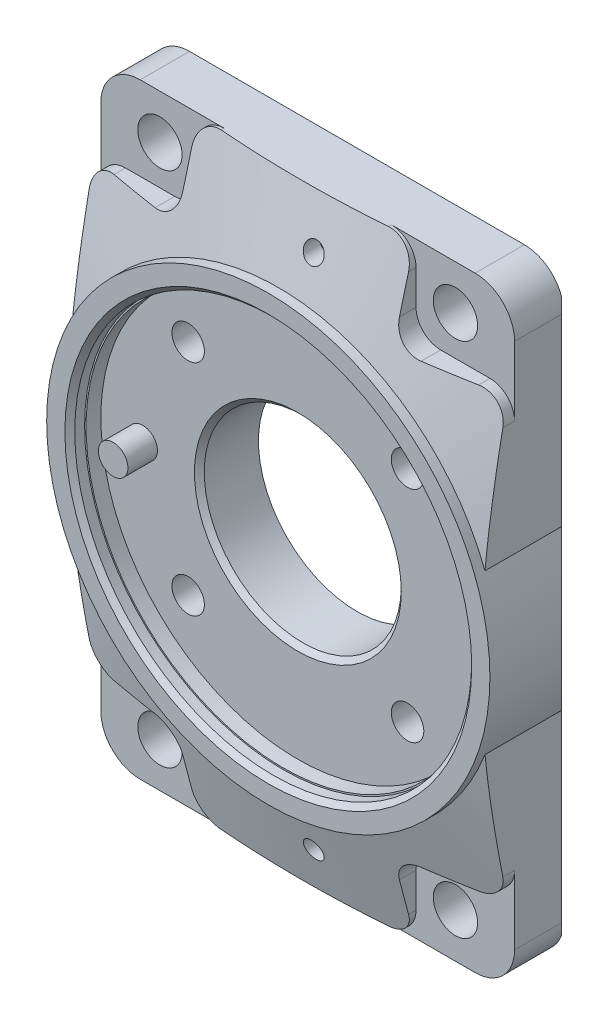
ISO-10303-21;
HEADER;
FILE_DESCRIPTION(('STEP AP214'),'2;1');
FILE_NAME('part.step','',(''),(''),'','','');
FILE_SCHEMA(('AUTOMOTIVE_DESIGN { 1 0 10303 214 1 1 1 1 }'));
ENDSEC;
DATA;
#1=APPLICATION_CONTEXT('core data for automotive mechanical design processes');
#2=APPLICATION_PROTOCOL_DEFINITION('international standard','automotive_design',2000,#1);
#3=PRODUCT_CONTEXT('',#1,'mechanical');
#4=PRODUCT('Part','Part','',(#3));
#5=PRODUCT_RELATED_PRODUCT_CATEGORY('part','',(#4));
#6=PRODUCT_DEFINITION_FORMATION('','',#4);
#7=PRODUCT_DEFINITION_CONTEXT('part definition',#1,'design');
#8=PRODUCT_DEFINITION('design','',#6,#7);
#9=PRODUCT_DEFINITION_SHAPE('','',#8);
#10=(LENGTH_UNIT() NAMED_UNIT(*) SI_UNIT(.MILLI.,.METRE.));
#11=(NAMED_UNIT(*) PLANE_ANGLE_UNIT() SI_UNIT($,.RADIAN.));
#12=(NAMED_UNIT(*) SI_UNIT($,.STERADIAN.) SOLID_ANGLE_UNIT());
#13=UNCERTAINTY_MEASURE_WITH_UNIT(LENGTH_MEASURE(1.E-05),#10,'distance_accuracy_value','');
#14=(GEOMETRIC_REPRESENTATION_CONTEXT(3) GLOBAL_UNCERTAINTY_ASSIGNED_CONTEXT((#13)) GLOBAL_UNIT_ASSIGNED_CONTEXT((#10,
#11,#12)) REPRESENTATION_CONTEXT('',''));
#15=CARTESIAN_POINT('',(0.,0.,0.));
#16=DIRECTION('',(0.,0.,1.));
#17=DIRECTION('',(1.,0.,0.));
#18=AXIS2_PLACEMENT_3D('',#15,#16,#17);
#19=CARTESIAN_POINT('',(52.,-17.9164728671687,-1.81557029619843E-13));
#20=DIRECTION('',(0.,0.,1.));
#21=DIRECTION('',(1.,0.,0.));
#22=AXIS2_PLACEMENT_3D('',#19,#20,#21);
#23=PLANE('',#22);
#24=DIRECTION('',(0.,1.,0.));
#25=VECTOR('',#24,1.);
#26=CARTESIAN_POINT('',(-41.5,-17.9164728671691,1.4489647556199E-13));
#27=LINE('',#26,#25);
#28=CARTESIAN_POINT('',(-41.5,56.2838821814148,1.4489647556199E-13));
#29=VERTEX_POINT('',#28);
#30=CARTESIAN_POINT('',(-41.5,-56.2838821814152,1.44462794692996E-13));
#31=VERTEX_POINT('',#30);
#32=EDGE_CURVE('E263',#29,#31,#27,.F.);
#33=ORIENTED_EDGE('',*,*,#32,.F.);
#34=CARTESIAN_POINT('',(-34.,53.5,1.18710365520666E-13));
#35=DIRECTION('',(0.,0.,-1.));
#36=DIRECTION('',(-1.,0.,0.));
#37=AXIS2_PLACEMENT_3D('',#34,#35,#36);
#38=CIRCLE('',#37,8.);
#39=CARTESIAN_POINT('',(-34.,61.5,1.18710365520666E-13));
#40=VERTEX_POINT('',#39);
#41=EDGE_CURVE('E292',#29,#40,#38,.T.);
#42=ORIENTED_EDGE('',*,*,#41,.T.);
#43=DIRECTION('',(1.,0.,0.));
#44=VECTOR('',#43,1.);
#45=CARTESIAN_POINT('',(-34.,61.5,1.18710365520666E-13));
#46=LINE('',#45,#44);
#47=CARTESIAN_POINT('',(34.,61.5,-1.18710365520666E-13));
#48=VERTEX_POINT('',#47);
#49=EDGE_CURVE('E295',#40,#48,#46,.T.);
#50=ORIENTED_EDGE('',*,*,#49,.T.);
#51=CARTESIAN_POINT('',(34.,53.5,-1.18710365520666E-13));
#52=DIRECTION('',(0.,0.,-1.));
#53=DIRECTION('',(-1.,0.,0.));
#54=AXIS2_PLACEMENT_3D('',#51,#52,#53);
#55=CIRCLE('',#54,8.);
#56=CARTESIAN_POINT('',(41.5,56.2838821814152,-1.44029113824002E-13));
#57=VERTEX_POINT('',#56);
#58=EDGE_CURVE('E302',#48,#57,#55,.T.);
#59=ORIENTED_EDGE('',*,*,#58,.T.);
#60=DIRECTION('',(0.,1.,0.));
#61=VECTOR('',#60,1.);
#62=CARTESIAN_POINT('',(41.5,-17.9164728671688,-1.4489647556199E-13));
#63=LINE('',#62,#61);
#64=CARTESIAN_POINT('',(41.5,-56.2838821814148,-1.4489647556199E-13));
#65=VERTEX_POINT('',#64);
#66=EDGE_CURVE('E274',#65,#57,#63,.T.);
#67=ORIENTED_EDGE('',*,*,#66,.F.);
#68=CARTESIAN_POINT('',(34.,-53.5,-1.18710365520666E-13));
#69=DIRECTION('',(0.,0.,-1.));
#70=DIRECTION('',(-1.,0.,0.));
#71=AXIS2_PLACEMENT_3D('',#68,#69,#70);
#72=CIRCLE('',#71,8.);
#73=CARTESIAN_POINT('',(34.,-61.5,-1.18710365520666E-13));
#74=VERTEX_POINT('',#73);
#75=EDGE_CURVE('E293',#65,#74,#72,.T.);
#76=ORIENTED_EDGE('',*,*,#75,.T.);
#77=DIRECTION('',(-1.,0.,0.));
#78=VECTOR('',#77,1.);
#79=CARTESIAN_POINT('',(34.,-61.5,-1.18710365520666E-13));
#80=LINE('',#79,#78);
#81=CARTESIAN_POINT('',(-34.,-61.5,1.18710365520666E-13));
#82=VERTEX_POINT('',#81);
#83=EDGE_CURVE('E291',#74,#82,#80,.T.);
#84=ORIENTED_EDGE('',*,*,#83,.T.);
#85=CARTESIAN_POINT('',(-34.,-53.5,1.18710365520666E-13));
#86=DIRECTION('',(0.,0.,-1.));
#87=DIRECTION('',(-1.,0.,0.));
#88=AXIS2_PLACEMENT_3D('',#85,#86,#87);
#89=CIRCLE('',#88,8.);
#90=EDGE_CURVE('E281',#82,#31,#89,.T.);
#91=ORIENTED_EDGE('',*,*,#90,.T.);
#92=EDGE_LOOP('',(#33,#42,#50,#59,#67,#76,#84,#91));
#93=FACE_BOUND('',#92,.T.);
#94=CARTESIAN_POINT('',(5.00000000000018,-52.5,0.));
#95=DIRECTION('',(0.,0.,-1.));
#96=DIRECTION('',(-1.,0.,0.));
#97=AXIS2_PLACEMENT_3D('',#94,#95,#96);
#98=CIRCLE('',#97,3.);
#99=CARTESIAN_POINT('',(2.00000000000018,-52.5,0.));
#100=VERTEX_POINT('',#99);
#101=EDGE_CURVE('E311',#100,#100,#98,.T.);
#102=ORIENTED_EDGE('',*,*,#101,.F.);
#103=EDGE_LOOP('',(#102));
#104=FACE_BOUND('',#103,.T.);
#105=CARTESIAN_POINT('',(-31.5,-1.09981662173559E-13,1.09981662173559E-13));
#106=DIRECTION('',(0.,0.,1.));
#107=DIRECTION('',(1.,0.,0.));
#108=AXIS2_PLACEMENT_3D('',#105,#106,#107);
#109=CIRCLE('',#108,2.);
#110=CARTESIAN_POINT('',(-29.5,-1.02998699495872E-13,1.02998699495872E-13));
#111=VERTEX_POINT('',#110);
#112=EDGE_CURVE('E539',#111,#111,#109,.F.);
#113=ORIENTED_EDGE('',*,*,#112,.F.);
#114=EDGE_LOOP('',(#113));
#115=FACE_BOUND('',#114,.T.);
#116=CARTESIAN_POINT('',(22.2738636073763,-22.2738636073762,0.));
#117=DIRECTION('',(0.,0.,-1.));
#118=DIRECTION('',(-1.,0.,0.));
#119=AXIS2_PLACEMENT_3D('',#116,#117,#118);
#120=CIRCLE('',#119,5.5);
#121=CARTESIAN_POINT('',(16.7738636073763,-22.2738636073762,0.));
#122=VERTEX_POINT('',#121);
#123=EDGE_CURVE('E536',#122,#122,#120,.T.);
#124=ORIENTED_EDGE('',*,*,#123,.F.);
#125=EDGE_LOOP('',(#124));
#126=FACE_BOUND('',#125,.T.);
#127=CARTESIAN_POINT('',(22.2738636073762,22.2738636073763,0.));
#128=DIRECTION('',(0.,0.,-1.));
#129=DIRECTION('',(-1.,0.,0.));
#130=AXIS2_PLACEMENT_3D('',#127,#128,#129);
#131=CIRCLE('',#130,5.5);
#132=CARTESIAN_POINT('',(16.7738636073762,22.2738636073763,0.));
#133=VERTEX_POINT('',#132);
#134=EDGE_CURVE('E533',#133,#133,#131,.T.);
#135=ORIENTED_EDGE('',*,*,#134,.F.);
#136=EDGE_LOOP('',(#135));
#137=FACE_BOUND('',#136,.T.);
#138=CARTESIAN_POINT('',(-22.2738636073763,22.2738636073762,0.));
#139=DIRECTION('',(0.,0.,-1.));
#140=DIRECTION('',(-1.,0.,0.));
#141=AXIS2_PLACEMENT_3D('',#138,#139,#140);
#142=CIRCLE('',#141,5.5);
#143=CARTESIAN_POINT('',(-27.7738636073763,22.2738636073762,0.));
#144=VERTEX_POINT('',#143);
#145=EDGE_CURVE('E530',#144,#144,#142,.T.);
#146=ORIENTED_EDGE('',*,*,#145,.F.);
#147=EDGE_LOOP('',(#146));
#148=FACE_BOUND('',#147,.T.);
#149=CARTESIAN_POINT('',(-22.2738636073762,-22.2738636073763,0.));
#150=DIRECTION('',(0.,0.,-1.));
#151=DIRECTION('',(-1.,0.,0.));
#152=AXIS2_PLACEMENT_3D('',#149,#150,#151);
#153=CIRCLE('',#152,5.5);
#154=CARTESIAN_POINT('',(-27.7738636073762,-22.2738636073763,0.));
#155=VERTEX_POINT('',#154);
#156=EDGE_CURVE('E527',#155,#155,#153,.T.);
#157=ORIENTED_EDGE('',*,*,#156,.F.);
#158=EDGE_LOOP('',(#157));
#159=FACE_BOUND('',#158,.T.);
#160=CARTESIAN_POINT('',(4.99999999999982,52.5,0.));
#161=DIRECTION('',(0.,0.,-1.));
#162=DIRECTION('',(-1.,0.,0.));
#163=AXIS2_PLACEMENT_3D('',#160,#161,#162);
#164=CIRCLE('',#163,3.);
#165=CARTESIAN_POINT('',(1.99999999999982,52.5,0.));
#166=VERTEX_POINT('',#165);
#167=EDGE_CURVE('E524',#166,#166,#164,.T.);
#168=ORIENTED_EDGE('',*,*,#167,.F.);
#169=EDGE_LOOP('',(#168));
#170=FACE_BOUND('',#169,.T.);
#171=CARTESIAN_POINT('',(-30.,52.5,1.03009716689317E-13));
#172=DIRECTION('',(0.,0.,1.));
#173=DIRECTION('',(1.,0.,0.));
#174=AXIS2_PLACEMENT_3D('',#171,#172,#173);
#175=CIRCLE('',#174,4.5);
#176=CARTESIAN_POINT('',(-25.5,52.5,0.));
#177=VERTEX_POINT('',#176);
#178=EDGE_CURVE('E521',#177,#177,#175,.F.);
#179=ORIENTED_EDGE('',*,*,#178,.F.);
#180=EDGE_LOOP('',(#179));
#181=FACE_BOUND('',#180,.T.);
#182=CARTESIAN_POINT('',(30.,52.5,-1.06479163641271E-13));
#183=DIRECTION('',(0.,0.,1.));
#184=DIRECTION('',(1.,0.,0.));
#185=AXIS2_PLACEMENT_3D('',#182,#183,#184);
#186=CIRCLE('',#185,4.5);
#187=CARTESIAN_POINT('',(34.5,52.5,-1.22190829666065E-13));
#188=VERTEX_POINT('',#187);
#189=EDGE_CURVE('E518',#188,#188,#186,.F.);
#190=ORIENTED_EDGE('',*,*,#189,.F.);
#191=EDGE_LOOP('',(#190));
#192=FACE_BOUND('',#191,.T.);
#193=CARTESIAN_POINT('',(30.,-52.5,-1.06479163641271E-13));
#194=DIRECTION('',(0.,0.,1.));
#195=DIRECTION('',(1.,0.,0.));
#196=AXIS2_PLACEMENT_3D('',#193,#194,#195);
#197=CIRCLE('',#196,4.5);
#198=CARTESIAN_POINT('',(34.5,-52.5,-1.22190829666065E-13));
#199=VERTEX_POINT('',#198);
#200=EDGE_CURVE('E515',#199,#199,#197,.F.);
#201=ORIENTED_EDGE('',*,*,#200,.F.);
#202=EDGE_LOOP('',(#201));
#203=FACE_BOUND('',#202,.T.);
#204=CARTESIAN_POINT('',(-30.,-52.5,1.03009716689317E-13));
#205=DIRECTION('',(0.,0.,1.));
#206=DIRECTION('',(1.,0.,0.));
#207=AXIS2_PLACEMENT_3D('',#204,#205,#206);
#208=CIRCLE('',#207,4.5);
#209=CARTESIAN_POINT('',(-25.5,-52.5,0.));
#210=VERTEX_POINT('',#209);
#211=EDGE_CURVE('E275',#210,#210,#208,.F.);
#212=ORIENTED_EDGE('',*,*,#211,.F.);
#213=EDGE_LOOP('',(#212));
#214=FACE_BOUND('',#213,.T.);
#215=CARTESIAN_POINT('',(0.,0.,0.));
#216=DIRECTION('',(0.,0.,1.));
#217=DIRECTION('',(1.,0.,0.));
#218=AXIS2_PLACEMENT_3D('',#215,#216,#217);
#219=CIRCLE('',#218,20.);
#220=CARTESIAN_POINT('',(20.,0.,0.));
#221=VERTEX_POINT('',#220);
#222=EDGE_CURVE('E11',#221,#221,#219,.T.);
#223=ORIENTED_EDGE('',*,*,#222,.T.);
#224=EDGE_LOOP('',(#223));
#225=FACE_BOUND('',#224,.T.);
#226=ADVANCED_FACE('F17',(#93,#104,#115,#126,#137,#148,#159,#170,#181,#192,#203,#214,#225),#23,.F.);
#227=CARTESIAN_POINT('',(-34.,53.5,18.));
#228=DIRECTION('',(0.,0.,-1.));
#229=DIRECTION('',(-1.,0.,0.));
#230=AXIS2_PLACEMENT_3D('',#227,#228,#229);
#231=CYLINDRICAL_SURFACE('',#230,8.);
#232=ORIENTED_EDGE('',*,*,#41,.F.);
#233=CARTESIAN_POINT('',(-34.,53.5,-7.49999999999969));
#234=DIRECTION('',(-0.707106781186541,0.,-0.707106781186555));
#235=DIRECTION('',(0.707106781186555,0.,-0.707106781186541));
#236=AXIS2_PLACEMENT_3D('',#233,#234,#235);
#237=ELLIPSE('',#236,11.3137084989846,8.);
#238=CARTESIAN_POINT('',(-42.,53.5,0.500000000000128));
#239=VERTEX_POINT('',#238);
#240=EDGE_CURVE('E270',#29,#239,#237,.F.);
#241=ORIENTED_EDGE('',*,*,#240,.T.);
#242=DIRECTION('',(0.,0.,1.));
#243=VECTOR('',#242,1.);
#244=CARTESIAN_POINT('',(-42.,53.5,18.));
#245=LINE('',#244,#243);
#246=CARTESIAN_POINT('',(-42.,53.5,10.0000000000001));
#247=VERTEX_POINT('',#246);
#248=EDGE_CURVE('E379',#239,#247,#245,.T.);
#249=ORIENTED_EDGE('',*,*,#248,.T.);
#250=CARTESIAN_POINT('',(-34.,53.5,10.0000000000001));
#251=DIRECTION('',(0.,0.,-1.));
#252=DIRECTION('',(-1.,0.,0.));
#253=AXIS2_PLACEMENT_3D('',#250,#251,#252);
#254=CIRCLE('',#253,8.);
#255=CARTESIAN_POINT('',(-34.,61.5,10.0000000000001));
#256=VERTEX_POINT('',#255);
#257=EDGE_CURVE('E382',#247,#256,#254,.T.);
#258=ORIENTED_EDGE('',*,*,#257,.T.);
#259=DIRECTION('',(0.,0.,-1.));
#260=VECTOR('',#259,1.);
#261=CARTESIAN_POINT('',(-34.,61.5,18.));
#262=LINE('',#261,#260);
#263=EDGE_CURVE('E385',#256,#40,#262,.T.);
#264=ORIENTED_EDGE('',*,*,#263,.T.);
#265=EDGE_LOOP('',(#232,#241,#249,#258,#264));
#266=FACE_BOUND('',#265,.T.);
#267=ADVANCED_FACE('F896',(#266),#231,.T.);
#268=CARTESIAN_POINT('',(-34.,-53.5,18.));
#269=DIRECTION('',(0.,0.,-1.));
#270=DIRECTION('',(-1.,0.,0.));
#271=AXIS2_PLACEMENT_3D('',#268,#269,#270);
#272=CYLINDRICAL_SURFACE('',#271,8.);
#273=DIRECTION('',(0.,0.,-1.));
#274=VECTOR('',#273,1.);
#275=CARTESIAN_POINT('',(-42.,-53.5,18.));
#276=LINE('',#275,#274);
#277=CARTESIAN_POINT('',(-42.,-53.5,10.0000000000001));
#278=VERTEX_POINT('',#277);
#279=CARTESIAN_POINT('',(-42.,-53.5,0.500000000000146));
#280=VERTEX_POINT('',#279);
#281=EDGE_CURVE('E285',#278,#280,#276,.T.);
#282=ORIENTED_EDGE('',*,*,#281,.T.);
#283=CARTESIAN_POINT('',(-34.,-53.5,-7.49999999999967));
#284=DIRECTION('',(-0.707106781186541,0.,-0.707106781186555));
#285=DIRECTION('',(0.707106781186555,0.,-0.707106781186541));
#286=AXIS2_PLACEMENT_3D('',#283,#284,#285);
#287=ELLIPSE('',#286,11.3137084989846,8.);
#288=EDGE_CURVE('E267',#280,#31,#287,.F.);
#289=ORIENTED_EDGE('',*,*,#288,.T.);
#290=ORIENTED_EDGE('',*,*,#90,.F.);
#291=DIRECTION('',(0.,0.,1.));
#292=VECTOR('',#291,1.);
#293=CARTESIAN_POINT('',(-34.,-61.5,18.));
#294=LINE('',#293,#292);
#295=CARTESIAN_POINT('',(-34.,-61.5,10.0000000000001));
#296=VERTEX_POINT('',#295);
#297=EDGE_CURVE('E361',#82,#296,#294,.T.);
#298=ORIENTED_EDGE('',*,*,#297,.T.);
#299=CARTESIAN_POINT('',(-34.,-53.5,10.0000000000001));
#300=DIRECTION('',(0.,0.,-1.));
#301=DIRECTION('',(-1.,0.,0.));
#302=AXIS2_PLACEMENT_3D('',#299,#300,#301);
#303=CIRCLE('',#302,8.);
#304=EDGE_CURVE('E364',#296,#278,#303,.T.);
#305=ORIENTED_EDGE('',*,*,#304,.T.);
#306=EDGE_LOOP('',(#282,#289,#290,#298,#305));
#307=FACE_BOUND('',#306,.T.);
#308=ADVANCED_FACE('F279',(#307),#272,.T.);
#309=CARTESIAN_POINT('',(34.,-53.5,18.));
#310=DIRECTION('',(0.,0.,-1.));
#311=DIRECTION('',(-1.,0.,0.));
#312=AXIS2_PLACEMENT_3D('',#309,#310,#311);
#313=CYLINDRICAL_SURFACE('',#312,8.);
#314=ORIENTED_EDGE('',*,*,#75,.F.);
#315=CARTESIAN_POINT('',(34.,-53.5,-7.50000000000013));
#316=DIRECTION('',(0.707106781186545,0.,-0.70710678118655));
#317=DIRECTION('',(-0.70710678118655,0.,-0.707106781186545));
#318=AXIS2_PLACEMENT_3D('',#315,#316,#317);
#319=ELLIPSE('',#318,11.3137084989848,8.);
#320=CARTESIAN_POINT('',(42.,-53.5,0.499999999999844));
#321=VERTEX_POINT('',#320);
#322=EDGE_CURVE('E978',#65,#321,#319,.F.);
#323=ORIENTED_EDGE('',*,*,#322,.T.);
#324=DIRECTION('',(0.,0.,1.));
#325=VECTOR('',#324,1.);
#326=CARTESIAN_POINT('',(42.,-53.5,18.));
#327=LINE('',#326,#325);
#328=CARTESIAN_POINT('',(42.,-53.5,9.99999999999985));
#329=VERTEX_POINT('',#328);
#330=EDGE_CURVE('E349',#321,#329,#327,.T.);
#331=ORIENTED_EDGE('',*,*,#330,.T.);
#332=CARTESIAN_POINT('',(34.,-53.5,9.99999999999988));
#333=DIRECTION('',(0.,0.,-1.));
#334=DIRECTION('',(-1.,0.,0.));
#335=AXIS2_PLACEMENT_3D('',#332,#333,#334);
#336=CIRCLE('',#335,8.);
#337=CARTESIAN_POINT('',(34.,-61.5,9.99999999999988));
#338=VERTEX_POINT('',#337);
#339=EDGE_CURVE('E352',#329,#338,#336,.T.);
#340=ORIENTED_EDGE('',*,*,#339,.T.);
#341=DIRECTION('',(0.,0.,-1.));
#342=VECTOR('',#341,1.);
#343=CARTESIAN_POINT('',(34.,-61.5,18.));
#344=LINE('',#343,#342);
#345=EDGE_CURVE('E355',#338,#74,#344,.T.);
#346=ORIENTED_EDGE('',*,*,#345,.T.);
#347=EDGE_LOOP('',(#314,#323,#331,#340,#346));
#348=FACE_BOUND('',#347,.T.);
#349=ADVANCED_FACE('F953',(#348),#313,.T.);
#350=CARTESIAN_POINT('',(34.,53.5,18.));
#351=DIRECTION('',(0.,0.,-1.));
#352=DIRECTION('',(-1.,0.,0.));
#353=AXIS2_PLACEMENT_3D('',#350,#351,#352);
#354=CYLINDRICAL_SURFACE('',#353,8.);
#355=DIRECTION('',(0.,0.,-1.));
#356=VECTOR('',#355,1.);
#357=CARTESIAN_POINT('',(42.,53.5,18.));
#358=LINE('',#357,#356);
#359=CARTESIAN_POINT('',(42.,53.5,9.99999999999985));
#360=VERTEX_POINT('',#359);
#361=CARTESIAN_POINT('',(42.,53.5,0.499999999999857));
#362=VERTEX_POINT('',#361);
#363=EDGE_CURVE('E333',#360,#362,#358,.T.);
#364=ORIENTED_EDGE('',*,*,#363,.T.);
#365=CARTESIAN_POINT('',(34.,53.5,-7.50000000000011));
#366=DIRECTION('',(0.707106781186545,0.,-0.70710678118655));
#367=DIRECTION('',(-0.70710678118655,0.,-0.707106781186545));
#368=AXIS2_PLACEMENT_3D('',#365,#366,#367);
#369=ELLIPSE('',#368,11.3137084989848,8.);
#370=EDGE_CURVE('E968',#362,#57,#369,.F.);
#371=ORIENTED_EDGE('',*,*,#370,.T.);
#372=ORIENTED_EDGE('',*,*,#58,.F.);
#373=DIRECTION('',(0.,0.,-1.));
#374=VECTOR('',#373,1.);
#375=CARTESIAN_POINT('',(34.,61.5,18.));
#376=LINE('',#375,#374);
#377=CARTESIAN_POINT('',(34.,61.5,9.99999999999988));
#378=VERTEX_POINT('',#377);
#379=EDGE_CURVE('E329',#48,#378,#376,.F.);
#380=ORIENTED_EDGE('',*,*,#379,.T.);
#381=CARTESIAN_POINT('',(34.,53.5,9.99999999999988));
#382=DIRECTION('',(0.,0.,-1.));
#383=DIRECTION('',(-1.,0.,0.));
#384=AXIS2_PLACEMENT_3D('',#381,#382,#383);
#385=CIRCLE('',#384,8.);
#386=EDGE_CURVE('E332',#378,#360,#385,.T.);
#387=ORIENTED_EDGE('',*,*,#386,.T.);
#388=EDGE_LOOP('',(#364,#371,#372,#380,#387));
#389=FACE_BOUND('',#388,.T.);
#390=ADVANCED_FACE('F951',(#389),#354,.T.);
#391=CARTESIAN_POINT('',(0.,0.,12.));
#392=DIRECTION('',(0.,0.,1.));
#393=DIRECTION('',(1.,0.,0.));
#394=AXIS2_PLACEMENT_3D('',#391,#392,#393);
#395=CYLINDRICAL_SURFACE('',#394,40.);
#396=CARTESIAN_POINT('',(0.,0.,15.));
#397=DIRECTION('',(0.,0.,1.));
#398=DIRECTION('',(1.,0.,0.));
#399=AXIS2_PLACEMENT_3D('',#396,#397,#398);
#400=CIRCLE('',#399,40.);
#401=CARTESIAN_POINT('',(40.0000000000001,1.39659253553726E-13,14.9999999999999));
#402=VERTEX_POINT('',#401);
#403=EDGE_CURVE('E305',#402,#402,#400,.F.);
#404=ORIENTED_EDGE('',*,*,#403,.F.);
#405=EDGE_LOOP('',(#404));
#406=FACE_BOUND('',#405,.T.);
#407=CARTESIAN_POINT('',(0.,0.,12.));
#408=DIRECTION('',(0.,0.,1.));
#409=DIRECTION('',(1.,0.,0.));
#410=AXIS2_PLACEMENT_3D('',#407,#408,#409);
#411=CIRCLE('',#410,40.);
#412=CARTESIAN_POINT('',(40.,1.39659253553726E-13,11.9999999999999));
#413=VERTEX_POINT('',#412);
#414=EDGE_CURVE('E25',#413,#413,#411,.F.);
#415=ORIENTED_EDGE('',*,*,#414,.T.);
#416=EDGE_LOOP('',(#415));
#417=FACE_BOUND('',#416,.T.);
#418=ADVANCED_FACE('F913',(#406,#417),#395,.F.);
#419=CARTESIAN_POINT('',(0.,0.,15.));
#420=DIRECTION('',(0.,0.,1.));
#421=DIRECTION('',(1.,0.,0.));
#422=AXIS2_PLACEMENT_3D('',#419,#420,#421);
#423=PLANE('',#422);
#424=CARTESIAN_POINT('',(0.,0.,15.));
#425=DIRECTION('',(0.,0.,1.));
#426=DIRECTION('',(1.,0.,0.));
#427=AXIS2_PLACEMENT_3D('',#424,#425,#426);
#428=CIRCLE('',#427,40.3);
#429=CARTESIAN_POINT('',(40.3000000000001,1.40706697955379E-13,14.9999999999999));
#430=VERTEX_POINT('',#429);
#431=EDGE_CURVE('E512',#430,#430,#428,.T.);
#432=ORIENTED_EDGE('',*,*,#431,.T.);
#433=EDGE_LOOP('',(#432));
#434=FACE_BOUND('',#433,.T.);
#435=ORIENTED_EDGE('',*,*,#403,.T.);
#436=EDGE_LOOP('',(#435));
#437=FACE_BOUND('',#436,.T.);
#438=ADVANCED_FACE('F960',(#434,#437),#423,.T.);
#439=CARTESIAN_POINT('',(0.,0.,15.));
#440=DIRECTION('',(0.,0.,1.));
#441=DIRECTION('',(1.,0.,0.));
#442=AXIS2_PLACEMENT_3D('',#439,#440,#441);
#443=CYLINDRICAL_SURFACE('',#442,40.3);
#444=ORIENTED_EDGE('',*,*,#431,.F.);
#445=EDGE_LOOP('',(#444));
#446=FACE_BOUND('',#445,.T.);
#447=CARTESIAN_POINT('',(0.,0.,17.));
#448=DIRECTION('',(0.,0.,1.));
#449=DIRECTION('',(1.,0.,0.));
#450=AXIS2_PLACEMENT_3D('',#447,#448,#449);
#451=CIRCLE('',#450,40.3);
#452=CARTESIAN_POINT('',(40.3000000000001,1.40706697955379E-13,16.9999999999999));
#453=VERTEX_POINT('',#452);
#454=EDGE_CURVE('E508',#453,#453,#451,.T.);
#455=ORIENTED_EDGE('',*,*,#454,.T.);
#456=EDGE_LOOP('',(#455));
#457=FACE_BOUND('',#456,.T.);
#458=ADVANCED_FACE('F1048',(#446,#457),#443,.F.);
#459=CARTESIAN_POINT('',(0.,0.,12.));
#460=DIRECTION('',(0.,0.,1.));
#461=DIRECTION('',(1.,0.,0.));
#462=AXIS2_PLACEMENT_3D('',#459,#460,#461);
#463=PLANE('',#462);
#464=ORIENTED_EDGE('',*,*,#414,.F.);
#465=EDGE_LOOP('',(#464));
#466=FACE_BOUND('',#465,.T.);
#467=CARTESIAN_POINT('',(-31.5,-1.11022302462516E-13,12.));
#468=DIRECTION('',(0.,0.,1.));
#469=DIRECTION('',(1.,0.,0.));
#470=AXIS2_PLACEMENT_3D('',#467,#468,#469);
#471=CIRCLE('',#470,3.);
#472=CARTESIAN_POINT('',(-28.5,-1.11022302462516E-13,12.));
#473=VERTEX_POINT('',#472);
#474=EDGE_CURVE('E287',#473,#473,#471,.F.);
#475=ORIENTED_EDGE('',*,*,#474,.T.);
#476=EDGE_LOOP('',(#475));
#477=FACE_BOUND('',#476,.T.);
#478=CARTESIAN_POINT('',(-22.2738636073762,-22.2738636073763,12.));
#479=DIRECTION('',(0.,0.,-1.));
#480=DIRECTION('',(-1.,0.,0.));
#481=AXIS2_PLACEMENT_3D('',#478,#479,#480);
#482=CIRCLE('',#481,3.3);
#483=CARTESIAN_POINT('',(-25.5738636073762,-22.2738636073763,12.));
#484=VERTEX_POINT('',#483);
#485=EDGE_CURVE('E491',#484,#484,#482,.T.);
#486=ORIENTED_EDGE('',*,*,#485,.T.);
#487=EDGE_LOOP('',(#486));
#488=FACE_BOUND('',#487,.T.);
#489=CARTESIAN_POINT('',(22.2738636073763,-22.2738636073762,12.));
#490=DIRECTION('',(0.,0.,-1.));
#491=DIRECTION('',(-1.,0.,0.));
#492=AXIS2_PLACEMENT_3D('',#489,#490,#491);
#493=CIRCLE('',#492,3.3);
#494=CARTESIAN_POINT('',(18.9738636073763,-22.2738636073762,12.));
#495=VERTEX_POINT('',#494);
#496=EDGE_CURVE('E511',#495,#495,#493,.T.);
#497=ORIENTED_EDGE('',*,*,#496,.T.);
#498=EDGE_LOOP('',(#497));
#499=FACE_BOUND('',#498,.T.);
#500=CARTESIAN_POINT('',(-22.2738636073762,22.2738636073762,12.));
#501=DIRECTION('',(0.,0.,-1.));
#502=DIRECTION('',(-1.,0.,0.));
#503=AXIS2_PLACEMENT_3D('',#500,#501,#502);
#504=CIRCLE('',#503,3.3);
#505=CARTESIAN_POINT('',(-25.5738636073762,22.2738636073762,12.));
#506=VERTEX_POINT('',#505);
#507=EDGE_CURVE('E1080',#506,#506,#504,.T.);
#508=ORIENTED_EDGE('',*,*,#507,.T.);
#509=EDGE_LOOP('',(#508));
#510=FACE_BOUND('',#509,.T.);
#511=CARTESIAN_POINT('',(22.2738636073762,22.2738636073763,12.));
#512=DIRECTION('',(0.,0.,-1.));
#513=DIRECTION('',(-1.,0.,0.));
#514=AXIS2_PLACEMENT_3D('',#511,#512,#513);
#515=CIRCLE('',#514,3.3);
#516=CARTESIAN_POINT('',(18.9738636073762,22.2738636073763,12.));
#517=VERTEX_POINT('',#516);
#518=EDGE_CURVE('E1084',#517,#517,#515,.T.);
#519=ORIENTED_EDGE('',*,*,#518,.T.);
#520=EDGE_LOOP('',(#519));
#521=FACE_BOUND('',#520,.T.);
#522=CARTESIAN_POINT('',(0.,0.,12.));
#523=DIRECTION('',(0.,0.,1.));
#524=DIRECTION('',(1.,0.,0.));
#525=AXIS2_PLACEMENT_3D('',#522,#523,#524);
#526=CIRCLE('',#525,21.);
#527=CARTESIAN_POINT('',(21.,0.,11.9999999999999));
#528=VERTEX_POINT('',#527);
#529=EDGE_CURVE('E1087',#528,#528,#526,.F.);
#530=ORIENTED_EDGE('',*,*,#529,.T.);
#531=EDGE_LOOP('',(#530));
#532=FACE_BOUND('',#531,.T.);
#533=ADVANCED_FACE('F1055',(#466,#477,#488,#499,#510,#521,#532),#463,.T.);
#534=CARTESIAN_POINT('',(0.,0.,18.));
#535=DIRECTION('',(0.,0.,1.));
#536=DIRECTION('',(1.,0.,0.));
#537=AXIS2_PLACEMENT_3D('',#534,#535,#536);
#538=CONICAL_SURFACE('',#537,41.3,0.785398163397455);
#539=ORIENTED_EDGE('',*,*,#454,.F.);
#540=EDGE_LOOP('',(#539));
#541=FACE_BOUND('',#540,.T.);
#542=CARTESIAN_POINT('',(0.,0.,18.));
#543=DIRECTION('',(0.,0.,1.));
#544=DIRECTION('',(1.,0.,0.));
#545=AXIS2_PLACEMENT_3D('',#542,#543,#544);
#546=CIRCLE('',#545,41.3);
#547=CARTESIAN_POINT('',(41.3000000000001,1.44198179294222E-13,17.9999999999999));
#548=VERTEX_POINT('',#547);
#549=EDGE_CURVE('E1746',#548,#548,#546,.F.);
#550=ORIENTED_EDGE('',*,*,#549,.F.);
#551=EDGE_LOOP('',(#550));
#552=FACE_BOUND('',#551,.T.);
#553=ADVANCED_FACE('F757',(#541,#552),#538,.F.);
#554=CARTESIAN_POINT('',(5.00000000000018,-52.5,0.));
#555=DIRECTION('',(0.,0.,-1.));
#556=DIRECTION('',(-1.,0.,0.));
#557=AXIS2_PLACEMENT_3D('',#554,#555,#556);
#558=CYLINDRICAL_SURFACE('',#557,2.);
#559=CARTESIAN_POINT('',(7.00000000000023,-52.5,13.7161845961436));
#560=CARTESIAN_POINT('',(6.99999571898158,-52.6148440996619,13.6835426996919));
#561=CARTESIAN_POINT('',(6.99007488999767,-52.7299364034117,13.6512047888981));
#562=CARTESIAN_POINT('',(6.95044864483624,-52.9572858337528,13.5880590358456));
#563=CARTESIAN_POINT('',(6.9207025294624,-53.0695366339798,13.5572544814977));
#564=CARTESIAN_POINT('',(6.84194905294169,-53.2878332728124,13.4980744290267));
#565=CARTESIAN_POINT('',(6.79293538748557,-53.3938770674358,13.4696997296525));
#566=CARTESIAN_POINT('',(6.67677357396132,-53.596379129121,13.4162484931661));
#567=CARTESIAN_POINT('',(6.6096355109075,-53.6928426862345,13.3911701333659));
#568=CARTESIAN_POINT('',(6.46067717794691,-53.8709801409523,13.3456143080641));
#569=CARTESIAN_POINT('',(6.37923538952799,-53.9529462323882,13.3250432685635));
#570=CARTESIAN_POINT('',(6.20284221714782,-54.1020292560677,13.2884312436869));
#571=CARTESIAN_POINT('',(6.10789265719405,-54.1691481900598,13.2723896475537));
#572=CARTESIAN_POINT('',(5.91099093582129,-54.2839847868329,13.2458779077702));
#573=CARTESIAN_POINT('',(5.80942963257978,-54.3323302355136,13.2352230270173));
#574=CARTESIAN_POINT('',(5.59928929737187,-54.4113993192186,13.2189612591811));
#575=CARTESIAN_POINT('',(5.49071166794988,-54.4421264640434,13.2133533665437));
#576=CARTESIAN_POINT('',(5.27292404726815,-54.4843058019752,13.2074565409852));
#577=CARTESIAN_POINT('',(5.16381819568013,-54.496277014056,13.2070221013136));
#578=CARTESIAN_POINT('',(4.94521534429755,-54.5022366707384,13.2111091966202));
#579=CARTESIAN_POINT('',(4.83571837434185,-54.4962264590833,13.2156303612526));
#580=CARTESIAN_POINT('',(4.62032426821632,-54.4666148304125,13.2294290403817));
#581=CARTESIAN_POINT('',(4.5144056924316,-54.443151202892,13.2386691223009));
#582=CARTESIAN_POINT('',(4.30818032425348,-54.3796352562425,13.2616010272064));
#583=CARTESIAN_POINT('',(4.20787386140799,-54.3395819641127,13.2752931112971));
#584=CARTESIAN_POINT('',(4.01406365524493,-54.2435027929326,13.3069615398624));
#585=CARTESIAN_POINT('',(3.92068373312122,-54.187247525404,13.3249987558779));
#586=CARTESIAN_POINT('',(3.74477527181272,-54.0608162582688,13.3647248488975));
#587=CARTESIAN_POINT('',(3.66224728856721,-53.9906395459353,13.3864139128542));
#588=CARTESIAN_POINT('',(3.50760074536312,-53.8360636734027,13.4335832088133));
#589=CARTESIAN_POINT('',(3.43588730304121,-53.7512890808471,13.4591606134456));
#590=CARTESIAN_POINT('',(3.30769141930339,-53.5715799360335,13.5128952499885));
#591=CARTESIAN_POINT('',(3.25121868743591,-53.4766389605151,13.5410541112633));
#592=CARTESIAN_POINT('',(3.15300131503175,-53.2756118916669,13.6002811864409));
#593=CARTESIAN_POINT('',(3.1118765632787,-53.1692439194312,13.6314183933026));
#594=CARTESIAN_POINT('',(3.04835209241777,-52.9515397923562,13.694794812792));
#595=CARTESIAN_POINT('',(3.02591704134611,-52.8402134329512,13.7270318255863));
#596=CARTESIAN_POINT('',(3.00869209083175,-52.6901288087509,13.7702794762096));
#597=CARTESIAN_POINT('',(3.00543487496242,-52.6521815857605,13.7811962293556));
#598=CARTESIAN_POINT('',(3.00108811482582,-52.5761632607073,13.8030297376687));
#599=CARTESIAN_POINT('',(2.99999858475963,-52.5380921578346,13.8139464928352));
#600=CARTESIAN_POINT('',(3.00000428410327,-52.3846904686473,13.8578621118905));
#601=CARTESIAN_POINT('',(3.01000539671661,-52.2691880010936,13.8907647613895));
#602=CARTESIAN_POINT('',(3.04989964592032,-52.041136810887,13.9553837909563));
#603=CARTESIAN_POINT('',(3.07983426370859,-51.9285947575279,13.9870975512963));
#604=CARTESIAN_POINT('',(3.15903476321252,-51.7098275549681,14.0483499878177));
#605=CARTESIAN_POINT('',(3.20830517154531,-51.6036038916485,14.0778881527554));
#606=CARTESIAN_POINT('',(3.3250459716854,-51.4008145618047,14.1338013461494));
#607=CARTESIAN_POINT('',(3.39250625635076,-51.3042435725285,14.1601781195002));
#608=CARTESIAN_POINT('',(3.5422526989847,-51.1258723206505,14.2083070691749));
#609=CARTESIAN_POINT('',(3.62417285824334,-51.0437896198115,14.2301496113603));
#610=CARTESIAN_POINT('',(3.80164329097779,-50.8945805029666,14.2691241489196));
#611=CARTESIAN_POINT('',(3.89719135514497,-50.8274516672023,14.2862569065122));
#612=CARTESIAN_POINT('',(4.09499416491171,-50.7129669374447,14.3145305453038));
#613=CARTESIAN_POINT('',(4.1968153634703,-50.6649152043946,14.3258876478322));
#614=CARTESIAN_POINT('',(4.40747831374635,-50.5864845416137,14.3431814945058));
#615=CARTESIAN_POINT('',(4.51631838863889,-50.5561014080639,14.34911952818));
#616=CARTESIAN_POINT('',(4.73399948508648,-50.5147777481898,14.3552282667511));
#617=CARTESIAN_POINT('',(4.84271874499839,-50.5032209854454,14.3555852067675));
#618=CARTESIAN_POINT('',(5.06046972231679,-50.4979507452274,14.3509962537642));
#619=CARTESIAN_POINT('',(5.16950141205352,-50.5042357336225,14.3460508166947));
#620=CARTESIAN_POINT('',(5.38373357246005,-50.5342074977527,14.3311210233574));
#621=CARTESIAN_POINT('',(5.4889603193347,-50.5577311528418,14.3211841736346));
#622=CARTESIAN_POINT('',(5.69378793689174,-50.6211294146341,14.2966629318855));
#623=CARTESIAN_POINT('',(5.79338838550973,-50.6610052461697,14.282078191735));
#624=CARTESIAN_POINT('',(5.98616244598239,-50.7566487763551,14.2484594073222));
#625=CARTESIAN_POINT('',(6.07918390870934,-50.8126956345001,14.2293483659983));
#626=CARTESIAN_POINT('',(6.25442961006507,-50.9385741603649,14.1874688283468));
#627=CARTESIAN_POINT('',(6.33665302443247,-51.0084068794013,14.1647000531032));
#628=CARTESIAN_POINT('',(6.49119727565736,-51.1625865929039,14.1153145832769));
#629=CARTESIAN_POINT('',(6.5630468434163,-51.2473704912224,14.0885877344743));
#630=CARTESIAN_POINT('',(6.69151173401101,-51.427151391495,14.0327444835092));
#631=CARTESIAN_POINT('',(6.74811695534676,-51.5221551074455,14.0036265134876));
#632=CARTESIAN_POINT('',(6.84671895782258,-51.7236573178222,13.9426504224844));
#633=CARTESIAN_POINT('',(6.88805096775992,-51.8304615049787,13.9107295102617));
#634=CARTESIAN_POINT('',(6.95184374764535,-52.0491775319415,13.8461473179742));
#635=CARTESIAN_POINT('',(6.97434101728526,-52.1610790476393,13.8134875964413));
#636=CARTESIAN_POINT('',(6.99145314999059,-52.3114661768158,13.7700947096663));
#637=CARTESIAN_POINT('',(6.99465540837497,-52.3490874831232,13.7592804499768));
#638=CARTESIAN_POINT('',(6.99892955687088,-52.4244635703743,13.7376946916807));
#639=CARTESIAN_POINT('',(7.00000140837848,-52.4622183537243,13.7269231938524));
#640=CARTESIAN_POINT('',(7.00000000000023,-52.5,13.7161845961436));
#641=B_SPLINE_CURVE_WITH_KNOTS('',3,(#559,#560,#561,#562,#563,#564,#565,#566,#567,#568,#569,
#570,#571,#572,#573,#574,#575,#576,#577,#578,#579,#580,#581,#582,#583,#584,#585,#586,#587,#588,
#589,#590,#591,#592,#593,#594,#595,#596,#597,#598,#599,#600,#601,#602,#603,#604,#605,#606,#607,
#608,#609,#610,#611,#612,#613,#614,#615,#616,#617,#618,#619,#620,#621,#622,#623,#624,#625,#626,
#627,#628,#629,#630,#631,#632,#633,#634,#635,#636,#637,#638,#639,#640),.UNSPECIFIED.,.T.,.F.,(4,
2,2,2,2,2,2,2,2,2,2,2,2,2,2,2,2,2,2,2,2,2,2,2,2,2,2,2,2,2,2,2,2,2,2,2,2,2,2,2,4),(0.,
0.358032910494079,0.716803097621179,1.0756907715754,1.43437915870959,1.78471136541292,
2.13499631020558,2.47227640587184,2.80948928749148,3.13719467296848,3.46487556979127,
3.78999661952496,4.11513674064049,4.4451278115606,4.77513578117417,5.11544016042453,
5.45596083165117,5.80903821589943,6.16144660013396,6.28026424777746,6.39908267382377,
6.75876030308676,7.11918876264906,7.47970165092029,7.84001463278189,8.19225558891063,
8.54443950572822,8.88223341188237,9.21994691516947,9.54636628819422,9.87275759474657,
10.1960996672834,10.5194659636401,10.8487877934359,11.1781347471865,11.5195087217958,
11.8611083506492,12.2161907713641,12.5705834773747,12.6883677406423,12.8061541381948),.UNSPECIFIED.);
#642=CARTESIAN_POINT('',(7.00000000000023,-52.5,13.7161845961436));
#643=VERTEX_POINT('',#642);
#644=EDGE_CURVE('E434',#643,#643,#641,.T.);
#645=ORIENTED_EDGE('',*,*,#644,.F.);
#646=EDGE_LOOP('',(#645));
#647=FACE_BOUND('',#646,.T.);
#648=CARTESIAN_POINT('',(5.00000000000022,-52.5,10.6008606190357));
#649=DIRECTION('',(0.,0.,-1.));
#650=DIRECTION('',(-1.,0.,0.));
#651=AXIS2_PLACEMENT_3D('',#648,#649,#650);
#652=CIRCLE('',#651,2.00000000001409);
#653=CARTESIAN_POINT('',(2.99999999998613,-52.5,10.6008606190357));
#654=VERTEX_POINT('',#653);
#655=EDGE_CURVE('E505',#654,#654,#652,.T.);
#656=ORIENTED_EDGE('',*,*,#655,.T.);
#657=EDGE_LOOP('',(#656));
#658=FACE_BOUND('',#657,.T.);
#659=ADVANCED_FACE('F752',(#647,#658),#558,.F.);
#660=CARTESIAN_POINT('',(22.2738636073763,-22.2738636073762,0.));
#661=DIRECTION('',(0.,0.,-1.));
#662=DIRECTION('',(-1.,0.,0.));
#663=AXIS2_PLACEMENT_3D('',#660,#661,#662);
#664=CYLINDRICAL_SURFACE('',#663,3.3);
#665=ORIENTED_EDGE('',*,*,#496,.F.);
#666=EDGE_LOOP('',(#665));
#667=FACE_BOUND('',#666,.T.);
#668=CARTESIAN_POINT('',(22.2738636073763,-22.2738636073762,6.49999999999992));
#669=DIRECTION('',(0.,0.,-1.));
#670=DIRECTION('',(-1.,0.,0.));
#671=AXIS2_PLACEMENT_3D('',#668,#669,#670);
#672=CIRCLE('',#671,3.3);
#673=CARTESIAN_POINT('',(18.9738636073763,-22.2738636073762,6.49999999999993));
#674=VERTEX_POINT('',#673);
#675=EDGE_CURVE('E504',#674,#674,#672,.T.);
#676=ORIENTED_EDGE('',*,*,#675,.T.);
#677=EDGE_LOOP('',(#676));
#678=FACE_BOUND('',#677,.T.);
#679=ADVANCED_FACE('F748',(#667,#678),#664,.F.);
#680=CARTESIAN_POINT('',(22.2738636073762,22.2738636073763,0.));
#681=DIRECTION('',(0.,0.,-1.));
#682=DIRECTION('',(-1.,0.,0.));
#683=AXIS2_PLACEMENT_3D('',#680,#681,#682);
#684=CYLINDRICAL_SURFACE('',#683,3.3);
#685=ORIENTED_EDGE('',*,*,#518,.F.);
#686=EDGE_LOOP('',(#685));
#687=FACE_BOUND('',#686,.T.);
#688=CARTESIAN_POINT('',(22.2738636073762,22.2738636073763,6.49999999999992));
#689=DIRECTION('',(0.,0.,-1.));
#690=DIRECTION('',(-1.,0.,0.));
#691=AXIS2_PLACEMENT_3D('',#688,#689,#690);
#692=CIRCLE('',#691,3.3);
#693=CARTESIAN_POINT('',(18.9738636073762,22.2738636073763,6.49999999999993));
#694=VERTEX_POINT('',#693);
#695=EDGE_CURVE('E500',#694,#694,#692,.T.);
#696=ORIENTED_EDGE('',*,*,#695,.T.);
#697=EDGE_LOOP('',(#696));
#698=FACE_BOUND('',#697,.T.);
#699=ADVANCED_FACE('F744',(#687,#698),#684,.F.);
#700=CARTESIAN_POINT('',(0.,0.,12.));
#701=DIRECTION('',(0.,0.,1.));
#702=DIRECTION('',(1.,0.,0.));
#703=AXIS2_PLACEMENT_3D('',#700,#701,#702);
#704=CONICAL_SURFACE('',#703,21.,0.785398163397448);
#705=ORIENTED_EDGE('',*,*,#529,.F.);
#706=EDGE_LOOP('',(#705));
#707=FACE_BOUND('',#706,.T.);
#708=CARTESIAN_POINT('',(0.,0.,11.));
#709=DIRECTION('',(0.,0.,1.));
#710=DIRECTION('',(1.,0.,0.));
#711=AXIS2_PLACEMENT_3D('',#708,#709,#710);
#712=CIRCLE('',#711,20.);
#713=CARTESIAN_POINT('',(20.,0.,10.9999999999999));
#714=VERTEX_POINT('',#713);
#715=EDGE_CURVE('E496',#714,#714,#712,.F.);
#716=ORIENTED_EDGE('',*,*,#715,.T.);
#717=EDGE_LOOP('',(#716));
#718=FACE_BOUND('',#717,.T.);
#719=ADVANCED_FACE('F740',(#707,#718),#704,.F.);
#720=CARTESIAN_POINT('',(-22.2738636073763,22.2738636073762,0.));
#721=DIRECTION('',(0.,0.,-1.));
#722=DIRECTION('',(-1.,0.,0.));
#723=AXIS2_PLACEMENT_3D('',#720,#721,#722);
#724=CYLINDRICAL_SURFACE('',#723,3.3);
#725=ORIENTED_EDGE('',*,*,#507,.F.);
#726=EDGE_LOOP('',(#725));
#727=FACE_BOUND('',#726,.T.);
#728=CARTESIAN_POINT('',(-22.2738636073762,22.2738636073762,6.50000000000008));
#729=DIRECTION('',(0.,0.,-1.));
#730=DIRECTION('',(-1.,0.,0.));
#731=AXIS2_PLACEMENT_3D('',#728,#729,#730);
#732=CIRCLE('',#731,3.3);
#733=CARTESIAN_POINT('',(-25.5738636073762,22.2738636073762,6.50000000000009));
#734=VERTEX_POINT('',#733);
#735=EDGE_CURVE('E499',#734,#734,#732,.T.);
#736=ORIENTED_EDGE('',*,*,#735,.T.);
#737=EDGE_LOOP('',(#736));
#738=FACE_BOUND('',#737,.T.);
#739=ADVANCED_FACE('F736',(#727,#738),#724,.F.);
#740=CARTESIAN_POINT('',(-22.2738636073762,-22.2738636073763,0.));
#741=DIRECTION('',(0.,0.,-1.));
#742=DIRECTION('',(-1.,0.,0.));
#743=AXIS2_PLACEMENT_3D('',#740,#741,#742);
#744=CYLINDRICAL_SURFACE('',#743,3.3);
#745=ORIENTED_EDGE('',*,*,#485,.F.);
#746=EDGE_LOOP('',(#745));
#747=FACE_BOUND('',#746,.T.);
#748=CARTESIAN_POINT('',(-22.2738636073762,-22.2738636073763,6.50000000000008));
#749=DIRECTION('',(0.,0.,-1.));
#750=DIRECTION('',(-1.,0.,0.));
#751=AXIS2_PLACEMENT_3D('',#748,#749,#750);
#752=CIRCLE('',#751,3.3);
#753=CARTESIAN_POINT('',(-25.5738636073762,-22.2738636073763,6.50000000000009));
#754=VERTEX_POINT('',#753);
#755=EDGE_CURVE('E495',#754,#754,#752,.T.);
#756=ORIENTED_EDGE('',*,*,#755,.T.);
#757=EDGE_LOOP('',(#756));
#758=FACE_BOUND('',#757,.T.);
#759=ADVANCED_FACE('F732',(#747,#758),#744,.F.);
#760=CARTESIAN_POINT('',(4.99999999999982,52.5,0.));
#761=DIRECTION('',(0.,0.,-1.));
#762=DIRECTION('',(-1.,0.,0.));
#763=AXIS2_PLACEMENT_3D('',#760,#761,#762);
#764=CYLINDRICAL_SURFACE('',#763,2.);
#765=CARTESIAN_POINT('',(6.99999999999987,52.5,13.7161845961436));
#766=CARTESIAN_POINT('',(6.99999574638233,52.3836123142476,13.7492657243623));
#767=CARTESIAN_POINT('',(6.98980516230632,52.2671673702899,13.7827478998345));
#768=CARTESIAN_POINT('',(6.9493092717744,52.0375789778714,13.8495393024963));
#769=CARTESIAN_POINT('',(6.91895895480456,51.9244435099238,13.8828479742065));
#770=CARTESIAN_POINT('',(6.83887313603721,51.7049004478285,13.9482755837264));
#771=CARTESIAN_POINT('',(6.78914435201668,51.5984905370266,13.9803949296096));
#772=CARTESIAN_POINT('',(6.67153258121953,51.3955894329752,14.0424556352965));
#773=CARTESIAN_POINT('',(6.60365946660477,51.2990928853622,14.072398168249));
#774=CARTESIAN_POINT('',(6.45244320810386,51.1201632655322,14.1287762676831));
#775=CARTESIAN_POINT('',(6.36931208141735,51.0375640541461,14.1552522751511));
#776=CARTESIAN_POINT('',(6.18918868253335,50.8876881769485,14.2042219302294));
#777=CARTESIAN_POINT('',(6.09219787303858,50.8204098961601,14.2267159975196));
#778=CARTESIAN_POINT('',(5.89086483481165,50.7057621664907,14.2661291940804));
#779=CARTESIAN_POINT('',(5.78691845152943,50.6577574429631,14.2832213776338));
#780=CARTESIAN_POINT('',(5.57172083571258,50.5800491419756,14.312244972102));
#781=CARTESIAN_POINT('',(5.46047161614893,50.5503405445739,14.3241777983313));
#782=CARTESIAN_POINT('',(5.23861809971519,50.511221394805,14.3420273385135));
#783=CARTESIAN_POINT('',(5.12816612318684,50.5010461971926,14.3481656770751));
#784=CARTESIAN_POINT('',(4.90693802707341,50.4991078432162,14.3549906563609));
#785=CARTESIAN_POINT('',(4.79616196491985,50.5073416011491,14.3556782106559));
#786=CARTESIAN_POINT('',(4.58017569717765,50.5415760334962,14.3516242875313));
#787=CARTESIAN_POINT('',(4.47489587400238,50.5671548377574,14.347009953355));
#788=CARTESIAN_POINT('',(4.27014648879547,50.6348086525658,14.3327370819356));
#789=CARTESIAN_POINT('',(4.17067693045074,50.6768836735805,14.3230785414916));
#790=CARTESIAN_POINT('',(3.97983198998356,50.7763737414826,14.2990244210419));
#791=CARTESIAN_POINT('',(3.8884923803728,50.8338525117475,14.284609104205));
#792=CARTESIAN_POINT('',(3.71670046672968,50.9622594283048,14.2515614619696));
#793=CARTESIAN_POINT('',(3.63624848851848,51.0331879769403,14.2329290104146));
#794=CARTESIAN_POINT('',(3.48598643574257,51.1885972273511,14.1914697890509));
#795=CARTESIAN_POINT('',(3.41654629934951,51.2734073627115,14.1685383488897));
#796=CARTESIAN_POINT('',(3.29269574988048,51.4526286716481,14.1195713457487));
#797=CARTESIAN_POINT('',(3.2382951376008,51.5470460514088,14.0935337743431));
#798=CARTESIAN_POINT('',(3.14380028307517,51.7468512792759,14.038021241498));
#799=CARTESIAN_POINT('',(3.10437770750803,51.8525290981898,14.0084495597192));
#800=CARTESIAN_POINT('',(3.043919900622,52.068402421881,13.94768085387));
#801=CARTESIAN_POINT('',(3.02285012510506,52.1785890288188,13.9164870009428));
#802=CARTESIAN_POINT('',(3.00740453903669,52.3244863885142,13.8749753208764));
#803=CARTESIAN_POINT('',(3.00462905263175,52.3595381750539,13.8649865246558));
#804=CARTESIAN_POINT('',(3.00092615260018,52.4297231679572,13.8449550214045));
#805=CARTESIAN_POINT('',(2.99999872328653,52.4648563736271,13.8349123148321));
#806=CARTESIAN_POINT('',(3.00000421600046,52.6160523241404,13.7916282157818));
#807=CARTESIAN_POINT('',(3.01013571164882,52.7322182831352,13.7582070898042));
#808=CARTESIAN_POINT('',(3.05045849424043,52.9613825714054,13.6919410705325));
#809=CARTESIAN_POINT('',(3.08069388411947,53.0743733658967,13.6590976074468));
#810=CARTESIAN_POINT('',(3.16055673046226,53.2937651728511,13.5949546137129));
#811=CARTESIAN_POINT('',(3.21018128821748,53.4001671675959,13.5636548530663));
#812=CARTESIAN_POINT('',(3.32761501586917,53.6031165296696,13.5035147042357));
#813=CARTESIAN_POINT('',(3.39541408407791,53.6996693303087,13.4746729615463));
#814=CARTESIAN_POINT('',(3.54626589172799,53.878446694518,13.4207298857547));
#815=CARTESIAN_POINT('',(3.62905656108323,53.9608762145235,13.3955759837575));
#816=CARTESIAN_POINT('',(3.80839910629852,54.1105023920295,13.3492417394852));
#817=CARTESIAN_POINT('',(3.90494956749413,54.1777006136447,13.3280609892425));
#818=CARTESIAN_POINT('',(4.10541535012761,54.2923670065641,13.2910349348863));
#819=CARTESIAN_POINT('',(4.20894983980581,54.3404484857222,13.2750275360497));
#820=CARTESIAN_POINT('',(4.42325238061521,54.4184249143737,13.2478761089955));
#821=CARTESIAN_POINT('',(4.53401872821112,54.4483241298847,13.2367309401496));
#822=CARTESIAN_POINT('',(4.75548519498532,54.4880715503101,13.2199768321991));
#823=CARTESIAN_POINT('',(4.86605316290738,54.4985820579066,13.2141885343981));
#824=CARTESIAN_POINT('',(5.08754752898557,54.5011488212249,13.2076797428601));
#825=CARTESIAN_POINT('',(5.19847387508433,54.4932076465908,13.206958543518));
#826=CARTESIAN_POINT('',(5.41525916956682,54.4594289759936,13.2105705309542));
#827=CARTESIAN_POINT('',(5.52117471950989,54.4339426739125,13.2148056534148));
#828=CARTESIAN_POINT('',(5.72720461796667,54.3662611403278,13.2280347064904));
#829=CARTESIAN_POINT('',(5.82731898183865,54.3240659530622,13.237028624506));
#830=CARTESIAN_POINT('',(6.01933030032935,54.2241570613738,13.2595347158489));
#831=CARTESIAN_POINT('',(6.11119950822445,54.166393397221,13.2730614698));
#832=CARTESIAN_POINT('',(6.28397337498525,54.0372212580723,13.3042220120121));
#833=CARTESIAN_POINT('',(6.36487795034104,53.9658126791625,13.321855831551));
#834=CARTESIAN_POINT('',(6.5155496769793,53.809641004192,13.3611949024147));
#835=CARTESIAN_POINT('',(6.58500754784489,53.7246015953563,13.3829867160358));
#836=CARTESIAN_POINT('',(6.70883366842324,53.5448939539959,13.4297590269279));
#837=CARTESIAN_POINT('',(6.76319250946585,53.4502197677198,13.454741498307));
#838=CARTESIAN_POINT('',(6.85731110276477,53.2503593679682,13.5081726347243));
#839=CARTESIAN_POINT('',(6.89647258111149,53.144916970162,13.5367139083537));
#840=CARTESIAN_POINT('',(6.95649527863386,52.9296242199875,13.5956995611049));
#841=CARTESIAN_POINT('',(6.97739062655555,52.8197824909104,13.6261402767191));
#842=CARTESIAN_POINT('',(6.99268272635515,52.6744808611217,13.6668668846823));
#843=CARTESIAN_POINT('',(6.99542590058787,52.6396276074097,13.6766702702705));
#844=CARTESIAN_POINT('',(6.99908515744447,52.5698512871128,13.6963652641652));
#845=CARTESIAN_POINT('',(7.00000127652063,52.5349282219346,13.7062568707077));
#846=CARTESIAN_POINT('',(6.99999999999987,52.5,13.7161845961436));
#847=B_SPLINE_CURVE_WITH_KNOTS('',3,(#765,#766,#767,#768,#769,#770,#771,#772,#773,#774,#775,
#776,#777,#778,#779,#780,#781,#782,#783,#784,#785,#786,#787,#788,#789,#790,#791,#792,#793,#794,
#795,#796,#797,#798,#799,#800,#801,#802,#803,#804,#805,#806,#807,#808,#809,#810,#811,#812,#813,
#814,#815,#816,#817,#818,#819,#820,#821,#822,#823,#824,#825,#826,#827,#828,#829,#830,#831,#832,
#833,#834,#835,#836,#837,#838,#839,#840,#841,#842,#843,#844,#845,#846),.UNSPECIFIED.,.T.,.F.,(4,
2,2,2,2,2,2,2,2,2,2,2,2,2,2,2,2,2,2,2,2,2,2,2,2,2,2,2,2,2,2,2,2,2,2,2,2,2,2,2,4),(0.,
0.362856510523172,0.726525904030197,1.09006933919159,1.45341537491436,1.81204979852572,
2.17064640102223,2.51619643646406,2.86165162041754,3.19328363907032,3.52486007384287,
3.84864810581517,4.17243634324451,4.49758530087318,4.82274398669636,5.15719737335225,
5.49186820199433,5.84014732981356,6.18776949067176,6.2973950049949,6.40701958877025,
6.76902513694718,7.131827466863,7.49457557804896,7.8571224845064,8.21385501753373,
8.57055090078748,8.91464179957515,9.25865193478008,9.59067641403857,9.92265465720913,
10.2481739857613,10.5736924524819,10.9002682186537,11.2268464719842,11.5611620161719,
11.8956854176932,12.2422924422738,12.588250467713,12.6971467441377,12.8060408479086),.UNSPECIFIED.);
#848=CARTESIAN_POINT('',(6.99999999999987,52.5,13.7161845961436));
#849=VERTEX_POINT('',#848);
#850=EDGE_CURVE('E596',#849,#849,#847,.T.);
#851=ORIENTED_EDGE('',*,*,#850,.F.);
#852=EDGE_LOOP('',(#851));
#853=FACE_BOUND('',#852,.T.);
#854=CARTESIAN_POINT('',(4.99999999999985,52.5,10.6008606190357));
#855=DIRECTION('',(0.,0.,-1.));
#856=DIRECTION('',(-1.,0.,0.));
#857=AXIS2_PLACEMENT_3D('',#854,#855,#856);
#858=CIRCLE('',#857,2.00000000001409);
#859=CARTESIAN_POINT('',(2.99999999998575,52.5,10.6008606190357));
#860=VERTEX_POINT('',#859);
#861=EDGE_CURVE('E492',#860,#860,#858,.T.);
#862=ORIENTED_EDGE('',*,*,#861,.T.);
#863=EDGE_LOOP('',(#862));
#864=FACE_BOUND('',#863,.T.);
#865=ADVANCED_FACE('F727',(#853,#864),#764,.F.);
#866=CARTESIAN_POINT('',(-27.,44.5,-26.2488094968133));
#867=DIRECTION('',(0.,-1.,0.));
#868=DIRECTION('',(1.,0.,0.));
#869=AXIS2_PLACEMENT_3D('',#866,#867,#868);
#870=PLANE('',#869);
#871=DIRECTION('',(0.,0.,1.));
#872=VECTOR('',#871,1.);
#873=CARTESIAN_POINT('',(-37.,44.5,-26.2488094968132));
#874=LINE('',#873,#872);
#875=CARTESIAN_POINT('',(-36.9999996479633,44.5,12.3088112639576));
#876=VERTEX_POINT('',#875);
#877=CARTESIAN_POINT('',(-37.,44.5,10.0000000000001));
#878=VERTEX_POINT('',#877);
#879=EDGE_CURVE('E444',#876,#878,#874,.F.);
#880=ORIENTED_EDGE('',*,*,#879,.F.);
#881=CARTESIAN_POINT('',(-27.,44.5,13.9783141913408));
#882=CARTESIAN_POINT('',(-27.8357494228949,44.5,13.8539971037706));
#883=CARTESIAN_POINT('',(-28.6708804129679,44.5,13.7255640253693));
#884=CARTESIAN_POINT('',(-30.3398791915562,44.5,13.4611011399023));
#885=CARTESIAN_POINT('',(-31.1737470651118,44.5,13.3250718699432));
#886=CARTESIAN_POINT('',(-32.8403025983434,44.5,13.0460355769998));
#887=CARTESIAN_POINT('',(-33.6729902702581,44.5,12.903028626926));
#888=CARTESIAN_POINT('',(-35.3372985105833,44.5,12.610592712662));
#889=CARTESIAN_POINT('',(-36.1689189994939,44.5,12.4611632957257));
#890=CARTESIAN_POINT('',(-36.9999992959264,44.5,12.3088113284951));
#891=B_SPLINE_CURVE_WITH_KNOTS('',3,(#881,#882,#883,#884,#885,#886,#887,#888,#889,#890),
.UNSPECIFIED.,.F.,.F.,(4,2,2,2,4),(0.,2.53481558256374,5.06945216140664,7.60406226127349,
10.1388513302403),.UNSPECIFIED.);
#892=CARTESIAN_POINT('',(-27.,44.5,13.9783141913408));
#893=VERTEX_POINT('',#892);
#894=EDGE_CURVE('E638',#893,#876,#891,.T.);
#895=ORIENTED_EDGE('',*,*,#894,.F.);
#896=DIRECTION('',(0.,0.,1.));
#897=VECTOR('',#896,1.);
#898=CARTESIAN_POINT('',(-27.,44.5,-26.2488094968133));
#899=LINE('',#898,#897);
#900=CARTESIAN_POINT('',(-27.,44.5,10.));
#901=VERTEX_POINT('',#900);
#902=EDGE_CURVE('E488',#893,#901,#899,.F.);
#903=ORIENTED_EDGE('',*,*,#902,.T.);
#904=DIRECTION('',(1.,0.,0.));
#905=VECTOR('',#904,1.);
#906=CARTESIAN_POINT('',(52.,44.5,9.99999999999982));
#907=LINE('',#906,#905);
#908=EDGE_CURVE('E416',#878,#901,#907,.T.);
#909=ORIENTED_EDGE('',*,*,#908,.F.);
#910=EDGE_LOOP('',(#880,#895,#903,#909));
#911=FACE_BOUND('',#910,.T.);
#912=ADVANCED_FACE('F723',(#911),#870,.F.);
#913=CARTESIAN_POINT('',(-27.,49.5,-26.2488094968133));
#914=DIRECTION('',(0.,0.,1.));
#915=DIRECTION('',(1.,0.,0.));
#916=AXIS2_PLACEMENT_3D('',#913,#914,#915);
#917=CYLINDRICAL_SURFACE('',#916,5.);
#918=CARTESIAN_POINT('',(-22.,49.5,13.3709124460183));
#919=CARTESIAN_POINT('',(-21.9999878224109,49.3599846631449,13.4076014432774));
#920=CARTESIAN_POINT('',(-22.0058809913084,49.2197872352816,13.4436263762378));
#921=CARTESIAN_POINT('',(-22.0294826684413,48.9399612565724,13.5140662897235));
#922=CARTESIAN_POINT('',(-22.0471930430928,48.8003327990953,13.5484810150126));
#923=CARTESIAN_POINT('',(-22.094459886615,48.5224692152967,13.615443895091));
#924=CARTESIAN_POINT('',(-22.1240294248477,48.3842357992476,13.6479899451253));
#925=CARTESIAN_POINT('',(-22.1949215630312,48.1103121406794,13.7108834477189));
#926=CARTESIAN_POINT('',(-22.2362434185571,47.9746217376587,13.741231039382));
#927=CARTESIAN_POINT('',(-22.330537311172,47.7065871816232,13.7994854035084));
#928=CARTESIAN_POINT('',(-22.3835253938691,47.5742479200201,13.82738873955));
#929=CARTESIAN_POINT('',(-22.5008780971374,47.3140735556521,13.8804394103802));
#930=CARTESIAN_POINT('',(-22.5652469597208,47.1862401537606,13.9055857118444));
#931=CARTESIAN_POINT('',(-22.7049055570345,46.9362847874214,13.9528186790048));
#932=CARTESIAN_POINT('',(-22.7801827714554,46.8141564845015,13.9749087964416));
#933=CARTESIAN_POINT('',(-22.9412755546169,46.5764096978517,14.0158264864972));
#934=CARTESIAN_POINT('',(-23.0270948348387,46.4607935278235,14.034652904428));
#935=CARTESIAN_POINT('',(-23.2057226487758,46.2407227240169,14.0682608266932));
#936=CARTESIAN_POINT('',(-23.2982141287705,46.1360276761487,14.083153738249));
#937=CARTESIAN_POINT('',(-23.4918764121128,45.9345274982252,14.1095043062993));
#938=CARTESIAN_POINT('',(-23.5930470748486,45.8377222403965,14.1209620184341));
#939=CARTESIAN_POINT('',(-23.8033499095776,45.6527886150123,14.1403089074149));
#940=CARTESIAN_POINT('',(-23.9124821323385,45.5646603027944,14.1481980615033));
#941=CARTESIAN_POINT('',(-24.137900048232,45.3977997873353,14.1603136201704));
#942=CARTESIAN_POINT('',(-24.2541856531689,45.3190674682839,14.1645400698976));
#943=CARTESIAN_POINT('',(-24.4887977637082,45.1742409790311,14.1691955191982));
#944=CARTESIAN_POINT('',(-24.6069068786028,45.1077984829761,14.1697534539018));
#945=CARTESIAN_POINT('',(-24.8480967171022,44.9847323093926,14.1674078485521));
#946=CARTESIAN_POINT('',(-24.971177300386,44.9281083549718,14.1645044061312));
#947=CARTESIAN_POINT('',(-25.2213947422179,44.8250817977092,14.1552688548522));
#948=CARTESIAN_POINT('',(-25.3485307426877,44.778677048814,14.1489374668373));
#949=CARTESIAN_POINT('',(-25.6059028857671,44.6963806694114,14.13292260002));
#950=CARTESIAN_POINT('',(-25.7361384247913,44.6604870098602,14.1232397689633));
#951=CARTESIAN_POINT('',(-26.0537427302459,44.5866409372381,14.0958909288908));
#952=CARTESIAN_POINT('',(-26.242267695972,44.5540833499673,14.0765797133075));
#953=CARTESIAN_POINT('',(-26.5261045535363,44.5215961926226,14.0430497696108));
#954=CARTESIAN_POINT('',(-26.6208404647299,44.513491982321,14.031120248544));
#955=CARTESIAN_POINT('',(-26.8104103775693,44.5026948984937,14.0057993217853));
#956=CARTESIAN_POINT('',(-26.9052443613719,44.5000011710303,13.9924081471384));
#957=CARTESIAN_POINT('',(-27.,44.5,13.9783141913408));
#958=B_SPLINE_CURVE_WITH_KNOTS('',3,(#918,#919,#920,#921,#922,#923,#924,#925,#926,#927,#928,
#929,#930,#931,#932,#933,#934,#935,#936,#937,#938,#939,#940,#941,#942,#943,#944,#945,#946,#947,
#948,#949,#950,#951,#952,#953,#954,#955,#956,#957),.UNSPECIFIED.,.F.,.F.,(4,2,2,2,2,2,2,2,2,2,2,
2,2,2,2,2,2,2,2,4),(0.,0.434117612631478,0.868303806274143,1.30296981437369,1.73760829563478,
2.17284835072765,2.60825097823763,3.04315776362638,3.4782181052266,3.89916473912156,
4.32010455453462,4.74104705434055,5.16198436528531,5.56804434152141,5.97409286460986,
6.38005603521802,6.78594078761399,7.36125139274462,7.64859751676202,7.9358982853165),.UNSPECIFIED.);
#959=CARTESIAN_POINT('',(-22.,49.5,13.3709124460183));
#960=VERTEX_POINT('',#959);
#961=EDGE_CURVE('E646',#960,#893,#958,.T.);
#962=ORIENTED_EDGE('',*,*,#961,.F.);
#963=DIRECTION('',(0.,0.,1.));
#964=VECTOR('',#963,1.);
#965=CARTESIAN_POINT('',(-22.0000000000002,49.5,-26.2488094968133));
#966=LINE('',#965,#964);
#967=CARTESIAN_POINT('',(-22.,49.5,10.));
#968=VERTEX_POINT('',#967);
#969=EDGE_CURVE('E485',#960,#968,#966,.F.);
#970=ORIENTED_EDGE('',*,*,#969,.T.);
#971=CARTESIAN_POINT('',(-27.,49.5,10.));
#972=DIRECTION('',(0.,0.,1.));
#973=DIRECTION('',(1.,0.,0.));
#974=AXIS2_PLACEMENT_3D('',#971,#972,#973);
#975=CIRCLE('',#974,5.);
#976=EDGE_CURVE('E415',#901,#968,#975,.T.);
#977=ORIENTED_EDGE('',*,*,#976,.F.);
#978=ORIENTED_EDGE('',*,*,#902,.F.);
#979=EDGE_LOOP('',(#962,#970,#977,#978));
#980=FACE_BOUND('',#979,.T.);
#981=ADVANCED_FACE('F719',(#980),#917,.F.);
#982=CARTESIAN_POINT('',(-22.0000000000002,49.5,-26.2488094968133));
#983=DIRECTION('',(1.,0.,0.));
#984=DIRECTION('',(0.,1.,0.));
#985=AXIS2_PLACEMENT_3D('',#982,#983,#984);
#986=PLANE('',#985);
#987=DIRECTION('',(0.,0.,1.));
#988=VECTOR('',#987,1.);
#989=CARTESIAN_POINT('',(-22.,56.5,18.));
#990=LINE('',#989,#988);
#991=CARTESIAN_POINT('',(-22.,56.5,10.));
#992=VERTEX_POINT('',#991);
#993=CARTESIAN_POINT('',(-22.,56.5,11.5175711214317));
#994=VERTEX_POINT('',#993);
#995=EDGE_CURVE('E483',#992,#994,#990,.T.);
#996=ORIENTED_EDGE('',*,*,#995,.F.);
#997=DIRECTION('',(0.,1.,0.));
#998=VECTOR('',#997,1.);
#999=CARTESIAN_POINT('',(-22.,-17.916472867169,10.));
#1000=LINE('',#999,#998);
#1001=EDGE_CURVE('E412',#968,#992,#1000,.T.);
#1002=ORIENTED_EDGE('',*,*,#1001,.F.);
#1003=ORIENTED_EDGE('',*,*,#969,.F.);
#1004=CARTESIAN_POINT('',(-22.,56.5,11.5175711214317));
#1005=CARTESIAN_POINT('',(-22.0000000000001,55.9170190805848,11.6733447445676));
#1006=CARTESIAN_POINT('',(-22.0000000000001,55.3339594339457,11.8288239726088));
#1007=CARTESIAN_POINT('',(-22.0000000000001,54.1676696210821,12.1391380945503));
#1008=CARTESIAN_POINT('',(-22.0000000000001,53.5844394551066,12.2939729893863));
#1009=CARTESIAN_POINT('',(-22.0000000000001,52.417793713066,12.6029433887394));
#1010=CARTESIAN_POINT('',(-22.0000000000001,51.8343781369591,12.7570788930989));
#1011=CARTESIAN_POINT('',(-22.0000000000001,50.6673446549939,13.0645854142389));
#1012=CARTESIAN_POINT('',(-22.0000000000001,50.0837267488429,13.2179564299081));
#1013=CARTESIAN_POINT('',(-22.,49.5,13.3709124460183));
#1014=B_SPLINE_CURVE_WITH_KNOTS('',3,(#1004,#1005,#1006,#1007,#1008,#1009,#1010,#1011,#1012,
#1013),.UNSPECIFIED.,.F.,.F.,(4,2,2,2,4),(0.,1.81030097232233,3.62059931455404,5.4308980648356,
7.24119944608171),.UNSPECIFIED.);
#1015=EDGE_CURVE('E654',#994,#960,#1014,.T.);
#1016=ORIENTED_EDGE('',*,*,#1015,.F.);
#1017=EDGE_LOOP('',(#996,#1002,#1003,#1016));
#1018=FACE_BOUND('',#1017,.T.);
#1019=ADVANCED_FACE('F715',(#1018),#986,.F.);
#1020=CARTESIAN_POINT('',(-17.,56.5,18.));
#1021=DIRECTION('',(0.,0.,1.));
#1022=DIRECTION('',(1.,0.,0.));
#1023=AXIS2_PLACEMENT_3D('',#1020,#1021,#1022);
#1024=CYLINDRICAL_SURFACE('',#1023,5.);
#1025=CARTESIAN_POINT('',(-16.9999998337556,61.5,10.6073666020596));
#1026=CARTESIAN_POINT('',(-17.1358863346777,61.5000167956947,10.596981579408));
#1027=CARTESIAN_POINT('',(-17.2718821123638,61.4944610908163,10.5880106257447));
#1028=CARTESIAN_POINT('',(-17.5431245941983,61.4722717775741,10.5729441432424));
#1029=CARTESIAN_POINT('',(-17.6783713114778,61.4556383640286,10.5668485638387));
#1030=CARTESIAN_POINT('',(-17.9470166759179,61.4113831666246,10.557584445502));
#1031=CARTESIAN_POINT('',(-18.0804170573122,61.3837725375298,10.5544129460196));
#1032=CARTESIAN_POINT('',(-18.3445520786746,61.3177492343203,10.5510077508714));
#1033=CARTESIAN_POINT('',(-18.4752867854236,61.2793368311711,10.5507739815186));
#1034=CARTESIAN_POINT('',(-18.7332177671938,61.191961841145,10.5532465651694));
#1035=CARTESIAN_POINT('',(-18.8604124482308,61.1429945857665,10.5559542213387));
#1036=CARTESIAN_POINT('',(-19.110346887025,61.0348630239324,10.5642939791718));
#1037=CARTESIAN_POINT('',(-19.2330849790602,60.9756949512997,10.5699271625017));
#1038=CARTESIAN_POINT('',(-19.4731325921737,60.8476556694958,10.5840750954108));
#1039=CARTESIAN_POINT('',(-19.5904449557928,60.7787896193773,10.5925883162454));
#1040=CARTESIAN_POINT('',(-19.8189465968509,60.6318276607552,10.612441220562));
#1041=CARTESIAN_POINT('',(-19.9301335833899,60.5537283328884,10.6237819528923));
#1042=CARTESIAN_POINT('',(-20.1457215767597,60.3888143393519,10.6492254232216));
#1043=CARTESIAN_POINT('',(-20.250114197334,60.3019892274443,10.663331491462));
#1044=CARTESIAN_POINT('',(-20.451321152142,60.1203260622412,10.6942064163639));
#1045=CARTESIAN_POINT('',(-20.5481326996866,60.0254850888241,10.7109762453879));
#1046=CARTESIAN_POINT('',(-20.7335036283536,59.8285482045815,10.7470585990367));
#1047=CARTESIAN_POINT('',(-20.82206492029,59.7264539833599,10.7663705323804));
#1048=CARTESIAN_POINT('',(-20.9904570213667,59.5157011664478,10.8074209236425));
#1049=CARTESIAN_POINT('',(-21.0702845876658,59.4070401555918,10.8291602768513));
#1050=CARTESIAN_POINT('',(-21.2222083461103,59.181749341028,10.8753754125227));
#1051=CARTESIAN_POINT('',(-21.2941194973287,59.0650041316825,10.8998969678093));
#1052=CARTESIAN_POINT('',(-21.4279648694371,58.8263396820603,10.9511623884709));
#1053=CARTESIAN_POINT('',(-21.489895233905,58.7044184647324,10.9779071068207));
#1054=CARTESIAN_POINT('',(-21.6034080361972,58.4563309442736,11.0334359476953));
#1055=CARTESIAN_POINT('',(-21.6549930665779,58.3301657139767,11.0622195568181));
#1056=CARTESIAN_POINT('',(-21.747596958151,58.074434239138,11.1216517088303));
#1057=CARTESIAN_POINT('',(-21.7886127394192,57.9448670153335,11.1523007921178));
#1058=CARTESIAN_POINT('',(-21.8827685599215,57.5991243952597,11.2355174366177));
#1059=CARTESIAN_POINT('',(-21.92680396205,57.3807164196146,11.2895314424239));
#1060=CARTESIAN_POINT('',(-21.970759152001,57.0512305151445,11.3732081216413));
#1061=CARTESIAN_POINT('',(-21.9817279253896,56.9411446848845,11.4015282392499));
#1062=CARTESIAN_POINT('',(-21.996346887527,56.7206883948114,11.4589711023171));
#1063=CARTESIAN_POINT('',(-21.9999965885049,56.6103179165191,11.4880939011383));
#1064=CARTESIAN_POINT('',(-22.,56.5,11.5175711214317));
#1065=B_SPLINE_CURVE_WITH_KNOTS('',3,(#1025,#1026,#1027,#1028,#1029,#1030,#1031,#1032,#1033,
#1034,#1035,#1036,#1037,#1038,#1039,#1040,#1041,#1042,#1043,#1044,#1045,#1046,#1047,#1048,#1049,
#1050,#1051,#1052,#1053,#1054,#1055,#1056,#1057,#1058,#1059,#1060,#1061,#1062,#1063,#1064),
.UNSPECIFIED.,.F.,.F.,(4,2,2,2,2,2,2,2,2,2,2,2,2,2,2,2,2,2,2,4),(0.,0.408729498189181,
0.817451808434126,1.22575984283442,1.63405763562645,2.04253639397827,2.45116628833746,
2.8595796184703,3.26814467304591,3.67720481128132,4.08641461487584,4.49552940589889,
4.90479558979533,5.32219018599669,5.73974567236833,6.15719638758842,6.57476861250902,
7.26024890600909,7.60264917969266,7.94507227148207),.UNSPECIFIED.);
#1066=CARTESIAN_POINT('',(-16.9999999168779,61.5,10.6073665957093));
#1067=VERTEX_POINT('',#1066);
#1068=EDGE_CURVE('E662',#1067,#994,#1065,.T.);
#1069=ORIENTED_EDGE('',*,*,#1068,.F.);
#1070=DIRECTION('',(0.,0.,1.));
#1071=VECTOR('',#1070,1.);
#1072=CARTESIAN_POINT('',(-17.,61.5,18.));
#1073=LINE('',#1072,#1071);
#1074=CARTESIAN_POINT('',(-17.,61.5,10.));
#1075=VERTEX_POINT('',#1074);
#1076=EDGE_CURVE('E481',#1067,#1075,#1073,.F.);
#1077=ORIENTED_EDGE('',*,*,#1076,.T.);
#1078=CARTESIAN_POINT('',(-17.,56.5,10.));
#1079=DIRECTION('',(0.,0.,1.));
#1080=DIRECTION('',(1.,0.,0.));
#1081=AXIS2_PLACEMENT_3D('',#1078,#1079,#1080);
#1082=CIRCLE('',#1081,5.);
#1083=EDGE_CURVE('E414',#992,#1075,#1082,.F.);
#1084=ORIENTED_EDGE('',*,*,#1083,.F.);
#1085=ORIENTED_EDGE('',*,*,#995,.T.);
#1086=EDGE_LOOP('',(#1069,#1077,#1084,#1085));
#1087=FACE_BOUND('',#1086,.T.);
#1088=ADVANCED_FACE('F711',(#1087),#1024,.T.);
#1089=CARTESIAN_POINT('',(16.9999999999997,56.5,-26.2488094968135));
#1090=DIRECTION('',(0.,0.,1.));
#1091=DIRECTION('',(1.,0.,0.));
#1092=AXIS2_PLACEMENT_3D('',#1089,#1090,#1091);
#1093=CYLINDRICAL_SURFACE('',#1092,5.);
#1094=CARTESIAN_POINT('',(22.,56.4999992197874,11.5175713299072));
#1095=CARTESIAN_POINT('',(22.0000130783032,56.6414371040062,11.4797766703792));
#1096=CARTESIAN_POINT('',(21.9939990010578,56.7830327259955,11.4425494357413));
#1097=CARTESIAN_POINT('',(21.9699298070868,57.0655677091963,11.3694596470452));
#1098=CARTESIAN_POINT('',(21.9518733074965,57.2065069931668,11.333597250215));
#1099=CARTESIAN_POINT('',(21.9037157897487,57.4868221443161,11.2634513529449));
#1100=CARTESIAN_POINT('',(21.8736063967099,57.6261968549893,11.2291689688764));
#1101=CARTESIAN_POINT('',(21.8014581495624,57.9022663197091,11.1624377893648));
#1102=CARTESIAN_POINT('',(21.7594199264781,58.0389612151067,11.1299888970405));
#1103=CARTESIAN_POINT('',(21.6635505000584,58.3088184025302,11.0671052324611));
#1104=CARTESIAN_POINT('',(21.6097057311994,58.4419764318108,11.0366728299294));
#1105=CARTESIAN_POINT('',(21.4905143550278,58.7036229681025,10.9780625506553));
#1106=CARTESIAN_POINT('',(21.4251634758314,58.8321097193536,10.9498855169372));
#1107=CARTESIAN_POINT('',(21.2834251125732,59.0832218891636,10.8960249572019));
#1108=CARTESIAN_POINT('',(21.2070486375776,59.2058529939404,10.8703389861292));
#1109=CARTESIAN_POINT('',(21.043661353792,59.444437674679,10.8216066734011));
#1110=CARTESIAN_POINT('',(20.956646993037,59.5603890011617,10.7985612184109));
#1111=CARTESIAN_POINT('',(20.7749878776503,59.7816797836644,10.7558557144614));
#1112=CARTESIAN_POINT('',(20.6806011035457,59.8872170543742,10.7361230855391));
#1113=CARTESIAN_POINT('',(20.4829447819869,60.0901470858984,10.6994763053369));
#1114=CARTESIAN_POINT('',(20.3796755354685,60.187540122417,10.6825620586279));
#1115=CARTESIAN_POINT('',(20.164938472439,60.3734140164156,10.6516712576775));
#1116=CARTESIAN_POINT('',(20.0534681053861,60.4618920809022,10.6376956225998));
#1117=CARTESIAN_POINT('',(19.8232066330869,60.6291334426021,10.6127984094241));
#1118=CARTESIAN_POINT('',(19.7044184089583,60.7079005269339,10.6018756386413));
#1119=CARTESIAN_POINT('',(19.464114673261,60.8528403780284,10.5834475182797));
#1120=CARTESIAN_POINT('',(19.3427946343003,60.9193253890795,10.5758476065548));
#1121=CARTESIAN_POINT('',(19.0949894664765,61.0420401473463,10.5636458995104));
#1122=CARTESIAN_POINT('',(18.9685064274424,61.0982739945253,10.5590429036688));
#1123=CARTESIAN_POINT('',(18.7112899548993,61.2000644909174,10.5528653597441));
#1124=CARTESIAN_POINT('',(18.5805580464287,61.2456249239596,10.5512897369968));
#1125=CARTESIAN_POINT('',(18.3158176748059,61.3257390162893,10.5511739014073));
#1126=CARTESIAN_POINT('',(18.1818100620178,61.3602955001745,10.552632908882));
#1127=CARTESIAN_POINT('',(17.8744516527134,61.4260827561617,10.5593911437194));
#1128=CARTESIAN_POINT('',(17.7003539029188,61.4538260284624,10.5656305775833));
#1129=CARTESIAN_POINT('',(17.4381393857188,61.4815424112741,10.57860236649));
#1130=CARTESIAN_POINT('',(17.3506037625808,61.4884647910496,10.5835247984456));
#1131=CARTESIAN_POINT('',(17.1753704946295,61.4976931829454,10.594558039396));
#1132=CARTESIAN_POINT('',(17.0876728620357,61.4999995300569,10.6006687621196));
#1133=CARTESIAN_POINT('',(17.,61.5,10.6073665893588));
#1134=B_SPLINE_CURVE_WITH_KNOTS('',3,(#1094,#1095,#1096,#1097,#1098,#1099,#1100,#1101,#1102,
#1103,#1104,#1105,#1106,#1107,#1108,#1109,#1110,#1111,#1112,#1113,#1114,#1115,#1116,#1117,#1118,
#1119,#1120,#1121,#1122,#1123,#1124,#1125,#1126,#1127,#1128,#1129,#1130,#1131,#1132,#1133),
.UNSPECIFIED.,.F.,.F.,(4,2,2,2,2,2,2,2,2,2,2,2,2,2,2,2,2,2,2,4),(0.,0.43908585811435,
0.878222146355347,1.31766409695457,1.7570828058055,2.19700906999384,2.6370990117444,
3.07675252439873,3.51655323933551,3.94489133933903,4.37321493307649,4.80167230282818,
5.22996204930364,5.64511235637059,6.0600962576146,6.47493281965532,6.8896628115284,
7.41769106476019,7.68142266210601,7.94513511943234),.UNSPECIFIED.);
#1135=CARTESIAN_POINT('',(22.,56.4999996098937,11.5175712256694));
#1136=VERTEX_POINT('',#1135);
#1137=CARTESIAN_POINT('',(17.,61.5,10.6073665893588));
#1138=VERTEX_POINT('',#1137);
#1139=EDGE_CURVE('E670',#1136,#1138,#1134,.T.);
#1140=ORIENTED_EDGE('',*,*,#1139,.F.);
#1141=DIRECTION('',(0.,0.,1.));
#1142=VECTOR('',#1141,1.);
#1143=CARTESIAN_POINT('',(21.9999999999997,56.5,-26.2488094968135));
#1144=LINE('',#1143,#1142);
#1145=CARTESIAN_POINT('',(22.,56.5,10.));
#1146=VERTEX_POINT('',#1145);
#1147=EDGE_CURVE('E476',#1136,#1146,#1144,.F.);
#1148=ORIENTED_EDGE('',*,*,#1147,.T.);
#1149=CARTESIAN_POINT('',(17.,56.5,10.));
#1150=DIRECTION('',(0.,0.,1.));
#1151=DIRECTION('',(1.,0.,0.));
#1152=AXIS2_PLACEMENT_3D('',#1149,#1150,#1151);
#1153=CIRCLE('',#1152,5.);
#1154=CARTESIAN_POINT('',(17.,61.5,10.));
#1155=VERTEX_POINT('',#1154);
#1156=EDGE_CURVE('E411',#1155,#1146,#1153,.F.);
#1157=ORIENTED_EDGE('',*,*,#1156,.F.);
#1158=DIRECTION('',(0.,0.,1.));
#1159=VECTOR('',#1158,1.);
#1160=CARTESIAN_POINT('',(16.9999999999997,61.5,-26.2488094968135));
#1161=LINE('',#1160,#1159);
#1162=EDGE_CURVE('E479',#1155,#1138,#1161,.T.);
#1163=ORIENTED_EDGE('',*,*,#1162,.T.);
#1164=EDGE_LOOP('',(#1140,#1148,#1157,#1163));
#1165=FACE_BOUND('',#1164,.T.);
#1166=ADVANCED_FACE('F707',(#1165),#1093,.T.);
#1167=CARTESIAN_POINT('',(21.9999999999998,49.5,-26.2488094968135));
#1168=DIRECTION('',(-1.,0.,0.));
#1169=DIRECTION('',(0.,-1.,0.));
#1170=AXIS2_PLACEMENT_3D('',#1167,#1168,#1169);
#1171=PLANE('',#1170);
#1172=ORIENTED_EDGE('',*,*,#1147,.F.);
#1173=CARTESIAN_POINT('',(22.,49.5,13.3709124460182));
#1174=CARTESIAN_POINT('',(21.9999999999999,50.0837266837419,13.217956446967));
#1175=CARTESIAN_POINT('',(21.9999999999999,50.6673445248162,13.064585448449));
#1176=CARTESIAN_POINT('',(21.9999999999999,51.834377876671,12.7570789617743));
#1177=CARTESIAN_POINT('',(21.9999999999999,52.4177933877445,12.602943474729));
#1178=CARTESIAN_POINT('',(21.9999999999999,53.5844389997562,12.2939731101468));
#1179=CARTESIAN_POINT('',(21.9999999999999,54.1676691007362,12.1391382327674));
#1180=CARTESIAN_POINT('',(21.9999999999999,55.3339587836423,11.828824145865));
#1181=CARTESIAN_POINT('',(21.9999999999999,55.9170183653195,11.6733449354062));
#1182=CARTESIAN_POINT('',(22.,56.4999992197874,11.5175713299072));
#1183=B_SPLINE_CURVE_WITH_KNOTS('',3,(#1173,#1174,#1175,#1176,#1177,#1178,#1179,#1180,#1181,
#1182),.UNSPECIFIED.,.F.,.F.,(4,2,2,2,4),(0.,1.81030117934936,3.62059972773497,5.4308978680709,
7.24119863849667),.UNSPECIFIED.);
#1184=CARTESIAN_POINT('',(22.,49.5,13.3709124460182));
#1185=VERTEX_POINT('',#1184);
#1186=EDGE_CURVE('E677',#1185,#1136,#1183,.T.);
#1187=ORIENTED_EDGE('',*,*,#1186,.F.);
#1188=DIRECTION('',(0.,0.,1.));
#1189=VECTOR('',#1188,1.);
#1190=CARTESIAN_POINT('',(21.9999999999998,49.5,-26.2488094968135));
#1191=LINE('',#1190,#1189);
#1192=CARTESIAN_POINT('',(22.,49.5,10.));
#1193=VERTEX_POINT('',#1192);
#1194=EDGE_CURVE('E473',#1185,#1193,#1191,.F.);
#1195=ORIENTED_EDGE('',*,*,#1194,.T.);
#1196=DIRECTION('',(0.,1.,0.));
#1197=VECTOR('',#1196,1.);
#1198=CARTESIAN_POINT('',(22.,-17.9164728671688,10.));
#1199=LINE('',#1198,#1197);
#1200=EDGE_CURVE('E409',#1146,#1193,#1199,.F.);
#1201=ORIENTED_EDGE('',*,*,#1200,.F.);
#1202=EDGE_LOOP('',(#1172,#1187,#1195,#1201));
#1203=FACE_BOUND('',#1202,.T.);
#1204=ADVANCED_FACE('F701',(#1203),#1171,.F.);
#1205=CARTESIAN_POINT('',(27.,49.5,-26.2488094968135));
#1206=DIRECTION('',(0.,0.,1.));
#1207=DIRECTION('',(1.,0.,0.));
#1208=AXIS2_PLACEMENT_3D('',#1205,#1206,#1207);
#1209=CYLINDRICAL_SURFACE('',#1208,5.);
#1210=CARTESIAN_POINT('',(27.,44.5,13.9783141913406));
#1211=CARTESIAN_POINT('',(26.8657590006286,44.4999843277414,13.9982863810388));
#1212=CARTESIAN_POINT('',(26.7313006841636,44.5054057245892,14.0168472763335));
#1213=CARTESIAN_POINT('',(26.4628707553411,44.5271151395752,14.0509810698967));
#1214=CARTESIAN_POINT('',(26.3288991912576,44.5434042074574,14.0665536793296));
#1215=CARTESIAN_POINT('',(26.062434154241,44.5868343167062,14.0945369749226));
#1216=CARTESIAN_POINT('',(25.9299402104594,44.6139717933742,14.1069486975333));
#1217=CARTESIAN_POINT('',(25.6673435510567,44.678971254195,14.1284841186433));
#1218=CARTESIAN_POINT('',(25.5372407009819,44.7168326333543,14.1376080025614));
#1219=CARTESIAN_POINT('',(25.2802324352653,44.8031081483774,14.1524752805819));
#1220=CARTESIAN_POINT('',(25.1533304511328,44.8515331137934,14.1582151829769));
#1221=CARTESIAN_POINT('',(24.903749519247,44.9586147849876,14.166236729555));
#1222=CARTESIAN_POINT('',(24.7810721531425,45.0172752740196,14.1685170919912));
#1223=CARTESIAN_POINT('',(24.5409873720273,45.1443497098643,14.169589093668));
#1224=CARTESIAN_POINT('',(24.4235758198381,45.2127558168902,14.168383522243));
#1225=CARTESIAN_POINT('',(24.194727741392,45.3588787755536,14.1625022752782));
#1226=CARTESIAN_POINT('',(24.0832934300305,45.4365990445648,14.1578253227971));
#1227=CARTESIAN_POINT('',(23.8685295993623,45.5997612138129,14.1451291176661));
#1228=CARTESIAN_POINT('',(23.7651192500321,45.6850999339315,14.1371504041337));
#1229=CARTESIAN_POINT('',(23.5656113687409,45.8636688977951,14.117938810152));
#1230=CARTESIAN_POINT('',(23.4695165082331,45.956901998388,14.1067047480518));
#1231=CARTESIAN_POINT('',(23.2853252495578,46.1505163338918,14.0811059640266));
#1232=CARTESIAN_POINT('',(23.1972269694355,46.2508958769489,14.066741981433));
#1233=CARTESIAN_POINT('',(23.0295134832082,46.4581235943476,14.0350239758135));
#1234=CARTESIAN_POINT('',(22.9499014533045,46.5649741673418,14.0176688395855));
#1235=CARTESIAN_POINT('',(22.7986740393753,46.7857783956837,13.9798985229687));
#1236=CARTESIAN_POINT('',(22.727176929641,46.899806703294,13.9594462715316));
#1237=CARTESIAN_POINT('',(22.5937691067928,47.1328980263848,13.9158456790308));
#1238=CARTESIAN_POINT('',(22.5318619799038,47.2519629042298,13.8926963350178));
#1239=CARTESIAN_POINT('',(22.4179814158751,47.49425460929,13.8439230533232));
#1240=CARTESIAN_POINT('',(22.3660069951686,47.6174810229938,13.8182993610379));
#1241=CARTESIAN_POINT('',(22.2722065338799,47.867273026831,13.7648037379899));
#1242=CARTESIAN_POINT('',(22.2303838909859,47.9938397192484,13.7369310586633));
#1243=CARTESIAN_POINT('',(22.1292016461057,48.346737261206,13.6571923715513));
#1244=CARTESIAN_POINT('',(22.0806523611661,48.5758208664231,13.6031833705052));
#1245=CARTESIAN_POINT('',(22.0322087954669,48.9215304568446,13.5185620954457));
#1246=CARTESIAN_POINT('',(22.0201242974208,49.0370642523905,13.4897668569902));
#1247=CARTESIAN_POINT('',(22.0040222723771,49.2684227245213,13.4311069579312));
#1248=CARTESIAN_POINT('',(22.0000047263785,49.3842474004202,13.4012422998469));
#1249=CARTESIAN_POINT('',(22.,49.5,13.3709124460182));
#1250=B_SPLINE_CURVE_WITH_KNOTS('',3,(#1210,#1211,#1212,#1213,#1214,#1215,#1216,#1217,#1218,
#1219,#1220,#1221,#1222,#1223,#1224,#1225,#1226,#1227,#1228,#1229,#1230,#1231,#1232,#1233,#1234,
#1235,#1236,#1237,#1238,#1239,#1240,#1241,#1242,#1243,#1244,#1245,#1246,#1247,#1248,#1249),
.UNSPECIFIED.,.F.,.F.,(4,2,2,2,2,2,2,2,2,2,2,2,2,2,2,2,2,2,2,4),(0.,0.407050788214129,
0.814140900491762,1.22109735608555,1.62803085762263,2.0353835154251,2.4428870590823,
2.85006462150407,3.25739203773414,3.65986005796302,4.06247435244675,4.46499364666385,
4.86766306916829,5.27560170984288,5.68369253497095,6.09174292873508,6.49992970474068,
7.21817563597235,7.57699032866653,7.9358041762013),.UNSPECIFIED.);
#1251=CARTESIAN_POINT('',(27.,44.5,13.9783141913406));
#1252=VERTEX_POINT('',#1251);
#1253=EDGE_CURVE('E684',#1252,#1185,#1250,.T.);
#1254=ORIENTED_EDGE('',*,*,#1253,.F.);
#1255=DIRECTION('',(0.,0.,1.));
#1256=VECTOR('',#1255,1.);
#1257=CARTESIAN_POINT('',(27.,44.5,-26.2488094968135));
#1258=LINE('',#1257,#1256);
#1259=CARTESIAN_POINT('',(27.,44.5,10.));
#1260=VERTEX_POINT('',#1259);
#1261=EDGE_CURVE('E470',#1252,#1260,#1258,.F.);
#1262=ORIENTED_EDGE('',*,*,#1261,.T.);
#1263=CARTESIAN_POINT('',(27.,49.5,10.));
#1264=DIRECTION('',(0.,0.,1.));
#1265=DIRECTION('',(1.,0.,0.));
#1266=AXIS2_PLACEMENT_3D('',#1263,#1264,#1265);
#1267=CIRCLE('',#1266,5.);
#1268=EDGE_CURVE('E408',#1193,#1260,#1267,.T.);
#1269=ORIENTED_EDGE('',*,*,#1268,.F.);
#1270=ORIENTED_EDGE('',*,*,#1194,.F.);
#1271=EDGE_LOOP('',(#1254,#1262,#1269,#1270));
#1272=FACE_BOUND('',#1271,.T.);
#1273=ADVANCED_FACE('F697',(#1272),#1209,.F.);
#1274=CARTESIAN_POINT('',(27.,44.5,-26.2488094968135));
#1275=DIRECTION('',(0.,-1.,0.));
#1276=DIRECTION('',(1.,0.,0.));
#1277=AXIS2_PLACEMENT_3D('',#1274,#1275,#1276);
#1278=PLANE('',#1277);
#1279=DIRECTION('',(0.,0.,1.));
#1280=VECTOR('',#1279,1.);
#1281=CARTESIAN_POINT('',(37.,44.5,18.));
#1282=LINE('',#1281,#1280);
#1283=CARTESIAN_POINT('',(37.,44.5,9.99999999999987));
#1284=VERTEX_POINT('',#1283);
#1285=CARTESIAN_POINT('',(37.,44.5,12.3088111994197));
#1286=VERTEX_POINT('',#1285);
#1287=EDGE_CURVE('E428',#1284,#1286,#1282,.T.);
#1288=ORIENTED_EDGE('',*,*,#1287,.F.);
#1289=DIRECTION('',(1.,0.,0.));
#1290=VECTOR('',#1289,1.);
#1291=CARTESIAN_POINT('',(52.,44.5,9.99999999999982));
#1292=LINE('',#1291,#1290);
#1293=EDGE_CURVE('E405',#1260,#1284,#1292,.T.);
#1294=ORIENTED_EDGE('',*,*,#1293,.F.);
#1295=ORIENTED_EDGE('',*,*,#1261,.F.);
#1296=CARTESIAN_POINT('',(37.,44.5,12.3088111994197));
#1297=CARTESIAN_POINT('',(36.1689196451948,44.5,12.4611631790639));
#1298=CARTESIAN_POINT('',(35.3372990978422,44.5,12.6105926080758));
#1299=CARTESIAN_POINT('',(33.6729907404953,44.5,12.903028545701));
#1300=CARTESIAN_POINT('',(32.8403030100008,44.5,13.0460355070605));
#1301=CARTESIAN_POINT('',(31.1737473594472,44.5,13.3250718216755));
#1302=CARTESIAN_POINT('',(30.3398794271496,44.5,13.4611011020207));
#1303=CARTESIAN_POINT('',(28.670880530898,44.5,13.7255640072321));
#1304=CARTESIAN_POINT('',(27.8357494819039,44.5,13.8539970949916));
#1305=CARTESIAN_POINT('',(27.,44.5,13.9783141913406));
#1306=B_SPLINE_CURVE_WITH_KNOTS('',3,(#1296,#1297,#1298,#1299,#1300,#1301,#1302,#1303,#1304,
#1305),.UNSPECIFIED.,.F.,.F.,(4,2,2,2,4),(0.,2.53478924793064,5.06939952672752,7.60403628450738,
10.1388520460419),.UNSPECIFIED.);
#1307=EDGE_CURVE('E691',#1286,#1252,#1306,.T.);
#1308=ORIENTED_EDGE('',*,*,#1307,.F.);
#1309=EDGE_LOOP('',(#1288,#1294,#1295,#1308));
#1310=FACE_BOUND('',#1309,.T.);
#1311=ADVANCED_FACE('F700',(#1310),#1278,.F.);
#1312=CARTESIAN_POINT('',(27.,-44.5,-26.2488094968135));
#1313=DIRECTION('',(0.,1.,0.));
#1314=DIRECTION('',(-1.,0.,0.));
#1315=AXIS2_PLACEMENT_3D('',#1312,#1313,#1314);
#1316=PLANE('',#1315);
#1317=DIRECTION('',(0.,0.,1.));
#1318=VECTOR('',#1317,1.);
#1319=CARTESIAN_POINT('',(37.,-44.5,-26.2488094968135));
#1320=LINE('',#1319,#1318);
#1321=CARTESIAN_POINT('',(36.9999996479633,-44.5,12.3088112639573));
#1322=VERTEX_POINT('',#1321);
#1323=CARTESIAN_POINT('',(37.,-44.5,9.99999999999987));
#1324=VERTEX_POINT('',#1323);
#1325=EDGE_CURVE('E432',#1322,#1324,#1320,.F.);
#1326=ORIENTED_EDGE('',*,*,#1325,.F.);
#1327=CARTESIAN_POINT('',(27.,-44.5,13.9783141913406));
#1328=CARTESIAN_POINT('',(27.8357494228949,-44.5,13.8539971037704));
#1329=CARTESIAN_POINT('',(28.6708804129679,-44.5,13.7255640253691));
#1330=CARTESIAN_POINT('',(30.3398791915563,-44.5,13.4611011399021));
#1331=CARTESIAN_POINT('',(31.1737470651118,-44.5,13.3250718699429));
#1332=CARTESIAN_POINT('',(32.8403025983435,-44.5,13.0460355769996));
#1333=CARTESIAN_POINT('',(33.6729902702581,-44.5,12.9030286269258));
#1334=CARTESIAN_POINT('',(35.3372985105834,-44.5,12.6105927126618));
#1335=CARTESIAN_POINT('',(36.168918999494,-44.5,12.4611632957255));
#1336=CARTESIAN_POINT('',(36.9999992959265,-44.5,12.3088113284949));
#1337=B_SPLINE_CURVE_WITH_KNOTS('',3,(#1327,#1328,#1329,#1330,#1331,#1332,#1333,#1334,#1335,
#1336),.UNSPECIFIED.,.F.,.F.,(4,2,2,2,4),(0.,2.53481558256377,5.0694521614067,7.60406226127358,
10.1388513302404),.UNSPECIFIED.);
#1338=CARTESIAN_POINT('',(27.,-44.5,13.9783141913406));
#1339=VERTEX_POINT('',#1338);
#1340=EDGE_CURVE('E855',#1339,#1322,#1337,.T.);
#1341=ORIENTED_EDGE('',*,*,#1340,.F.);
#1342=DIRECTION('',(0.,0.,1.));
#1343=VECTOR('',#1342,1.);
#1344=CARTESIAN_POINT('',(27.,-44.5,-26.2488094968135));
#1345=LINE('',#1344,#1343);
#1346=CARTESIAN_POINT('',(27.,-44.5,10.));
#1347=VERTEX_POINT('',#1346);
#1348=EDGE_CURVE('E467',#1339,#1347,#1345,.F.);
#1349=ORIENTED_EDGE('',*,*,#1348,.T.);
#1350=DIRECTION('',(1.,0.,0.));
#1351=VECTOR('',#1350,1.);
#1352=CARTESIAN_POINT('',(52.,-44.5,9.99999999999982));
#1353=LINE('',#1352,#1351);
#1354=EDGE_CURVE('E402',#1324,#1347,#1353,.F.);
#1355=ORIENTED_EDGE('',*,*,#1354,.F.);
#1356=EDGE_LOOP('',(#1326,#1341,#1349,#1355));
#1357=FACE_BOUND('',#1356,.T.);
#1358=ADVANCED_FACE('F883',(#1357),#1316,.F.);
#1359=CARTESIAN_POINT('',(27.,-49.5,-26.2488094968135));
#1360=DIRECTION('',(0.,0.,1.));
#1361=DIRECTION('',(1.,0.,0.));
#1362=AXIS2_PLACEMENT_3D('',#1359,#1360,#1361);
#1363=CYLINDRICAL_SURFACE('',#1362,5.);
#1364=CARTESIAN_POINT('',(22.,-49.5,13.3709124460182));
#1365=CARTESIAN_POINT('',(21.9999878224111,-49.3599846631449,13.4076014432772));
#1366=CARTESIAN_POINT('',(22.0058809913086,-49.2197872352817,13.4436263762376));
#1367=CARTESIAN_POINT('',(22.0294826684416,-48.9399612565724,13.5140662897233));
#1368=CARTESIAN_POINT('',(22.047193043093,-48.8003327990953,13.5484810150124));
#1369=CARTESIAN_POINT('',(22.0944598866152,-48.5224692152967,13.6154438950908));
#1370=CARTESIAN_POINT('',(22.124029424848,-48.3842357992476,13.6479899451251));
#1371=CARTESIAN_POINT('',(22.1949215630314,-48.1103121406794,13.7108834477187));
#1372=CARTESIAN_POINT('',(22.2362434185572,-47.9746217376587,13.7412310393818));
#1373=CARTESIAN_POINT('',(22.3305373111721,-47.7065871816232,13.7994854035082));
#1374=CARTESIAN_POINT('',(22.3835253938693,-47.5742479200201,13.8273887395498));
#1375=CARTESIAN_POINT('',(22.5008780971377,-47.3140735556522,13.88043941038));
#1376=CARTESIAN_POINT('',(22.565246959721,-47.1862401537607,13.9055857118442));
#1377=CARTESIAN_POINT('',(22.7049055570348,-46.9362847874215,13.9528186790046));
#1378=CARTESIAN_POINT('',(22.7801827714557,-46.8141564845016,13.9749087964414));
#1379=CARTESIAN_POINT('',(22.9412755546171,-46.5764096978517,14.015826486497));
#1380=CARTESIAN_POINT('',(23.0270948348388,-46.4607935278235,14.0346529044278));
#1381=CARTESIAN_POINT('',(23.2057226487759,-46.2407227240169,14.0682608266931));
#1382=CARTESIAN_POINT('',(23.2982141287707,-46.1360276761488,14.0831537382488));
#1383=CARTESIAN_POINT('',(23.491876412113,-45.9345274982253,14.1095043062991));
#1384=CARTESIAN_POINT('',(23.5930470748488,-45.8377222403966,14.1209620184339));
#1385=CARTESIAN_POINT('',(23.8033499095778,-45.6527886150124,14.1403089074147));
#1386=CARTESIAN_POINT('',(23.9124821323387,-45.5646603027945,14.1481980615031));
#1387=CARTESIAN_POINT('',(24.1379000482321,-45.3977997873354,14.1603136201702));
#1388=CARTESIAN_POINT('',(24.254185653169,-45.3190674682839,14.1645400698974));
#1389=CARTESIAN_POINT('',(24.4887977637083,-45.1742409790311,14.1691955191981));
#1390=CARTESIAN_POINT('',(24.6069068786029,-45.1077984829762,14.1697534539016));
#1391=CARTESIAN_POINT('',(24.8480967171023,-44.9847323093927,14.1674078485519));
#1392=CARTESIAN_POINT('',(24.9711773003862,-44.9281083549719,14.164504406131));
#1393=CARTESIAN_POINT('',(25.221394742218,-44.8250817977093,14.155268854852));
#1394=CARTESIAN_POINT('',(25.3485307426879,-44.7786770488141,14.1489374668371));
#1395=CARTESIAN_POINT('',(25.6059028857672,-44.6963806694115,14.1329226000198));
#1396=CARTESIAN_POINT('',(25.7361384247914,-44.6604870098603,14.1232397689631));
#1397=CARTESIAN_POINT('',(26.053742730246,-44.5866409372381,14.0958909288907));
#1398=CARTESIAN_POINT('',(26.2422676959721,-44.5540833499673,14.0765797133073));
#1399=CARTESIAN_POINT('',(26.5261045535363,-44.5215961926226,14.0430497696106));
#1400=CARTESIAN_POINT('',(26.6208404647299,-44.5134919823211,14.0311202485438));
#1401=CARTESIAN_POINT('',(26.8104103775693,-44.5026948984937,14.0057993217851));
#1402=CARTESIAN_POINT('',(26.9052443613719,-44.5000011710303,13.9924081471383));
#1403=CARTESIAN_POINT('',(27.,-44.5,13.9783141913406));
#1404=B_SPLINE_CURVE_WITH_KNOTS('',3,(#1364,#1365,#1366,#1367,#1368,#1369,#1370,#1371,#1372,
#1373,#1374,#1375,#1376,#1377,#1378,#1379,#1380,#1381,#1382,#1383,#1384,#1385,#1386,#1387,#1388,
#1389,#1390,#1391,#1392,#1393,#1394,#1395,#1396,#1397,#1398,#1399,#1400,#1401,#1402,#1403),
.UNSPECIFIED.,.F.,.F.,(4,2,2,2,2,2,2,2,2,2,2,2,2,2,2,2,2,2,2,4),(0.,0.434117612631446,
0.868303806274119,1.30296981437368,1.73760829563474,2.1728483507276,2.60825097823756,
3.04315776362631,3.47821810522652,3.89916473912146,4.32010455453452,4.74104705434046,
5.16198436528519,5.56804434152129,5.97409286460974,6.38005603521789,6.78594078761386,
7.36125139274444,7.64859751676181,7.93589828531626),.UNSPECIFIED.);
#1405=CARTESIAN_POINT('',(22.,-49.5,13.3709124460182));
#1406=VERTEX_POINT('',#1405);
#1407=EDGE_CURVE('E861',#1406,#1339,#1404,.T.);
#1408=ORIENTED_EDGE('',*,*,#1407,.F.);
#1409=DIRECTION('',(0.,0.,1.));
#1410=VECTOR('',#1409,1.);
#1411=CARTESIAN_POINT('',(22.,-49.5,-26.2488094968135));
#1412=LINE('',#1411,#1410);
#1413=CARTESIAN_POINT('',(22.,-49.5,10.));
#1414=VERTEX_POINT('',#1413);
#1415=EDGE_CURVE('E464',#1406,#1414,#1412,.F.);
#1416=ORIENTED_EDGE('',*,*,#1415,.T.);
#1417=CARTESIAN_POINT('',(27.,-49.5,10.));
#1418=DIRECTION('',(0.,0.,1.));
#1419=DIRECTION('',(1.,0.,0.));
#1420=AXIS2_PLACEMENT_3D('',#1417,#1418,#1419);
#1421=CIRCLE('',#1420,5.);
#1422=EDGE_CURVE('E401',#1347,#1414,#1421,.T.);
#1423=ORIENTED_EDGE('',*,*,#1422,.F.);
#1424=ORIENTED_EDGE('',*,*,#1348,.F.);
#1425=EDGE_LOOP('',(#1408,#1416,#1423,#1424));
#1426=FACE_BOUND('',#1425,.T.);
#1427=ADVANCED_FACE('F878',(#1426),#1363,.F.);
#1428=CARTESIAN_POINT('',(22.,-49.5,-26.2488094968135));
#1429=DIRECTION('',(-1.,0.,0.));
#1430=DIRECTION('',(0.,-1.,0.));
#1431=AXIS2_PLACEMENT_3D('',#1428,#1429,#1430);
#1432=PLANE('',#1431);
#1433=DIRECTION('',(0.,0.,1.));
#1434=VECTOR('',#1433,1.);
#1435=CARTESIAN_POINT('',(22.0000000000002,-56.5,18.));
#1436=LINE('',#1435,#1434);
#1437=CARTESIAN_POINT('',(22.0000000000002,-56.5,10.));
#1438=VERTEX_POINT('',#1437);
#1439=CARTESIAN_POINT('',(22.0000000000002,-56.5,11.5175711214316));
#1440=VERTEX_POINT('',#1439);
#1441=EDGE_CURVE('E462',#1438,#1440,#1436,.T.);
#1442=ORIENTED_EDGE('',*,*,#1441,.F.);
#1443=DIRECTION('',(0.,1.,0.));
#1444=VECTOR('',#1443,1.);
#1445=CARTESIAN_POINT('',(22.,-17.9164728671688,10.));
#1446=LINE('',#1445,#1444);
#1447=EDGE_CURVE('E398',#1414,#1438,#1446,.F.);
#1448=ORIENTED_EDGE('',*,*,#1447,.F.);
#1449=ORIENTED_EDGE('',*,*,#1415,.F.);
#1450=CARTESIAN_POINT('',(22.0000000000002,-56.5,11.5175711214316));
#1451=CARTESIAN_POINT('',(22.0000000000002,-55.9170190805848,11.6733447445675));
#1452=CARTESIAN_POINT('',(22.0000000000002,-55.3339594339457,11.8288239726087));
#1453=CARTESIAN_POINT('',(22.0000000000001,-54.1676696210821,12.1391380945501));
#1454=CARTESIAN_POINT('',(22.0000000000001,-53.5844394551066,12.2939729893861));
#1455=CARTESIAN_POINT('',(22.0000000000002,-52.417793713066,12.6029433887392));
#1456=CARTESIAN_POINT('',(22.0000000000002,-51.8343781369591,12.7570788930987));
#1457=CARTESIAN_POINT('',(22.0000000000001,-50.6673446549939,13.0645854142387));
#1458=CARTESIAN_POINT('',(22.0000000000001,-50.0837267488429,13.2179564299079));
#1459=CARTESIAN_POINT('',(22.,-49.5,13.3709124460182));
#1460=B_SPLINE_CURVE_WITH_KNOTS('',3,(#1450,#1451,#1452,#1453,#1454,#1455,#1456,#1457,#1458,
#1459),.UNSPECIFIED.,.F.,.F.,(4,2,2,2,4),(0.,1.81030097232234,3.62059931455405,5.4308980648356,
7.2411994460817),.UNSPECIFIED.);
#1461=EDGE_CURVE('E867',#1440,#1406,#1460,.T.);
#1462=ORIENTED_EDGE('',*,*,#1461,.F.);
#1463=EDGE_LOOP('',(#1442,#1448,#1449,#1462));
#1464=FACE_BOUND('',#1463,.T.);
#1465=ADVANCED_FACE('F874',(#1464),#1432,.F.);
#1466=CARTESIAN_POINT('',(17.0000000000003,-56.5,18.));
#1467=DIRECTION('',(0.,0.,1.));
#1468=DIRECTION('',(1.,0.,0.));
#1469=AXIS2_PLACEMENT_3D('',#1466,#1467,#1468);
#1470=CYLINDRICAL_SURFACE('',#1469,5.);
#1471=CARTESIAN_POINT('',(16.9999998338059,-61.5,10.6073666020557));
#1472=CARTESIAN_POINT('',(17.1358863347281,-61.5000167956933,10.5969815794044));
#1473=CARTESIAN_POINT('',(17.2718821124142,-61.4944610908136,10.5880106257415));
#1474=CARTESIAN_POINT('',(17.5431245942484,-61.4722717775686,10.5729441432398));
#1475=CARTESIAN_POINT('',(17.6783713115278,-61.4556383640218,10.5668485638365));
#1476=CARTESIAN_POINT('',(17.9470166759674,-61.4113831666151,10.5575844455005));
#1477=CARTESIAN_POINT('',(18.0804170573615,-61.383772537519,10.5544129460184));
#1478=CARTESIAN_POINT('',(18.3445520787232,-61.3177492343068,10.5510077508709));
#1479=CARTESIAN_POINT('',(18.4752867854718,-61.2793368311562,10.5507739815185));
#1480=CARTESIAN_POINT('',(18.7332177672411,-61.1919618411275,10.5532465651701));
#1481=CARTESIAN_POINT('',(18.8604124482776,-61.1429945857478,10.5559542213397));
#1482=CARTESIAN_POINT('',(19.1103468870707,-61.0348630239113,10.5642939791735));
#1483=CARTESIAN_POINT('',(19.2330849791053,-60.9756949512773,10.5699271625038));
#1484=CARTESIAN_POINT('',(19.4731325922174,-60.847655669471,10.5840750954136));
#1485=CARTESIAN_POINT('',(19.5904449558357,-60.7787896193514,10.5925883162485));
#1486=CARTESIAN_POINT('',(19.8189465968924,-60.6318276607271,10.6124412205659));
#1487=CARTESIAN_POINT('',(19.9301335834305,-60.5537283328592,10.6237819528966));
#1488=CARTESIAN_POINT('',(20.1457215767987,-60.3888143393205,10.6492254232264));
#1489=CARTESIAN_POINT('',(20.2501141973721,-60.3019892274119,10.6633314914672));
#1490=CARTESIAN_POINT('',(20.4513211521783,-60.1203260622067,10.6942064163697));
#1491=CARTESIAN_POINT('',(20.548132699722,-60.0254850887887,10.710976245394));
#1492=CARTESIAN_POINT('',(20.733503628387,-59.8285482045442,10.7470585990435));
#1493=CARTESIAN_POINT('',(20.8220649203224,-59.7264539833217,10.7663705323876));
#1494=CARTESIAN_POINT('',(20.990457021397,-59.5157011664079,10.8074209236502));
#1495=CARTESIAN_POINT('',(21.0702845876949,-59.4070401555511,10.8291602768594));
#1496=CARTESIAN_POINT('',(21.2222083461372,-59.1817493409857,10.8753754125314));
#1497=CARTESIAN_POINT('',(21.2941194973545,-59.0650041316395,10.8998969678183));
#1498=CARTESIAN_POINT('',(21.4279648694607,-58.8263396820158,10.9511623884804));
#1499=CARTESIAN_POINT('',(21.4898952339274,-58.7044184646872,10.9779071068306));
#1500=CARTESIAN_POINT('',(21.6034080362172,-58.4563309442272,11.0334359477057));
#1501=CARTESIAN_POINT('',(21.6549930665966,-58.3301657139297,11.0622195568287));
#1502=CARTESIAN_POINT('',(21.7475969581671,-58.07443423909,11.1216517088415));
#1503=CARTESIAN_POINT('',(21.7886127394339,-57.9448670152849,11.1523007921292));
#1504=CARTESIAN_POINT('',(21.8827685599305,-57.5991243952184,11.2355174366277));
#1505=CARTESIAN_POINT('',(21.9268039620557,-57.3807164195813,11.289531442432));
#1506=CARTESIAN_POINT('',(21.9707591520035,-57.0512305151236,11.3732081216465));
#1507=CARTESIAN_POINT('',(21.9817279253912,-56.9411446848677,11.4015282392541));
#1508=CARTESIAN_POINT('',(21.9963468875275,-56.720688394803,11.4589711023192));
#1509=CARTESIAN_POINT('',(21.9999965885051,-56.6103179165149,11.4880939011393));
#1510=CARTESIAN_POINT('',(22.0000000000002,-56.5,11.5175711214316));
#1511=B_SPLINE_CURVE_WITH_KNOTS('',3,(#1471,#1472,#1473,#1474,#1475,#1476,#1477,#1478,#1479,
#1480,#1481,#1482,#1483,#1484,#1485,#1486,#1487,#1488,#1489,#1490,#1491,#1492,#1493,#1494,#1495,
#1496,#1497,#1498,#1499,#1500,#1501,#1502,#1503,#1504,#1505,#1506,#1507,#1508,#1509,#1510),
.UNSPECIFIED.,.F.,.F.,(4,2,2,2,2,2,2,2,2,2,2,2,2,2,2,2,2,2,2,4),(0.,0.408729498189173,
0.817451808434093,1.22575984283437,1.63405763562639,2.04253639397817,2.4511662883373,
2.85957961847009,3.26814467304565,3.67720481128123,4.0864146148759,4.49552940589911,
4.90479558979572,5.32219018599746,5.73974567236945,6.15719638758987,6.57476861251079,
7.2602489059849,7.60264917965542,7.94507227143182),.UNSPECIFIED.);
#1512=CARTESIAN_POINT('',(16.9999999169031,-61.5,10.6073665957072));
#1513=VERTEX_POINT('',#1512);
#1514=EDGE_CURVE('E767',#1513,#1440,#1511,.T.);
#1515=ORIENTED_EDGE('',*,*,#1514,.F.);
#1516=DIRECTION('',(0.,0.,1.));
#1517=VECTOR('',#1516,1.);
#1518=CARTESIAN_POINT('',(17.0000000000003,-61.5,18.));
#1519=LINE('',#1518,#1517);
#1520=CARTESIAN_POINT('',(17.0000000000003,-61.5,10.));
#1521=VERTEX_POINT('',#1520);
#1522=EDGE_CURVE('E460',#1513,#1521,#1519,.F.);
#1523=ORIENTED_EDGE('',*,*,#1522,.T.);
#1524=CARTESIAN_POINT('',(17.0000000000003,-56.5,10.));
#1525=DIRECTION('',(0.,0.,1.));
#1526=DIRECTION('',(1.,0.,0.));
#1527=AXIS2_PLACEMENT_3D('',#1524,#1525,#1526);
#1528=CIRCLE('',#1527,5.);
#1529=EDGE_CURVE('E400',#1438,#1521,#1528,.F.);
#1530=ORIENTED_EDGE('',*,*,#1529,.F.);
#1531=ORIENTED_EDGE('',*,*,#1441,.T.);
#1532=EDGE_LOOP('',(#1515,#1523,#1530,#1531));
#1533=FACE_BOUND('',#1532,.T.);
#1534=ADVANCED_FACE('F877',(#1533),#1470,.T.);
#1535=CARTESIAN_POINT('',(-17.,-56.5,-26.2488094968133));
#1536=DIRECTION('',(0.,0.,1.));
#1537=DIRECTION('',(1.,0.,0.));
#1538=AXIS2_PLACEMENT_3D('',#1535,#1536,#1537);
#1539=CYLINDRICAL_SURFACE('',#1538,5.);
#1540=CARTESIAN_POINT('',(-21.9999999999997,-56.4999992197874,11.5175713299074));
#1541=CARTESIAN_POINT('',(-22.0000130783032,-56.6414371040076,11.4797766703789));
#1542=CARTESIAN_POINT('',(-21.9939990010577,-56.7830327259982,11.4425494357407));
#1543=CARTESIAN_POINT('',(-21.9699298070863,-57.0655677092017,11.3694596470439));
#1544=CARTESIAN_POINT('',(-21.9518733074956,-57.2065069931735,11.3335972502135));
#1545=CARTESIAN_POINT('',(-21.9037157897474,-57.4868221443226,11.2634513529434));
#1546=CARTESIAN_POINT('',(-21.8736063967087,-57.6261968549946,11.2291689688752));
#1547=CARTESIAN_POINT('',(-21.8014581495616,-57.9022663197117,11.1624377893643));
#1548=CARTESIAN_POINT('',(-21.7594199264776,-58.038961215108,11.1299888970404));
#1549=CARTESIAN_POINT('',(-21.6635505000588,-58.3088184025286,11.0671052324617));
#1550=CARTESIAN_POINT('',(-21.6097057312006,-58.4419764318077,11.0366728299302));
#1551=CARTESIAN_POINT('',(-21.4905143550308,-58.7036229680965,10.9780625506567));
#1552=CARTESIAN_POINT('',(-21.4251634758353,-58.8321097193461,10.949885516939));
#1553=CARTESIAN_POINT('',(-21.2834251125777,-59.0832218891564,10.8960249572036));
#1554=CARTESIAN_POINT('',(-21.2070486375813,-59.2058529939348,10.8703389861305));
#1555=CARTESIAN_POINT('',(-21.0436613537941,-59.4444376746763,10.8216066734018));
#1556=CARTESIAN_POINT('',(-20.956646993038,-59.5603890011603,10.7985612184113));
#1557=CARTESIAN_POINT('',(-20.7749878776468,-59.7816797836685,10.7558557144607));
#1558=CARTESIAN_POINT('',(-20.6806011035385,-59.8872170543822,10.7361230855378));
#1559=CARTESIAN_POINT('',(-20.4829447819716,-60.0901470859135,10.6994763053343));
#1560=CARTESIAN_POINT('',(-20.3796755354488,-60.1875401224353,10.6825620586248));
#1561=CARTESIAN_POINT('',(-20.1649384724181,-60.3734140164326,10.6516712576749));
#1562=CARTESIAN_POINT('',(-20.053468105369,-60.4618920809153,10.6376956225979));
#1563=CARTESIAN_POINT('',(-19.8232066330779,-60.6291334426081,10.6127984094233));
#1564=CARTESIAN_POINT('',(-19.7044184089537,-60.7079005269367,10.6018756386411));
#1565=CARTESIAN_POINT('',(-19.4641146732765,-60.852840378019,10.583447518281));
#1566=CARTESIAN_POINT('',(-19.3427946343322,-60.919325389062,10.575847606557));
#1567=CARTESIAN_POINT('',(-19.0949894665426,-61.0420401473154,10.5636458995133));
#1568=CARTESIAN_POINT('',(-18.9685064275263,-61.0982739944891,10.5590429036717));
#1569=CARTESIAN_POINT('',(-18.7112899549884,-61.2000644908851,10.5528653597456));
#1570=CARTESIAN_POINT('',(-18.5805580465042,-61.245624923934,10.5512897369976));
#1571=CARTESIAN_POINT('',(-18.3158176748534,-61.3257390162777,10.5511739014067));
#1572=CARTESIAN_POINT('',(-18.1818100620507,-61.3602955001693,10.5526329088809));
#1573=CARTESIAN_POINT('',(-17.8744516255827,-61.4260827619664,10.5593911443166));
#1574=CARTESIAN_POINT('',(-17.700353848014,-61.4538260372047,10.5656305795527));
#1575=CARTESIAN_POINT('',(-17.4381392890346,-61.4815424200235,10.5786023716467));
#1576=CARTESIAN_POINT('',(-17.3506036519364,-61.4884647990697,10.5835248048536));
#1577=CARTESIAN_POINT('',(-17.1753703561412,-61.4976931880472,10.594558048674));
#1578=CARTESIAN_POINT('',(-17.0876727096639,-61.49999953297,10.6006687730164));
#1579=CARTESIAN_POINT('',(-16.9999998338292,-61.5,10.607366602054));
#1580=B_SPLINE_CURVE_WITH_KNOTS('',3,(#1540,#1541,#1542,#1543,#1544,#1545,#1546,#1547,#1548,
#1549,#1550,#1551,#1552,#1553,#1554,#1555,#1556,#1557,#1558,#1559,#1560,#1561,#1562,#1563,#1564,
#1565,#1566,#1567,#1568,#1569,#1570,#1571,#1572,#1573,#1574,#1575,#1576,#1577,#1578,#1579),
.UNSPECIFIED.,.F.,.F.,(4,2,2,2,2,2,2,2,2,2,2,2,2,2,2,2,2,2,2,4),(0.,0.439085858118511,
0.87822214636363,1.31766409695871,1.75708280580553,2.19700906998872,2.63709901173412,
3.0767525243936,3.51655323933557,3.94489133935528,4.37321493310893,4.80167230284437,
5.22996204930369,5.64511235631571,6.0600962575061,6.47493281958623,6.88966281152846,
7.4176911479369,7.68142278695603,7.94513528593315),.UNSPECIFIED.);
#1581=CARTESIAN_POINT('',(-21.9999999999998,-56.4999996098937,11.5175712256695));
#1582=VERTEX_POINT('',#1581);
#1583=CARTESIAN_POINT('',(-16.9999999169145,-61.5,10.6073665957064));
#1584=VERTEX_POINT('',#1583);
#1585=EDGE_CURVE('E809',#1582,#1584,#1580,.T.);
#1586=ORIENTED_EDGE('',*,*,#1585,.F.);
#1587=DIRECTION('',(0.,0.,1.));
#1588=VECTOR('',#1587,1.);
#1589=CARTESIAN_POINT('',(-22.,-56.5,-26.2488094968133));
#1590=LINE('',#1589,#1588);
#1591=CARTESIAN_POINT('',(-21.9999999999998,-56.5,10.));
#1592=VERTEX_POINT('',#1591);
#1593=EDGE_CURVE('E455',#1582,#1592,#1590,.F.);
#1594=ORIENTED_EDGE('',*,*,#1593,.T.);
#1595=CARTESIAN_POINT('',(-16.9999999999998,-56.5,10.));
#1596=DIRECTION('',(0.,0.,1.));
#1597=DIRECTION('',(1.,0.,0.));
#1598=AXIS2_PLACEMENT_3D('',#1595,#1596,#1597);
#1599=CIRCLE('',#1598,5.);
#1600=CARTESIAN_POINT('',(-16.9999999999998,-61.5,10.));
#1601=VERTEX_POINT('',#1600);
#1602=EDGE_CURVE('E397',#1601,#1592,#1599,.F.);
#1603=ORIENTED_EDGE('',*,*,#1602,.F.);
#1604=DIRECTION('',(0.,0.,1.));
#1605=VECTOR('',#1604,1.);
#1606=CARTESIAN_POINT('',(-17.,-61.5,-26.2488094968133));
#1607=LINE('',#1606,#1605);
#1608=EDGE_CURVE('E458',#1601,#1584,#1607,.T.);
#1609=ORIENTED_EDGE('',*,*,#1608,.T.);
#1610=EDGE_LOOP('',(#1586,#1594,#1603,#1609));
#1611=FACE_BOUND('',#1610,.T.);
#1612=ADVANCED_FACE('F1271',(#1611),#1539,.T.);
#1613=CARTESIAN_POINT('',(-22.,-49.5,-26.2488094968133));
#1614=DIRECTION('',(1.,0.,0.));
#1615=DIRECTION('',(0.,1.,0.));
#1616=AXIS2_PLACEMENT_3D('',#1613,#1614,#1615);
#1617=PLANE('',#1616);
#1618=ORIENTED_EDGE('',*,*,#1593,.F.);
#1619=CARTESIAN_POINT('',(-22.,-49.5,13.3709124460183));
#1620=CARTESIAN_POINT('',(-21.9999999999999,-50.0837266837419,13.2179564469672));
#1621=CARTESIAN_POINT('',(-21.9999999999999,-50.6673445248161,13.0645854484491));
#1622=CARTESIAN_POINT('',(-21.9999999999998,-51.834377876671,12.7570789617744));
#1623=CARTESIAN_POINT('',(-21.9999999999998,-52.4177933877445,12.6029434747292));
#1624=CARTESIAN_POINT('',(-21.9999999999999,-53.5844389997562,12.2939731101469));
#1625=CARTESIAN_POINT('',(-21.9999999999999,-54.1676691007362,12.1391382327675));
#1626=CARTESIAN_POINT('',(-21.9999999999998,-55.3339587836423,11.8288241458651));
#1627=CARTESIAN_POINT('',(-21.9999999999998,-55.9170183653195,11.6733449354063));
#1628=CARTESIAN_POINT('',(-21.9999999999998,-56.4999992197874,11.5175713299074));
#1629=B_SPLINE_CURVE_WITH_KNOTS('',3,(#1619,#1620,#1621,#1622,#1623,#1624,#1625,#1626,#1627,
#1628),.UNSPECIFIED.,.F.,.F.,(4,2,2,2,4),(0.,1.81030117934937,3.62059972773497,5.4308978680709,
7.24119863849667),.UNSPECIFIED.);
#1630=CARTESIAN_POINT('',(-22.,-49.5,13.3709124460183));
#1631=VERTEX_POINT('',#1630);
#1632=EDGE_CURVE('E817',#1631,#1582,#1629,.T.);
#1633=ORIENTED_EDGE('',*,*,#1632,.F.);
#1634=DIRECTION('',(0.,0.,1.));
#1635=VECTOR('',#1634,1.);
#1636=CARTESIAN_POINT('',(-22.,-49.5,-26.2488094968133));
#1637=LINE('',#1636,#1635);
#1638=CARTESIAN_POINT('',(-22.,-49.5,10.));
#1639=VERTEX_POINT('',#1638);
#1640=EDGE_CURVE('E452',#1631,#1639,#1637,.F.);
#1641=ORIENTED_EDGE('',*,*,#1640,.T.);
#1642=DIRECTION('',(0.,1.,0.));
#1643=VECTOR('',#1642,1.);
#1644=CARTESIAN_POINT('',(-22.,-17.916472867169,10.));
#1645=LINE('',#1644,#1643);
#1646=EDGE_CURVE('E395',#1592,#1639,#1645,.T.);
#1647=ORIENTED_EDGE('',*,*,#1646,.F.);
#1648=EDGE_LOOP('',(#1618,#1633,#1641,#1647));
#1649=FACE_BOUND('',#1648,.T.);
#1650=ADVANCED_FACE('F1263',(#1649),#1617,.F.);
#1651=CARTESIAN_POINT('',(-27.,-49.5,-26.2488094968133));
#1652=DIRECTION('',(0.,0.,1.));
#1653=DIRECTION('',(1.,0.,0.));
#1654=AXIS2_PLACEMENT_3D('',#1651,#1652,#1653);
#1655=CYLINDRICAL_SURFACE('',#1654,5.);
#1656=CARTESIAN_POINT('',(-27.,-44.5,13.9783141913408));
#1657=CARTESIAN_POINT('',(-26.8657590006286,-44.4999843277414,13.998286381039));
#1658=CARTESIAN_POINT('',(-26.7313006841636,-44.5054057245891,14.0168472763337));
#1659=CARTESIAN_POINT('',(-26.462870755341,-44.5271151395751,14.0509810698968));
#1660=CARTESIAN_POINT('',(-26.3288991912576,-44.5434042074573,14.0665536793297));
#1661=CARTESIAN_POINT('',(-26.0624341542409,-44.5868343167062,14.0945369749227));
#1662=CARTESIAN_POINT('',(-25.9299402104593,-44.6139717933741,14.1069486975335));
#1663=CARTESIAN_POINT('',(-25.6673435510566,-44.678971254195,14.1284841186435));
#1664=CARTESIAN_POINT('',(-25.5372407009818,-44.7168326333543,14.1376080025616));
#1665=CARTESIAN_POINT('',(-25.2802324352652,-44.8031081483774,14.1524752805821));
#1666=CARTESIAN_POINT('',(-25.1533304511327,-44.8515331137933,14.158215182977));
#1667=CARTESIAN_POINT('',(-24.9037495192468,-44.9586147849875,14.1662367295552));
#1668=CARTESIAN_POINT('',(-24.7810721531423,-45.0172752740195,14.1685170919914));
#1669=CARTESIAN_POINT('',(-24.5409873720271,-45.1443497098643,14.1695890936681));
#1670=CARTESIAN_POINT('',(-24.423575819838,-45.2127558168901,14.1683835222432));
#1671=CARTESIAN_POINT('',(-24.1947277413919,-45.3588787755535,14.1625022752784));
#1672=CARTESIAN_POINT('',(-24.0832934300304,-45.4365990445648,14.1578253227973));
#1673=CARTESIAN_POINT('',(-23.8685295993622,-45.5997612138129,14.1451291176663));
#1674=CARTESIAN_POINT('',(-23.765119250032,-45.6850999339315,14.1371504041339));
#1675=CARTESIAN_POINT('',(-23.5656113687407,-45.863668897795,14.1179388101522));
#1676=CARTESIAN_POINT('',(-23.4695165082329,-45.9569019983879,14.106704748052));
#1677=CARTESIAN_POINT('',(-23.2853252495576,-46.1505163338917,14.0811059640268));
#1678=CARTESIAN_POINT('',(-23.1972269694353,-46.2508958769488,14.0667419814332));
#1679=CARTESIAN_POINT('',(-23.029513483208,-46.4581235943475,14.0350239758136));
#1680=CARTESIAN_POINT('',(-22.9499014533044,-46.5649741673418,14.0176688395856));
#1681=CARTESIAN_POINT('',(-22.7986740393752,-46.7857783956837,13.9798985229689));
#1682=CARTESIAN_POINT('',(-22.7271769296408,-46.899806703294,13.9594462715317));
#1683=CARTESIAN_POINT('',(-22.5937691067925,-47.1328980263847,13.915845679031));
#1684=CARTESIAN_POINT('',(-22.5318619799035,-47.2519629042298,13.892696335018));
#1685=CARTESIAN_POINT('',(-22.4179814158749,-47.49425460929,13.8439230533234));
#1686=CARTESIAN_POINT('',(-22.3660069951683,-47.6174810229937,13.818299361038));
#1687=CARTESIAN_POINT('',(-22.2722065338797,-47.867273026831,13.76480373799));
#1688=CARTESIAN_POINT('',(-22.2303838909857,-47.9938397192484,13.7369310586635));
#1689=CARTESIAN_POINT('',(-22.1292016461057,-48.346737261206,13.6571923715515));
#1690=CARTESIAN_POINT('',(-22.0806523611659,-48.5758208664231,13.6031833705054));
#1691=CARTESIAN_POINT('',(-22.0322087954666,-48.9215304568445,13.5185620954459));
#1692=CARTESIAN_POINT('',(-22.0201242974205,-49.0370642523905,13.4897668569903));
#1693=CARTESIAN_POINT('',(-22.0040222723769,-49.2684227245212,13.4311069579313));
#1694=CARTESIAN_POINT('',(-22.0000047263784,-49.3842474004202,13.4012422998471));
#1695=CARTESIAN_POINT('',(-22.,-49.5,13.3709124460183));
#1696=B_SPLINE_CURVE_WITH_KNOTS('',3,(#1656,#1657,#1658,#1659,#1660,#1661,#1662,#1663,#1664,
#1665,#1666,#1667,#1668,#1669,#1670,#1671,#1672,#1673,#1674,#1675,#1676,#1677,#1678,#1679,#1680,
#1681,#1682,#1683,#1684,#1685,#1686,#1687,#1688,#1689,#1690,#1691,#1692,#1693,#1694,#1695),
.UNSPECIFIED.,.F.,.F.,(4,2,2,2,2,2,2,2,2,2,2,2,2,2,2,2,2,2,2,4),(0.,0.407050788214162,
0.814140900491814,1.22109735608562,1.62803085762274,2.03538351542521,2.44288705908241,
2.85006462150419,3.25739203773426,3.65986005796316,4.06247435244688,4.464993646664,
4.86766306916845,5.27560170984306,5.68369253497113,6.09174292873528,6.49992970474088,
7.21817563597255,7.57699032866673,7.93580417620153),.UNSPECIFIED.);
#1697=CARTESIAN_POINT('',(-27.,-44.5,13.9783141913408));
#1698=VERTEX_POINT('',#1697);
#1699=EDGE_CURVE('E825',#1698,#1631,#1696,.T.);
#1700=ORIENTED_EDGE('',*,*,#1699,.F.);
#1701=DIRECTION('',(0.,0.,1.));
#1702=VECTOR('',#1701,1.);
#1703=CARTESIAN_POINT('',(-27.,-44.5,-26.2488094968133));
#1704=LINE('',#1703,#1702);
#1705=CARTESIAN_POINT('',(-27.,-44.5,10.));
#1706=VERTEX_POINT('',#1705);
#1707=EDGE_CURVE('E446',#1698,#1706,#1704,.F.);
#1708=ORIENTED_EDGE('',*,*,#1707,.T.);
#1709=CARTESIAN_POINT('',(-27.,-49.5,10.));
#1710=DIRECTION('',(0.,0.,1.));
#1711=DIRECTION('',(1.,0.,0.));
#1712=AXIS2_PLACEMENT_3D('',#1709,#1710,#1711);
#1713=CIRCLE('',#1712,5.);
#1714=EDGE_CURVE('E394',#1639,#1706,#1713,.T.);
#1715=ORIENTED_EDGE('',*,*,#1714,.F.);
#1716=ORIENTED_EDGE('',*,*,#1640,.F.);
#1717=EDGE_LOOP('',(#1700,#1708,#1715,#1716));
#1718=FACE_BOUND('',#1717,.T.);
#1719=ADVANCED_FACE('F1255',(#1718),#1655,.F.);
#1720=CARTESIAN_POINT('',(-27.,-44.5,-26.2488094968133));
#1721=DIRECTION('',(0.,1.,0.));
#1722=DIRECTION('',(-1.,0.,0.));
#1723=AXIS2_PLACEMENT_3D('',#1720,#1721,#1722);
#1724=PLANE('',#1723);
#1725=DIRECTION('',(0.,0.,1.));
#1726=VECTOR('',#1725,1.);
#1727=CARTESIAN_POINT('',(-37.,-44.5,18.));
#1728=LINE('',#1727,#1726);
#1729=CARTESIAN_POINT('',(-37.,-44.5,10.0000000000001));
#1730=VERTEX_POINT('',#1729);
#1731=CARTESIAN_POINT('',(-37.,-44.5,12.30881119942));
#1732=VERTEX_POINT('',#1731);
#1733=EDGE_CURVE('E435',#1730,#1732,#1728,.T.);
#1734=ORIENTED_EDGE('',*,*,#1733,.F.);
#1735=DIRECTION('',(1.,0.,0.));
#1736=VECTOR('',#1735,1.);
#1737=CARTESIAN_POINT('',(52.,-44.5,9.99999999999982));
#1738=LINE('',#1737,#1736);
#1739=EDGE_CURVE('E391',#1706,#1730,#1738,.F.);
#1740=ORIENTED_EDGE('',*,*,#1739,.F.);
#1741=ORIENTED_EDGE('',*,*,#1707,.F.);
#1742=CARTESIAN_POINT('',(-37.,-44.5,12.30881119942));
#1743=CARTESIAN_POINT('',(-36.1689196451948,-44.5,12.4611631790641));
#1744=CARTESIAN_POINT('',(-35.3372990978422,-44.5,12.610592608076));
#1745=CARTESIAN_POINT('',(-33.6729907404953,-44.5,12.9030285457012));
#1746=CARTESIAN_POINT('',(-32.8403030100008,-44.5,13.0460355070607));
#1747=CARTESIAN_POINT('',(-31.1737473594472,-44.5,13.3250718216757));
#1748=CARTESIAN_POINT('',(-30.3398794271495,-44.5,13.4611011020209));
#1749=CARTESIAN_POINT('',(-28.670880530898,-44.5,13.7255640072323));
#1750=CARTESIAN_POINT('',(-27.8357494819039,-44.5,13.8539970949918));
#1751=CARTESIAN_POINT('',(-27.,-44.5,13.9783141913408));
#1752=B_SPLINE_CURVE_WITH_KNOTS('',3,(#1742,#1743,#1744,#1745,#1746,#1747,#1748,#1749,#1750,
#1751),.UNSPECIFIED.,.F.,.F.,(4,2,2,2,4),(0.,2.53478924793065,5.06939952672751,7.60403628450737,
10.1388520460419),.UNSPECIFIED.);
#1753=EDGE_CURVE('E833',#1732,#1698,#1752,.T.);
#1754=ORIENTED_EDGE('',*,*,#1753,.F.);
#1755=EDGE_LOOP('',(#1734,#1740,#1741,#1754));
#1756=FACE_BOUND('',#1755,.T.);
#1757=ADVANCED_FACE('F1248',(#1756),#1724,.F.);
#1758=CARTESIAN_POINT('',(-37.,39.5,-26.2488094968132));
#1759=DIRECTION('',(0.,0.,1.));
#1760=DIRECTION('',(1.,0.,0.));
#1761=AXIS2_PLACEMENT_3D('',#1758,#1759,#1760);
#1762=CYLINDRICAL_SURFACE('',#1761,5.);
#1763=CARTESIAN_POINT('',(-36.9999992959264,44.5,12.3088113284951));
#1764=CARTESIAN_POINT('',(-37.1368487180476,44.5000151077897,12.2837204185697));
#1765=CARTESIAN_POINT('',(-37.2739106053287,44.494382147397,12.2597526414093));
#1766=CARTESIAN_POINT('',(-37.547513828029,44.4718238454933,12.2142060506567));
#1767=CARTESIAN_POINT('',(-37.6840551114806,44.4548974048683,12.1926274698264));
#1768=CARTESIAN_POINT('',(-37.9556528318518,44.4097545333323,12.1520056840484));
#1769=CARTESIAN_POINT('',(-38.0907091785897,44.3815374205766,12.1329626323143));
#1770=CARTESIAN_POINT('',(-38.3583469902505,44.3139318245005,12.0975420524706));
#1771=CARTESIAN_POINT('',(-38.4909285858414,44.2745439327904,12.0811643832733));
#1772=CARTESIAN_POINT('',(-38.7527879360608,44.1847532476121,12.0511704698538));
#1773=CARTESIAN_POINT('',(-38.8820620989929,44.1343390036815,12.0375571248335));
#1774=CARTESIAN_POINT('',(-39.1362448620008,44.02280078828,12.0132041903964));
#1775=CARTESIAN_POINT('',(-39.2611518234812,43.9616728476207,12.0024656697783));
#1776=CARTESIAN_POINT('',(-39.5055020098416,43.8291753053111,11.9839534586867));
#1777=CARTESIAN_POINT('',(-39.6249498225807,43.7578145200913,11.9761772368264));
#1778=CARTESIAN_POINT('',(-39.8576341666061,43.6052753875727,11.9636302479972));
#1779=CARTESIAN_POINT('',(-39.9708684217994,43.5240934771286,11.9588605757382));
#1780=CARTESIAN_POINT('',(-40.1883652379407,43.3539675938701,11.9524206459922));
#1781=CARTESIAN_POINT('',(-40.2927470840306,43.2651779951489,11.9506993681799));
#1782=CARTESIAN_POINT('',(-40.4939124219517,43.0792929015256,11.9502111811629));
#1783=CARTESIAN_POINT('',(-40.5906931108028,42.9821943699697,11.9514453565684));
#1784=CARTESIAN_POINT('',(-40.7758931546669,42.7804535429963,11.9568609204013));
#1785=CARTESIAN_POINT('',(-40.8643148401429,42.6758133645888,11.9610414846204));
#1786=CARTESIAN_POINT('',(-41.0322391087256,42.4596927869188,11.9723216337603));
#1787=CARTESIAN_POINT('',(-41.1117384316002,42.348209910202,11.979422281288));
#1788=CARTESIAN_POINT('',(-41.260740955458,42.120024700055,11.9964360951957));
#1789=CARTESIAN_POINT('',(-41.3303074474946,42.0033622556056,12.0063301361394));
#1790=CARTESIAN_POINT('',(-41.4596508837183,41.7649322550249,12.028886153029));
#1791=CARTESIAN_POINT('',(-41.5194240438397,41.6431627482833,12.0415491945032));
#1792=CARTESIAN_POINT('',(-41.6287671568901,41.395475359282,12.0695520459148));
#1793=CARTESIAN_POINT('',(-41.6783411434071,41.2695591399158,12.084890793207));
#1794=CARTESIAN_POINT('',(-41.7670513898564,41.0144262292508,12.1181453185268));
#1795=CARTESIAN_POINT('',(-41.8061848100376,40.8852086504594,12.1360617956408));
#1796=CARTESIAN_POINT('',(-41.8933018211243,40.549114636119,12.1854121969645));
#1797=CARTESIAN_POINT('',(-41.9333972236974,40.340382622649,12.2186874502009));
#1798=CARTESIAN_POINT('',(-41.9734035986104,40.0257891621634,12.2727471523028));
#1799=CARTESIAN_POINT('',(-41.9833829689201,39.9207262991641,12.2914482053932));
#1800=CARTESIAN_POINT('',(-41.9966803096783,39.7104131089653,12.3301761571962));
#1801=CARTESIAN_POINT('',(-41.9999976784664,39.6051627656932,12.350203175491));
#1802=CARTESIAN_POINT('',(-42.,39.5,12.3708617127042));
#1803=B_SPLINE_CURVE_WITH_KNOTS('',3,(#1763,#1764,#1765,#1766,#1767,#1768,#1769,#1770,#1771,
#1772,#1773,#1774,#1775,#1776,#1777,#1778,#1779,#1780,#1781,#1782,#1783,#1784,#1785,#1786,#1787,
#1788,#1789,#1790,#1791,#1792,#1793,#1794,#1795,#1796,#1797,#1798,#1799,#1800,#1801,#1802),
.UNSPECIFIED.,.F.,.F.,(4,2,2,2,2,2,2,2,2,2,2,2,2,2,2,2,2,2,2,4),(0.,0.417282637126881,
0.834605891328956,1.25195435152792,1.66928071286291,2.08704252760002,2.5049594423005,
2.92251842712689,3.34022936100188,3.75088062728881,4.16168261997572,4.57236974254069,
4.98320644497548,5.39129579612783,5.79954245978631,6.20762735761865,6.61582313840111,
7.25916624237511,7.5805289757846,7.90192073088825),.UNSPECIFIED.);
#1804=CARTESIAN_POINT('',(-42.,39.5,12.3708617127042));
#1805=VERTEX_POINT('',#1804);
#1806=EDGE_CURVE('E431',#876,#1805,#1803,.T.);
#1807=ORIENTED_EDGE('',*,*,#1806,.F.);
#1808=ORIENTED_EDGE('',*,*,#879,.T.);
#1809=CARTESIAN_POINT('',(-37.,39.5,10.0000000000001));
#1810=DIRECTION('',(0.,0.,1.));
#1811=DIRECTION('',(1.,0.,0.));
#1812=AXIS2_PLACEMENT_3D('',#1809,#1810,#1811);
#1813=CIRCLE('',#1812,5.);
#1814=CARTESIAN_POINT('',(-42.,39.5,10.0000000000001));
#1815=VERTEX_POINT('',#1814);
#1816=EDGE_CURVE('E418',#1815,#878,#1813,.F.);
#1817=ORIENTED_EDGE('',*,*,#1816,.F.);
#1818=DIRECTION('',(0.,0.,1.));
#1819=VECTOR('',#1818,1.);
#1820=CARTESIAN_POINT('',(-42.,39.5,18.));
#1821=LINE('',#1820,#1819);
#1822=EDGE_CURVE('E375',#1815,#1805,#1821,.T.);
#1823=ORIENTED_EDGE('',*,*,#1822,.T.);
#1824=EDGE_LOOP('',(#1807,#1808,#1817,#1823));
#1825=FACE_BOUND('',#1824,.T.);
#1826=ADVANCED_FACE('F1159',(#1825),#1762,.T.);
#1827=CARTESIAN_POINT('',(-37.,-39.5,18.));
#1828=DIRECTION('',(0.,0.,1.));
#1829=DIRECTION('',(1.,0.,0.));
#1830=AXIS2_PLACEMENT_3D('',#1827,#1828,#1829);
#1831=CYLINDRICAL_SURFACE('',#1830,5.);
#1832=CARTESIAN_POINT('',(-42.,-39.4999997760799,12.3708617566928));
#1833=CARTESIAN_POINT('',(-42.0000148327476,-39.6372582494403,12.3438949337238));
#1834=CARTESIAN_POINT('',(-41.9943484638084,-39.7747336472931,12.3179969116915));
#1835=CARTESIAN_POINT('',(-41.971652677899,-40.0491724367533,12.2684928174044));
#1836=CARTESIAN_POINT('',(-41.9546220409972,-40.1861357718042,12.2448869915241));
#1837=CARTESIAN_POINT('',(-41.9091927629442,-40.4586005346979,12.2001232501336));
#1838=CARTESIAN_POINT('',(-41.8807919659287,-40.5941016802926,12.1789657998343));
#1839=CARTESIAN_POINT('',(-41.8127353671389,-40.8626294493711,12.1392462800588));
#1840=CARTESIAN_POINT('',(-41.7730801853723,-40.9956562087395,12.1206840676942));
#1841=CARTESIAN_POINT('',(-41.6826623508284,-41.2584078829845,12.0862619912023));
#1842=CARTESIAN_POINT('',(-41.6318875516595,-41.3881290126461,12.0704051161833));
#1843=CARTESIAN_POINT('',(-41.5195308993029,-41.6431909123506,12.0415241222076));
#1844=CARTESIAN_POINT('',(-41.4579450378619,-41.7685300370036,12.0285010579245));
#1845=CARTESIAN_POINT('',(-41.3244322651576,-42.0137130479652,12.0053982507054));
#1846=CARTESIAN_POINT('',(-41.2525146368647,-42.1335617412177,11.995315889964));
#1847=CARTESIAN_POINT('',(-41.0987568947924,-42.3670076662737,11.9781484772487));
#1848=CARTESIAN_POINT('',(-41.0169131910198,-42.4806026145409,11.9710645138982));
#1849=CARTESIAN_POINT('',(-40.8455488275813,-42.6985314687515,11.9600562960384));
#1850=CARTESIAN_POINT('',(-40.7562031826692,-42.8030001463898,11.9560746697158));
#1851=CARTESIAN_POINT('',(-40.5691394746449,-43.0043014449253,11.9510780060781));
#1852=CARTESIAN_POINT('',(-40.4714183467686,-43.101131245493,11.9500640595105));
#1853=CARTESIAN_POINT('',(-40.2683674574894,-43.2863776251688,11.9510129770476));
#1854=CARTESIAN_POINT('',(-40.1630398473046,-43.3747965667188,11.952975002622));
#1855=CARTESIAN_POINT('',(-39.9454831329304,-43.5426491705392,11.9598616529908));
#1856=CARTESIAN_POINT('',(-39.833251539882,-43.6220795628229,11.9647873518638));
#1857=CARTESIAN_POINT('',(-39.6039541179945,-43.770583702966,11.9775007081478));
#1858=CARTESIAN_POINT('',(-39.486951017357,-43.8397569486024,11.9852579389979));
#1859=CARTESIAN_POINT('',(-39.2478326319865,-43.9682975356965,12.0035902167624));
#1860=CARTESIAN_POINT('',(-39.1257153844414,-44.0276610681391,12.0141663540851));
#1861=CARTESIAN_POINT('',(-38.8773365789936,-44.1361577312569,12.0380594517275));
#1862=CARTESIAN_POINT('',(-38.7510769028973,-44.1852954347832,12.0513751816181));
#1863=CARTESIAN_POINT('',(-38.4952612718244,-44.2731023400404,12.0806594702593));
#1864=CARTESIAN_POINT('',(-38.3657044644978,-44.311768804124,12.0966287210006));
#1865=CARTESIAN_POINT('',(-38.0324423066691,-44.3966970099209,12.1405864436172));
#1866=CARTESIAN_POINT('',(-37.8270019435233,-44.4355133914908,12.1703664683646));
#1867=CARTESIAN_POINT('',(-37.5174042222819,-44.4742467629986,12.2192315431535));
#1868=CARTESIAN_POINT('',(-37.4140164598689,-44.483909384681,12.2362097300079));
#1869=CARTESIAN_POINT('',(-37.2070579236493,-44.4967853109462,12.2715137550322));
#1870=CARTESIAN_POINT('',(-37.1034871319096,-44.4999979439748,12.2898397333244));
#1871=CARTESIAN_POINT('',(-37.,-44.5,12.30881119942));
#1872=B_SPLINE_CURVE_WITH_KNOTS('',3,(#1832,#1833,#1834,#1835,#1836,#1837,#1838,#1839,#1840,
#1841,#1842,#1843,#1844,#1845,#1846,#1847,#1848,#1849,#1850,#1851,#1852,#1853,#1854,#1855,#1856,
#1857,#1858,#1859,#1860,#1861,#1862,#1863,#1864,#1865,#1866,#1867,#1868,#1869,#1870,#1871),
.UNSPECIFIED.,.F.,.F.,(4,2,2,2,2,2,2,2,2,2,2,2,2,2,2,2,2,2,2,4),(0.,0.419538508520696,
0.839122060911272,1.25878520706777,1.67842523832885,2.09852596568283,2.51878277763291,
2.93866432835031,3.35869819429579,3.77076672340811,4.18298668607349,4.59509052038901,
5.00734379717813,5.41529164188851,5.82339751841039,6.23132050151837,6.63935003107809,
7.27093138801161,7.58641306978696,7.90192759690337),.UNSPECIFIED.);
#1873=CARTESIAN_POINT('',(-42.,-39.49999988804,12.3708617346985));
#1874=VERTEX_POINT('',#1873);
#1875=EDGE_CURVE('E841',#1874,#1732,#1872,.T.);
#1876=ORIENTED_EDGE('',*,*,#1875,.F.);
#1877=DIRECTION('',(0.,0.,1.));
#1878=VECTOR('',#1877,1.);
#1879=CARTESIAN_POINT('',(-42.,-39.5,18.));
#1880=LINE('',#1879,#1878);
#1881=CARTESIAN_POINT('',(-42.,-39.5,10.0000000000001));
#1882=VERTEX_POINT('',#1881);
#1883=EDGE_CURVE('E371',#1874,#1882,#1880,.F.);
#1884=ORIENTED_EDGE('',*,*,#1883,.T.);
#1885=CARTESIAN_POINT('',(-37.,-39.5,10.0000000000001));
#1886=DIRECTION('',(0.,0.,1.));
#1887=DIRECTION('',(1.,0.,0.));
#1888=AXIS2_PLACEMENT_3D('',#1885,#1886,#1887);
#1889=CIRCLE('',#1888,5.);
#1890=EDGE_CURVE('E393',#1730,#1882,#1889,.F.);
#1891=ORIENTED_EDGE('',*,*,#1890,.F.);
#1892=ORIENTED_EDGE('',*,*,#1733,.T.);
#1893=EDGE_LOOP('',(#1876,#1884,#1891,#1892));
#1894=FACE_BOUND('',#1893,.T.);
#1895=ADVANCED_FACE('F1233',(#1894),#1831,.T.);
#1896=CARTESIAN_POINT('',(37.,-39.5,-26.2488094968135));
#1897=DIRECTION('',(0.,0.,1.));
#1898=DIRECTION('',(1.,0.,0.));
#1899=AXIS2_PLACEMENT_3D('',#1896,#1897,#1898);
#1900=CYLINDRICAL_SURFACE('',#1899,5.);
#1901=CARTESIAN_POINT('',(36.9999992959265,-44.5,12.3088113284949));
#1902=CARTESIAN_POINT('',(37.1368487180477,-44.5000151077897,12.2837204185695));
#1903=CARTESIAN_POINT('',(37.2739106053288,-44.494382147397,12.259752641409));
#1904=CARTESIAN_POINT('',(37.5475138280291,-44.4718238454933,12.2142060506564));
#1905=CARTESIAN_POINT('',(37.6840551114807,-44.4548974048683,12.1926274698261));
#1906=CARTESIAN_POINT('',(37.9556528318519,-44.4097545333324,12.1520056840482));
#1907=CARTESIAN_POINT('',(38.0907091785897,-44.3815374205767,12.132962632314));
#1908=CARTESIAN_POINT('',(38.3583469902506,-44.3139318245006,12.0975420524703));
#1909=CARTESIAN_POINT('',(38.4909285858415,-44.2745439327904,12.0811643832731));
#1910=CARTESIAN_POINT('',(38.7527879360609,-44.1847532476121,12.0511704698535));
#1911=CARTESIAN_POINT('',(38.8820620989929,-44.1343390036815,12.0375571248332));
#1912=CARTESIAN_POINT('',(39.1362448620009,-44.0228007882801,12.0132041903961));
#1913=CARTESIAN_POINT('',(39.2611518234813,-43.9616728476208,12.002465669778));
#1914=CARTESIAN_POINT('',(39.5055020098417,-43.8291753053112,11.9839534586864));
#1915=CARTESIAN_POINT('',(39.6249498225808,-43.7578145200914,11.9761772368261));
#1916=CARTESIAN_POINT('',(39.8576341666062,-43.6052753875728,11.9636302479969));
#1917=CARTESIAN_POINT('',(39.9708684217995,-43.5240934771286,11.9588605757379));
#1918=CARTESIAN_POINT('',(40.1883652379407,-43.3539675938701,11.9524206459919));
#1919=CARTESIAN_POINT('',(40.2927470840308,-43.265177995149,11.9506993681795));
#1920=CARTESIAN_POINT('',(40.4939124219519,-43.0792929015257,11.9502111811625));
#1921=CARTESIAN_POINT('',(40.5906931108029,-42.9821943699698,11.9514453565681));
#1922=CARTESIAN_POINT('',(40.7758931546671,-42.7804535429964,11.9568609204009));
#1923=CARTESIAN_POINT('',(40.8643148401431,-42.675813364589,11.9610414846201));
#1924=CARTESIAN_POINT('',(41.0322391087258,-42.4596927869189,11.97232163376));
#1925=CARTESIAN_POINT('',(41.1117384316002,-42.348209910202,11.9794222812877));
#1926=CARTESIAN_POINT('',(41.2607409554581,-42.120024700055,11.9964360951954));
#1927=CARTESIAN_POINT('',(41.3303074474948,-42.0033622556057,12.0063301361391));
#1928=CARTESIAN_POINT('',(41.4596508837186,-41.764932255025,12.0288861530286));
#1929=CARTESIAN_POINT('',(41.51942404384,-41.6431627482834,12.0415491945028));
#1930=CARTESIAN_POINT('',(41.6287671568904,-41.3954753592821,12.0695520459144));
#1931=CARTESIAN_POINT('',(41.6783411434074,-41.2695591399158,12.0848907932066));
#1932=CARTESIAN_POINT('',(41.7670513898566,-41.0144262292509,12.1181453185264));
#1933=CARTESIAN_POINT('',(41.8061848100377,-40.8852086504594,12.1360617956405));
#1934=CARTESIAN_POINT('',(41.8933018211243,-40.549114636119,12.1854121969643));
#1935=CARTESIAN_POINT('',(41.9333972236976,-40.340382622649,12.2186874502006));
#1936=CARTESIAN_POINT('',(41.9734035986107,-40.0257891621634,12.2727471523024));
#1937=CARTESIAN_POINT('',(41.9833829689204,-39.9207262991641,12.2914482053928));
#1938=CARTESIAN_POINT('',(41.9966803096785,-39.7104131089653,12.3301761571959));
#1939=CARTESIAN_POINT('',(41.9999976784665,-39.6051627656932,12.3502031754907));
#1940=CARTESIAN_POINT('',(42.,-39.5,12.3708617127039));
#1941=B_SPLINE_CURVE_WITH_KNOTS('',3,(#1901,#1902,#1903,#1904,#1905,#1906,#1907,#1908,#1909,
#1910,#1911,#1912,#1913,#1914,#1915,#1916,#1917,#1918,#1919,#1920,#1921,#1922,#1923,#1924,#1925,
#1926,#1927,#1928,#1929,#1930,#1931,#1932,#1933,#1934,#1935,#1936,#1937,#1938,#1939,#1940),
.UNSPECIFIED.,.F.,.F.,(4,2,2,2,2,2,2,2,2,2,2,2,2,2,2,2,2,2,2,4),(0.,0.41728263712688,
0.83460589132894,1.25195435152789,1.66928071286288,2.08704252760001,2.50495944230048,
2.92251842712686,3.34022936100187,3.75088062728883,4.16168261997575,4.57236974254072,
4.98320644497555,5.39129579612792,5.79954245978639,6.20762735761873,6.6158231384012,
7.25916624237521,7.5805289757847,7.90192073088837),.UNSPECIFIED.);
#1942=CARTESIAN_POINT('',(42.,-39.5,12.3708617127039));
#1943=VERTEX_POINT('',#1942);
#1944=EDGE_CURVE('E848',#1322,#1943,#1941,.T.);
#1945=ORIENTED_EDGE('',*,*,#1944,.F.);
#1946=ORIENTED_EDGE('',*,*,#1325,.T.);
#1947=CARTESIAN_POINT('',(37.,-39.5,9.99999999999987));
#1948=DIRECTION('',(0.,0.,1.));
#1949=DIRECTION('',(1.,0.,0.));
#1950=AXIS2_PLACEMENT_3D('',#1947,#1948,#1949);
#1951=CIRCLE('',#1950,5.);
#1952=CARTESIAN_POINT('',(42.,-39.5,9.99999999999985));
#1953=VERTEX_POINT('',#1952);
#1954=EDGE_CURVE('E404',#1953,#1324,#1951,.F.);
#1955=ORIENTED_EDGE('',*,*,#1954,.F.);
#1956=DIRECTION('',(0.,0.,1.));
#1957=VECTOR('',#1956,1.);
#1958=CARTESIAN_POINT('',(42.,-39.5,18.));
#1959=LINE('',#1958,#1957);
#1960=EDGE_CURVE('E344',#1953,#1943,#1959,.T.);
#1961=ORIENTED_EDGE('',*,*,#1960,.T.);
#1962=EDGE_LOOP('',(#1945,#1946,#1955,#1961));
#1963=FACE_BOUND('',#1962,.T.);
#1964=ADVANCED_FACE('F779',(#1963),#1900,.T.);
#1965=CARTESIAN_POINT('',(0.,0.,10.5130938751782));
#1966=DIRECTION('',(0.,0.,-1.));
#1967=DIRECTION('',(-1.,0.,0.));
#1968=AXIS2_PLACEMENT_3D('',#1965,#1966,#1967);
#1969=CONICAL_SURFACE('',#1968,64.1351156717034,1.29154364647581);
#1970=ORIENTED_EDGE('',*,*,#1632,.T.);
#1971=ORIENTED_EDGE('',*,*,#1585,.T.);
#1972=CARTESIAN_POINT('',(-16.9999998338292,-61.5,10.607366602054));
#1973=CARTESIAN_POINT('',(-16.2924975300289,-61.4999999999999,10.6614202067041));
#1974=CARTESIAN_POINT('',(-15.5847597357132,-61.4999999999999,10.7123528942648));
#1975=CARTESIAN_POINT('',(-14.1688489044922,-61.4999999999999,10.8078116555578));
#1976=CARTESIAN_POINT('',(-13.4606758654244,-61.4999999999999,10.8523376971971));
#1977=CARTESIAN_POINT('',(-11.335542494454,-61.4999999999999,10.9760594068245));
#1978=CARTESIAN_POINT('',(-9.91799351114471,-61.4999999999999,11.0453966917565));
#1979=CARTESIAN_POINT('',(-7.08397055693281,-61.4999999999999,11.1566544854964));
#1980=CARTESIAN_POINT('',(-5.66749820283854,-61.4999999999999,11.19861630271));
#1981=CARTESIAN_POINT('',(-2.83401722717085,-61.4999999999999,11.2546394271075));
#1982=CARTESIAN_POINT('',(-1.41700861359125,-61.4999999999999,11.2687011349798));
#1983=CARTESIAN_POINT('',(1.41700861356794,-61.4999999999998,11.2687011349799));
#1984=CARTESIAN_POINT('',(2.83401722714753,-61.4999999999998,11.2546394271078));
#1985=CARTESIAN_POINT('',(5.66749820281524,-61.4999999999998,11.1986163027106));
#1986=CARTESIAN_POINT('',(7.08397055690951,-61.4999999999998,11.1566544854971));
#1987=CARTESIAN_POINT('',(9.91799351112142,-61.4999999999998,11.0453966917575));
#1988=CARTESIAN_POINT('',(11.3355424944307,-61.4999999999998,10.9760594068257));
#1989=CARTESIAN_POINT('',(13.4606758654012,-61.4999999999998,10.8523376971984));
#1990=CARTESIAN_POINT('',(14.1688489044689,-61.4999999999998,10.8078116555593));
#1991=CARTESIAN_POINT('',(15.58475973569,-61.4999999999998,10.7123528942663));
#1992=CARTESIAN_POINT('',(16.2924975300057,-61.4999999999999,10.6614202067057));
#1993=CARTESIAN_POINT('',(16.9999998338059,-61.5,10.6073666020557));
#1994=B_SPLINE_CURVE_WITH_KNOTS('',3,(#1972,#1973,#1974,#1975,#1976,#1977,#1978,#1979,#1980,
#1981,#1982,#1983,#1984,#1985,#1986,#1987,#1988,#1989,#1990,#1991,#1992,#1993),.UNSPECIFIED.,
.F.,.F.,(4,2,2,2,2,2,2,2,2,2,4),(0.,2.12867886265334,4.25736838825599,8.51482446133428,
12.7658412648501,17.0167970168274,21.2677527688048,25.5187695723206,29.7762256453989,
31.9049151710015,34.0335940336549),.UNSPECIFIED.);
#1995=EDGE_CURVE('E439',#1584,#1513,#1994,.T.);
#1996=ORIENTED_EDGE('',*,*,#1995,.T.);
#1997=ORIENTED_EDGE('',*,*,#1514,.T.);
#1998=ORIENTED_EDGE('',*,*,#1461,.T.);
#1999=ORIENTED_EDGE('',*,*,#1407,.T.);
#2000=ORIENTED_EDGE('',*,*,#1340,.T.);
#2001=ORIENTED_EDGE('',*,*,#1944,.T.);
#2002=CARTESIAN_POINT('',(42.,-39.5,12.3708617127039));
#2003=CARTESIAN_POINT('',(41.9999999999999,-38.6118078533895,12.5453337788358));
#2004=CARTESIAN_POINT('',(41.9999999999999,-37.7230243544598,12.7168209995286));
#2005=CARTESIAN_POINT('',(41.9999999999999,-35.944182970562,13.0531455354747));
#2006=CARTESIAN_POINT('',(41.9999999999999,-35.0541250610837,13.2179827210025));
#2007=CARTESIAN_POINT('',(41.9999999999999,-33.2724524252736,13.5403608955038));
#2008=CARTESIAN_POINT('',(41.9999999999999,-32.3808373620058,13.6979000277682));
#2009=CARTESIAN_POINT('',(41.9999999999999,-30.5962192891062,14.0048660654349));
#2010=CARTESIAN_POINT('',(41.9999999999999,-29.7032162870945,14.1542930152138));
#2011=CARTESIAN_POINT('',(41.9999999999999,-27.0263025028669,14.5884930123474));
#2012=CARTESIAN_POINT('',(41.9999999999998,-25.2402045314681,14.8599677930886));
#2013=CARTESIAN_POINT('',(41.9999999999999,-21.6621318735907,15.3601405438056));
#2014=CARTESIAN_POINT('',(42.,-19.8701577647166,15.5888425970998));
#2015=CARTESIAN_POINT('',(42.,-16.8577428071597,15.9303088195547));
#2016=CARTESIAN_POINT('',(41.9999999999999,-15.6388455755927,16.056704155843));
#2017=CARTESIAN_POINT('',(41.9999999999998,-13.1986754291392,16.2838988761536));
#2018=CARTESIAN_POINT('',(41.9999999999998,-11.9774025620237,16.3846987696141));
#2019=CARTESIAN_POINT('',(41.9999999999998,-9.53094573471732,16.5587184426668));
#2020=CARTESIAN_POINT('',(41.9999999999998,-8.30575864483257,16.6318948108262));
#2021=CARTESIAN_POINT('',(41.9999999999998,-6.46688427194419,16.7195461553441));
#2022=CARTESIAN_POINT('',(41.9999999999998,-5.85370938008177,16.7450785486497));
#2023=CARTESIAN_POINT('',(41.9999999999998,-4.62708687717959,16.7886288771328));
#2024=CARTESIAN_POINT('',(41.9999999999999,-4.01363926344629,16.8066467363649));
#2025=CARTESIAN_POINT('',(42.,-3.4000959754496,16.8208367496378));
#2026=B_SPLINE_CURVE_WITH_KNOTS('',3,(#2002,#2003,#2004,#2005,#2006,#2007,#2008,#2009,#2010,
#2011,#2012,#2013,#2014,#2015,#2016,#2017,#2018,#2019,#2020,#2021,#2022,#2023,#2024,#2025),
.UNSPECIFIED.,.F.,.F.,(4,2,2,2,2,2,2,2,2,2,2,4),(0.,2.71550040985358,5.43105376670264,
8.14729423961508,10.8635198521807,16.2829132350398,21.7017889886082,25.3778517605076,
29.0538413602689,32.7355841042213,34.5766623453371,36.417759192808),.UNSPECIFIED.);
#2027=CARTESIAN_POINT('',(42.,-16.1554944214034,16.));
#2028=VERTEX_POINT('',#2027);
#2029=EDGE_CURVE('E347',#1943,#2028,#2026,.T.);
#2030=ORIENTED_EDGE('',*,*,#2029,.T.);
#2031=CARTESIAN_POINT('',(0.,0.,16.));
#2032=DIRECTION('',(0.,0.,-1.));
#2033=DIRECTION('',(-1.,0.,0.));
#2034=AXIS2_PLACEMENT_3D('',#2031,#2032,#2033);
#2035=CIRCLE('',#2034,45.);
#2036=CARTESIAN_POINT('',(-42.,-16.1554944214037,16.));
#2037=VERTEX_POINT('',#2036);
#2038=EDGE_CURVE('E1100',#2028,#2037,#2035,.T.);
#2039=ORIENTED_EDGE('',*,*,#2038,.T.);
#2040=CARTESIAN_POINT('',(-42.,-3.40009597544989,16.8208367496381));
#2041=CARTESIAN_POINT('',(-42.0000000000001,-4.01363926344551,16.8066467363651));
#2042=CARTESIAN_POINT('',(-42.0000000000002,-4.62708687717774,16.788628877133));
#2043=CARTESIAN_POINT('',(-42.0000000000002,-5.8537093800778,16.74507854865));
#2044=CARTESIAN_POINT('',(-42.0000000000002,-6.46688427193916,16.7195461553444));
#2045=CARTESIAN_POINT('',(-42.0000000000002,-8.30575864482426,16.6318948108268));
#2046=CARTESIAN_POINT('',(-42.0000000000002,-9.5309457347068,16.5587184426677));
#2047=CARTESIAN_POINT('',(-42.0000000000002,-11.977402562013,16.3846987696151));
#2048=CARTESIAN_POINT('',(-42.0000000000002,-13.1986754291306,16.2838988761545));
#2049=CARTESIAN_POINT('',(-42.0000000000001,-15.6388455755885,16.0567041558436));
#2050=CARTESIAN_POINT('',(-42.,-16.8577428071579,15.9303088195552));
#2051=CARTESIAN_POINT('',(-42.,-19.8701577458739,15.588842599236));
#2052=CARTESIAN_POINT('',(-42.0000000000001,-21.6621318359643,15.3601405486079));
#2053=CARTESIAN_POINT('',(-42.0000000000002,-25.2402044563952,14.8599678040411));
#2054=CARTESIAN_POINT('',(-42.0000000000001,-27.0263024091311,14.5884930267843));
#2055=CARTESIAN_POINT('',(-42.0000000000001,-29.7032161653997,14.1542930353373));
#2056=CARTESIAN_POINT('',(-42.0000000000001,-30.5962191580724,14.0048660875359));
#2057=CARTESIAN_POINT('',(-42.0000000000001,-32.3808372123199,13.6979000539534));
#2058=CARTESIAN_POINT('',(-42.0000000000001,-33.2724522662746,13.5403609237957));
#2059=CARTESIAN_POINT('',(-42.0000000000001,-35.0541248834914,13.2179827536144));
#2060=CARTESIAN_POINT('',(-42.0000000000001,-35.9441827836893,13.0531455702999));
#2061=CARTESIAN_POINT('',(-42.0000000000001,-37.723024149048,12.7168210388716));
#2062=CARTESIAN_POINT('',(-42.0000000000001,-38.6118076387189,12.5453338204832));
#2063=CARTESIAN_POINT('',(-42.,-39.4999997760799,12.3708617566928));
#2064=B_SPLINE_CURVE_WITH_KNOTS('',3,(#2040,#2041,#2042,#2043,#2044,#2045,#2046,#2047,#2048,
#2049,#2050,#2051,#2052,#2053,#2054,#2055,#2056,#2057,#2058,#2059,#2060,#2061,#2062,#2063),
.UNSPECIFIED.,.F.,.F.,(4,2,2,2,2,2,2,2,2,2,2,4),(0.,1.84109684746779,3.68217508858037,
7.36391783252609,11.0399074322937,14.7159702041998,20.1348459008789,25.5542392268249,
28.2704648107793,30.9867052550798,33.7022585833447,36.4177589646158),.UNSPECIFIED.);
#2065=EDGE_CURVE('E374',#2037,#1874,#2064,.T.);
#2066=ORIENTED_EDGE('',*,*,#2065,.T.);
#2067=ORIENTED_EDGE('',*,*,#1875,.T.);
#2068=ORIENTED_EDGE('',*,*,#1753,.T.);
#2069=ORIENTED_EDGE('',*,*,#1699,.T.);
#2070=EDGE_LOOP('',(#1970,#1971,#1996,#1997,#1998,#1999,#2000,#2001,#2030,#2039,#2066,#2067,
#2068,#2069));
#2071=FACE_BOUND('',#2070,.T.);
#2072=ORIENTED_EDGE('',*,*,#644,.T.);
#2073=EDGE_LOOP('',(#2072));
#2074=FACE_BOUND('',#2073,.T.);
#2075=ADVANCED_FACE('F775',(#2071,#2074),#1969,.T.);
#2076=CARTESIAN_POINT('',(52.,-17.9164728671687,18.));
#2077=DIRECTION('',(0.,0.,1.));
#2078=DIRECTION('',(1.,0.,0.));
#2079=AXIS2_PLACEMENT_3D('',#2076,#2077,#2078);
#2080=PLANE('',#2079);
#2081=CARTESIAN_POINT('',(0.,0.,18.));
#2082=DIRECTION('',(0.,0.,-1.));
#2083=DIRECTION('',(-1.,0.,0.));
#2084=AXIS2_PLACEMENT_3D('',#2081,#2082,#2083);
#2085=CIRCLE('',#2084,45.);
#2086=CARTESIAN_POINT('',(-44.9999999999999,-1.57116660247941E-13,18.0000000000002));
#2087=VERTEX_POINT('',#2086);
#2088=EDGE_CURVE('E577',#2087,#2087,#2085,.T.);
#2089=ORIENTED_EDGE('',*,*,#2088,.F.);
#2090=EDGE_LOOP('',(#2089));
#2091=FACE_BOUND('',#2090,.T.);
#2092=ORIENTED_EDGE('',*,*,#549,.T.);
#2093=EDGE_LOOP('',(#2092));
#2094=FACE_BOUND('',#2093,.T.);
#2095=ADVANCED_FACE('F589',(#2091,#2094),#2080,.T.);
#2096=CARTESIAN_POINT('',(0.,0.,10.5130938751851));
#2097=DIRECTION('',(0.,0.,-1.));
#2098=DIRECTION('',(-1.,0.,0.));
#2099=AXIS2_PLACEMENT_3D('',#2096,#2097,#2098);
#2100=CONICAL_SURFACE('',#2099,64.1351156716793,1.29154364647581);
#2101=CARTESIAN_POINT('',(-42.,39.5,12.3708617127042));
#2102=CARTESIAN_POINT('',(-42.0000000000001,38.6118078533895,12.5453337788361));
#2103=CARTESIAN_POINT('',(-42.0000000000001,37.7230243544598,12.7168209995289));
#2104=CARTESIAN_POINT('',(-42.0000000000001,35.944182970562,13.0531455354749));
#2105=CARTESIAN_POINT('',(-42.0000000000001,35.0541250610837,13.2179827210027));
#2106=CARTESIAN_POINT('',(-42.0000000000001,33.2724524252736,13.540360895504));
#2107=CARTESIAN_POINT('',(-42.0000000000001,32.3808373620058,13.6979000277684));
#2108=CARTESIAN_POINT('',(-42.0000000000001,30.5962192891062,14.0048660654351));
#2109=CARTESIAN_POINT('',(-42.0000000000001,29.7032162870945,14.154293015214));
#2110=CARTESIAN_POINT('',(-42.,27.0263025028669,14.5884930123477));
#2111=CARTESIAN_POINT('',(-42.,25.2402045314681,14.8599677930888));
#2112=CARTESIAN_POINT('',(-42.,21.6621318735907,15.3601405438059));
#2113=CARTESIAN_POINT('',(-42.,19.8701577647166,15.5888425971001));
#2114=CARTESIAN_POINT('',(-42.,16.8577428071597,15.930308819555));
#2115=CARTESIAN_POINT('',(-42.,15.6388455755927,16.0567041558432));
#2116=CARTESIAN_POINT('',(-42.,13.1986754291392,16.2838988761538));
#2117=CARTESIAN_POINT('',(-42.,11.9774025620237,16.3846987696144));
#2118=CARTESIAN_POINT('',(-42.,9.53094573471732,16.5587184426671));
#2119=CARTESIAN_POINT('',(-42.,8.30575864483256,16.6318948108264));
#2120=CARTESIAN_POINT('',(-42.,6.46688427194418,16.7195461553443));
#2121=CARTESIAN_POINT('',(-42.,5.85370938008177,16.7450785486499));
#2122=CARTESIAN_POINT('',(-42.,4.62708687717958,16.788628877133));
#2123=CARTESIAN_POINT('',(-42.,4.01363926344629,16.8066467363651));
#2124=CARTESIAN_POINT('',(-42.,3.4000959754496,16.8208367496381));
#2125=B_SPLINE_CURVE_WITH_KNOTS('',3,(#2101,#2102,#2103,#2104,#2105,#2106,#2107,#2108,#2109,
#2110,#2111,#2112,#2113,#2114,#2115,#2116,#2117,#2118,#2119,#2120,#2121,#2122,#2123,#2124),
.UNSPECIFIED.,.F.,.F.,(4,2,2,2,2,2,2,2,2,2,2,4),(0.,2.71550040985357,5.43105376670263,
8.14729423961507,10.8635198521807,16.2829132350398,21.7017889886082,25.3778517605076,
29.0538413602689,32.7355841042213,34.5766623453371,36.417759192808),.UNSPECIFIED.);
#2126=CARTESIAN_POINT('',(-42.,16.1554944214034,16.));
#2127=VERTEX_POINT('',#2126);
#2128=EDGE_CURVE('E39',#1805,#2127,#2125,.T.);
#2129=ORIENTED_EDGE('',*,*,#2128,.T.);
#2130=CARTESIAN_POINT('',(0.,0.,16.));
#2131=DIRECTION('',(0.,0.,-1.));
#2132=DIRECTION('',(-1.,0.,0.));
#2133=AXIS2_PLACEMENT_3D('',#2130,#2131,#2132);
#2134=CIRCLE('',#2133,45.);
#2135=CARTESIAN_POINT('',(42.,16.1554944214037,16.));
#2136=VERTEX_POINT('',#2135);
#2137=EDGE_CURVE('E1107',#2127,#2136,#2134,.T.);
#2138=ORIENTED_EDGE('',*,*,#2137,.T.);
#2139=CARTESIAN_POINT('',(42.,3.40009597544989,16.8208367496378));
#2140=CARTESIAN_POINT('',(42.,4.01363926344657,16.8066467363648));
#2141=CARTESIAN_POINT('',(42.,4.62708687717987,16.7886288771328));
#2142=CARTESIAN_POINT('',(42.,5.85370938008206,16.7450785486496));
#2143=CARTESIAN_POINT('',(42.,6.46688427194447,16.719546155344));
#2144=CARTESIAN_POINT('',(42.,8.30575864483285,16.6318948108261));
#2145=CARTESIAN_POINT('',(42.,9.53094573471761,16.5587184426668));
#2146=CARTESIAN_POINT('',(42.,11.977402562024,16.3846987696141));
#2147=CARTESIAN_POINT('',(42.,13.1986754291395,16.2838988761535));
#2148=CARTESIAN_POINT('',(42.,15.638845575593,16.0567041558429));
#2149=CARTESIAN_POINT('',(42.,16.85774280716,15.9303088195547));
#2150=CARTESIAN_POINT('',(42.,19.8701577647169,15.5888425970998));
#2151=CARTESIAN_POINT('',(42.,21.6621318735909,15.3601405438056));
#2152=CARTESIAN_POINT('',(42.,25.2402045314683,14.8599677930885));
#2153=CARTESIAN_POINT('',(42.,27.0263025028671,14.5884930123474));
#2154=CARTESIAN_POINT('',(42.,29.7032162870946,14.1542930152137));
#2155=CARTESIAN_POINT('',(41.9999999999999,30.5962192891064,14.0048660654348));
#2156=CARTESIAN_POINT('',(41.9999999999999,32.3808373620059,13.6979000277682));
#2157=CARTESIAN_POINT('',(41.9999999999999,33.2724524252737,13.5403608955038));
#2158=CARTESIAN_POINT('',(41.9999999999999,35.0541250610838,13.2179827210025));
#2159=CARTESIAN_POINT('',(41.9999999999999,35.9441829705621,13.0531455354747));
#2160=CARTESIAN_POINT('',(41.9999999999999,37.7230243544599,12.7168209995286));
#2161=CARTESIAN_POINT('',(41.9999999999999,38.6118078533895,12.5453337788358));
#2162=CARTESIAN_POINT('',(42.,39.5,12.3708617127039));
#2163=B_SPLINE_CURVE_WITH_KNOTS('',3,(#2139,#2140,#2141,#2142,#2143,#2144,#2145,#2146,#2147,
#2148,#2149,#2150,#2151,#2152,#2153,#2154,#2155,#2156,#2157,#2158,#2159,#2160,#2161,#2162),
.UNSPECIFIED.,.F.,.F.,(4,2,2,2,2,2,2,2,2,2,2,4),(0.,1.84109684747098,3.68217508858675,
7.36391783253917,11.0399074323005,14.7159702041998,20.1348459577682,25.5542393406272,
28.2704649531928,30.9867054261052,33.7022587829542,36.4177591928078),.UNSPECIFIED.);
#2164=CARTESIAN_POINT('',(42.,39.5,12.3708617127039));
#2165=VERTEX_POINT('',#2164);
#2166=EDGE_CURVE('E32',#2136,#2165,#2163,.T.);
#2167=ORIENTED_EDGE('',*,*,#2166,.T.);
#2168=CARTESIAN_POINT('',(37.,44.5,12.3088111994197));
#2169=CARTESIAN_POINT('',(37.1368494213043,44.5000150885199,12.2837202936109));
#2170=CARTESIAN_POINT('',(37.2739113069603,44.4943821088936,12.2597525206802));
#2171=CARTESIAN_POINT('',(37.5475145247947,44.4718237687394,12.2142059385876));
#2172=CARTESIAN_POINT('',(37.6840558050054,44.4548973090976,12.1926273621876));
#2173=CARTESIAN_POINT('',(37.9556535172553,44.4097543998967,12.1520055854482));
#2174=CARTESIAN_POINT('',(38.090709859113,44.3815372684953,12.1329625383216));
#2175=CARTESIAN_POINT('',(38.3583476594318,44.3139316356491,12.0975419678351));
#2176=CARTESIAN_POINT('',(38.4909292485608,44.2745437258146,12.0811643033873));
#2177=CARTESIAN_POINT('',(38.7527885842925,44.1847530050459,12.0511703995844));
#2178=CARTESIAN_POINT('',(38.8820627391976,44.1343387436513,12.0375570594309));
#2179=CARTESIAN_POINT('',(39.1362454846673,44.0228004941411,12.0132041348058));
#2180=CARTESIAN_POINT('',(39.2611524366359,43.9616725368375,12.0024656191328));
#2181=CARTESIAN_POINT('',(39.5055026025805,43.8291749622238,11.9839534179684));
#2182=CARTESIAN_POINT('',(39.6249504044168,43.7578141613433,11.9761772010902));
#2183=CARTESIAN_POINT('',(39.857634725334,43.605274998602,11.9636302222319));
#2184=CARTESIAN_POINT('',(39.9708689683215,43.5240930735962,11.9588605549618));
#2185=CARTESIAN_POINT('',(40.1883657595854,43.353967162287,11.9524206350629));
#2186=CARTESIAN_POINT('',(40.292747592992,43.265177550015,11.950699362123));
#2187=CARTESIAN_POINT('',(40.4939129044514,43.0792924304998,11.9502111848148));
#2188=CARTESIAN_POINT('',(40.5906935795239,42.9821938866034,11.9514453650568));
#2189=CARTESIAN_POINT('',(40.7758935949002,42.7804530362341,11.9568609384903));
#2190=CARTESIAN_POINT('',(40.8643152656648,42.6758128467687,11.9610415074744));
#2191=CARTESIAN_POINT('',(41.0322395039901,42.4596922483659,11.9723216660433));
#2192=CARTESIAN_POINT('',(41.1117388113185,42.3482093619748,11.9794223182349));
#2193=CARTESIAN_POINT('',(41.2607413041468,42.1200241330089,11.9964361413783));
#2194=CARTESIAN_POINT('',(41.3303077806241,42.0033616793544,12.006330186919));
#2195=CARTESIAN_POINT('',(41.4596511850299,41.7649316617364,12.0288862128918));
#2196=CARTESIAN_POINT('',(41.5194243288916,41.6431621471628,12.0415492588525));
#2197=CARTESIAN_POINT('',(41.6287674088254,41.395474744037,12.0695521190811));
#2198=CARTESIAN_POINT('',(41.6783413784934,41.2695585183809,12.0848908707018));
#2199=CARTESIAN_POINT('',(41.7670515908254,41.0144255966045,12.1181454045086));
#2200=CARTESIAN_POINT('',(41.8061849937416,40.885208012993,12.1360618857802));
#2201=CARTESIAN_POINT('',(41.8933019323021,40.5491140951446,12.185412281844));
#2202=CARTESIAN_POINT('',(41.9333972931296,40.3403821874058,12.2186875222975));
#2203=CARTESIAN_POINT('',(41.9734036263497,40.0257888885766,12.2727472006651));
#2204=CARTESIAN_POINT('',(41.9833829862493,39.9207260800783,12.2914482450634));
#2205=CARTESIAN_POINT('',(41.9966803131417,39.7104129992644,12.3301761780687));
#2206=CARTESIAN_POINT('',(41.9999976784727,39.6051627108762,12.3502031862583));
#2207=CARTESIAN_POINT('',(42.,39.5,12.3708617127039));
#2208=B_SPLINE_CURVE_WITH_KNOTS('',3,(#2168,#2169,#2170,#2171,#2172,#2173,#2174,#2175,#2176,
#2177,#2178,#2179,#2180,#2181,#2182,#2183,#2184,#2185,#2186,#2187,#2188,#2189,#2190,#2191,#2192,
#2193,#2194,#2195,#2196,#2197,#2198,#2199,#2200,#2201,#2202,#2203,#2204,#2205,#2206,#2207),
.UNSPECIFIED.,.F.,.F.,(4,2,2,2,2,2,2,2,2,2,2,2,2,2,2,2,2,2,2,4),(0.,0.417282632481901,
0.834605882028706,1.25195433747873,1.66928069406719,2.08704250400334,2.50495941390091,
2.92251839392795,3.34022932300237,3.75088058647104,4.16168257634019,4.57236969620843,
4.98320639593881,5.39129574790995,5.7995424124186,6.20762731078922,6.61582309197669,
7.25916586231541,7.58052842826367,7.90192001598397),.UNSPECIFIED.);
#2209=EDGE_CURVE('E430',#1286,#2165,#2208,.T.);
#2210=ORIENTED_EDGE('',*,*,#2209,.F.);
#2211=ORIENTED_EDGE('',*,*,#1307,.T.);
#2212=ORIENTED_EDGE('',*,*,#1253,.T.);
#2213=ORIENTED_EDGE('',*,*,#1186,.T.);
#2214=ORIENTED_EDGE('',*,*,#1139,.T.);
#2215=CARTESIAN_POINT('',(17.,61.5,10.6073665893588));
#2216=CARTESIAN_POINT('',(16.2924976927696,61.5000000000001,10.6614201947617));
#2217=CARTESIAN_POINT('',(15.5847598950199,61.5000000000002,10.7123528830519));
#2218=CARTESIAN_POINT('',(14.1688490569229,61.5000000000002,10.8078116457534));
#2219=CARTESIAN_POINT('',(13.4606760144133,61.5000000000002,10.8523376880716));
#2220=CARTESIAN_POINT('',(11.3355426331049,61.5000000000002,10.9760593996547));
#2221=CARTESIAN_POINT('',(9.91799364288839,61.5000000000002,11.0453966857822));
#2222=CARTESIAN_POINT('',(7.08397067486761,61.5000000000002,11.1566544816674));
#2223=CARTESIAN_POINT('',(5.66749831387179,61.5000000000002,11.1986162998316));
#2224=CARTESIAN_POINT('',(2.83401732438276,61.5000000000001,11.2546394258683));
#2225=CARTESIAN_POINT('',(1.4170087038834,61.5000000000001,11.2687011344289));
#2226=CARTESIAN_POINT('',(-1.41700853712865,61.5000000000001,11.2687011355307));
#2227=CARTESIAN_POINT('',(-2.83401715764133,61.5000000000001,11.2546394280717));
#2228=CARTESIAN_POINT('',(-5.66749814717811,61.5000000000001,11.198616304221));
#2229=CARTESIAN_POINT('',(-7.08397050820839,61.5000000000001,11.156654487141));
#2230=CARTESIAN_POINT('',(-9.91799347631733,61.5000000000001,11.0453966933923));
#2231=CARTESIAN_POINT('',(-11.3355424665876,61.5000000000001,10.9760594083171));
#2232=CARTESIAN_POINT('',(-13.4606758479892,61.5000000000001,10.8523376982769));
#2233=CARTESIAN_POINT('',(-14.1688488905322,61.5000000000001,10.8078116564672));
#2234=CARTESIAN_POINT('',(-15.5847597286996,61.5000000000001,10.7123528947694));
#2235=CARTESIAN_POINT('',(-16.2924975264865,61.5000000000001,10.6614202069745));
#2236=CARTESIAN_POINT('',(-16.9999998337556,61.5,10.6073666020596));
#2237=B_SPLINE_CURVE_WITH_KNOTS('',3,(#2215,#2216,#2217,#2218,#2219,#2220,#2221,#2222,#2223,
#2224,#2225,#2226,#2227,#2228,#2229,#2230,#2231,#2232,#2233,#2234,#2235,#2236),.UNSPECIFIED.,
.F.,.F.,(4,2,2,2,2,2,2,2,2,2,4),(0.,2.12867887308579,4.2573684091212,8.51482450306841,
12.7658413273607,17.0167971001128,21.2677528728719,25.5187696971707,29.7762257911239,
31.9049153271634,34.0335942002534),.UNSPECIFIED.);
#2238=EDGE_CURVE('E388',#1138,#1067,#2237,.T.);
#2239=ORIENTED_EDGE('',*,*,#2238,.T.);
#2240=ORIENTED_EDGE('',*,*,#1068,.T.);
#2241=ORIENTED_EDGE('',*,*,#1015,.T.);
#2242=ORIENTED_EDGE('',*,*,#961,.T.);
#2243=ORIENTED_EDGE('',*,*,#894,.T.);
#2244=ORIENTED_EDGE('',*,*,#1806,.T.);
#2245=EDGE_LOOP('',(#2129,#2138,#2167,#2210,#2211,#2212,#2213,#2214,#2239,#2240,#2241,#2242,
#2243,#2244));
#2246=FACE_BOUND('',#2245,.T.);
#2247=ORIENTED_EDGE('',*,*,#850,.T.);
#2248=EDGE_LOOP('',(#2247));
#2249=FACE_BOUND('',#2248,.T.);
#2250=ADVANCED_FACE('F583',(#2246,#2249),#2100,.T.);
#2251=CARTESIAN_POINT('',(37.,39.5,18.));
#2252=DIRECTION('',(0.,0.,1.));
#2253=DIRECTION('',(1.,0.,0.));
#2254=AXIS2_PLACEMENT_3D('',#2251,#2252,#2253);
#2255=CYLINDRICAL_SURFACE('',#2254,5.);
#2256=ORIENTED_EDGE('',*,*,#2209,.T.);
#2257=DIRECTION('',(0.,0.,1.));
#2258=VECTOR('',#2257,1.);
#2259=CARTESIAN_POINT('',(42.,39.5,18.));
#2260=LINE('',#2259,#2258);
#2261=CARTESIAN_POINT('',(42.,39.5,9.99999999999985));
#2262=VERTEX_POINT('',#2261);
#2263=EDGE_CURVE('E341',#2165,#2262,#2260,.F.);
#2264=ORIENTED_EDGE('',*,*,#2263,.T.);
#2265=CARTESIAN_POINT('',(37.,39.5,9.99999999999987));
#2266=DIRECTION('',(0.,0.,1.));
#2267=DIRECTION('',(1.,0.,0.));
#2268=AXIS2_PLACEMENT_3D('',#2265,#2266,#2267);
#2269=CIRCLE('',#2268,5.);
#2270=EDGE_CURVE('E407',#1284,#2262,#2269,.F.);
#2271=ORIENTED_EDGE('',*,*,#2270,.F.);
#2272=ORIENTED_EDGE('',*,*,#1287,.T.);
#2273=EDGE_LOOP('',(#2256,#2264,#2271,#2272));
#2274=FACE_BOUND('',#2273,.T.);
#2275=ADVANCED_FACE('F588',(#2274),#2255,.T.);
#2276=CARTESIAN_POINT('',(5.00000000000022,-52.5,9.99999999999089));
#2277=DIRECTION('',(0.,0.,-1.));
#2278=DIRECTION('',(-1.,0.,0.));
#2279=AXIS2_PLACEMENT_3D('',#2276,#2277,#2278);
#2280=CONICAL_SURFACE('',#2279,2.99999999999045,1.02974425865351);
#2281=ORIENTED_EDGE('',*,*,#655,.F.);
#2282=EDGE_LOOP('',(#2281));
#2283=FACE_BOUND('',#2282,.T.);
#2284=CARTESIAN_POINT('',(5.00000000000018,-52.5,10.));
#2285=DIRECTION('',(0.,0.,1.));
#2286=DIRECTION('',(1.,0.,0.));
#2287=AXIS2_PLACEMENT_3D('',#2284,#2285,#2286);
#2288=CIRCLE('',#2287,3.);
#2289=CARTESIAN_POINT('',(8.00000000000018,-52.5,10.));
#2290=VERTEX_POINT('',#2289);
#2291=EDGE_CURVE('E996',#2290,#2290,#2288,.T.);
#2292=ORIENTED_EDGE('',*,*,#2291,.F.);
#2293=EDGE_LOOP('',(#2292));
#2294=FACE_BOUND('',#2293,.T.);
#2295=ADVANCED_FACE('F1189',(#2283,#2294),#2280,.F.);
#2296=CARTESIAN_POINT('',(-31.5,-1.09981662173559E-13,2.00000000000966));
#2297=DIRECTION('',(0.,0.,1.));
#2298=DIRECTION('',(1.,0.,0.));
#2299=AXIS2_PLACEMENT_3D('',#2296,#2297,#2298);
#2300=CONICAL_SURFACE('',#2299,2.99999999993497,1.02974425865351);
#2301=CARTESIAN_POINT('',(-31.5,-1.09981662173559E-13,1.39913938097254));
#2302=DIRECTION('',(0.,0.,1.));
#2303=DIRECTION('',(1.,0.,0.));
#2304=AXIS2_PLACEMENT_3D('',#2301,#2302,#2303);
#2305=CIRCLE('',#2304,2.);
#2306=CARTESIAN_POINT('',(-29.5,-1.02998699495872E-13,1.39913938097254));
#2307=VERTEX_POINT('',#2306);
#2308=EDGE_CURVE('E419',#2307,#2307,#2305,.F.);
#2309=ORIENTED_EDGE('',*,*,#2308,.T.);
#2310=EDGE_LOOP('',(#2309));
#2311=FACE_BOUND('',#2310,.T.);
#2312=CARTESIAN_POINT('',(-31.5,-1.09981662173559E-13,2.00000000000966));
#2313=DIRECTION('',(0.,0.,1.));
#2314=DIRECTION('',(1.,0.,0.));
#2315=AXIS2_PLACEMENT_3D('',#2312,#2313,#2314);
#2316=CIRCLE('',#2315,2.99999999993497);
#2317=CARTESIAN_POINT('',(-28.500000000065,0.,2.00000000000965));
#2318=VERTEX_POINT('',#2317);
#2319=EDGE_CURVE('E501',#2318,#2318,#2316,.F.);
#2320=ORIENTED_EDGE('',*,*,#2319,.F.);
#2321=EDGE_LOOP('',(#2320));
#2322=FACE_BOUND('',#2321,.T.);
#2323=ADVANCED_FACE('F1179',(#2311,#2322),#2300,.F.);
#2324=CARTESIAN_POINT('',(22.2738636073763,-18.9738636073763,6.49999999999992));
#2325=DIRECTION('',(0.,0.,1.));
#2326=DIRECTION('',(1.,0.,0.));
#2327=AXIS2_PLACEMENT_3D('',#2324,#2325,#2326);
#2328=PLANE('',#2327);
#2329=CARTESIAN_POINT('',(22.2738636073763,-22.2738636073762,6.49999999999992));
#2330=DIRECTION('',(0.,0.,-1.));
#2331=DIRECTION('',(-1.,0.,0.));
#2332=AXIS2_PLACEMENT_3D('',#2329,#2330,#2331);
#2333=CIRCLE('',#2332,5.5);
#2334=CARTESIAN_POINT('',(16.7738636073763,-22.2738636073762,6.49999999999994));
#2335=VERTEX_POINT('',#2334);
#2336=EDGE_CURVE('E422',#2335,#2335,#2333,.T.);
#2337=ORIENTED_EDGE('',*,*,#2336,.T.);
#2338=EDGE_LOOP('',(#2337));
#2339=FACE_BOUND('',#2338,.T.);
#2340=ORIENTED_EDGE('',*,*,#675,.F.);
#2341=EDGE_LOOP('',(#2340));
#2342=FACE_BOUND('',#2341,.T.);
#2343=ADVANCED_FACE('F1176',(#2339,#2342),#2328,.F.);
#2344=CARTESIAN_POINT('',(22.2738636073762,25.5738636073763,6.49999999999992));
#2345=DIRECTION('',(0.,0.,1.));
#2346=DIRECTION('',(1.,0.,0.));
#2347=AXIS2_PLACEMENT_3D('',#2344,#2345,#2346);
#2348=PLANE('',#2347);
#2349=CARTESIAN_POINT('',(22.2738636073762,22.2738636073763,6.49999999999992));
#2350=DIRECTION('',(0.,0.,-1.));
#2351=DIRECTION('',(-1.,0.,0.));
#2352=AXIS2_PLACEMENT_3D('',#2349,#2350,#2351);
#2353=CIRCLE('',#2352,5.5);
#2354=CARTESIAN_POINT('',(16.7738636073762,22.2738636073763,6.49999999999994));
#2355=VERTEX_POINT('',#2354);
#2356=EDGE_CURVE('E563',#2355,#2355,#2353,.T.);
#2357=ORIENTED_EDGE('',*,*,#2356,.T.);
#2358=EDGE_LOOP('',(#2357));
#2359=FACE_BOUND('',#2358,.T.);
#2360=ORIENTED_EDGE('',*,*,#695,.F.);
#2361=EDGE_LOOP('',(#2360));
#2362=FACE_BOUND('',#2361,.T.);
#2363=ADVANCED_FACE('F1178',(#2359,#2362),#2348,.F.);
#2364=CARTESIAN_POINT('',(0.,0.,0.));
#2365=DIRECTION('',(0.,0.,1.));
#2366=DIRECTION('',(1.,0.,0.));
#2367=AXIS2_PLACEMENT_3D('',#2364,#2365,#2366);
#2368=CYLINDRICAL_SURFACE('',#2367,20.);
#2369=ORIENTED_EDGE('',*,*,#715,.F.);
#2370=EDGE_LOOP('',(#2369));
#2371=FACE_BOUND('',#2370,.T.);
#2372=ORIENTED_EDGE('',*,*,#222,.F.);
#2373=EDGE_LOOP('',(#2372));
#2374=FACE_BOUND('',#2373,.T.);
#2375=ADVANCED_FACE('F19',(#2371,#2374),#2368,.F.);
#2376=CARTESIAN_POINT('',(-22.2738636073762,25.5738636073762,6.50000000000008));
#2377=DIRECTION('',(0.,0.,1.));
#2378=DIRECTION('',(1.,0.,0.));
#2379=AXIS2_PLACEMENT_3D('',#2376,#2377,#2378);
#2380=PLANE('',#2379);
#2381=CARTESIAN_POINT('',(-22.2738636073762,22.2738636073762,6.50000000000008));
#2382=DIRECTION('',(0.,0.,-1.));
#2383=DIRECTION('',(-1.,0.,0.));
#2384=AXIS2_PLACEMENT_3D('',#2381,#2382,#2383);
#2385=CIRCLE('',#2384,5.5);
#2386=CARTESIAN_POINT('',(-27.7738636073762,22.2738636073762,6.5000000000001));
#2387=VERTEX_POINT('',#2386);
#2388=EDGE_CURVE('E560',#2387,#2387,#2385,.T.);
#2389=ORIENTED_EDGE('',*,*,#2388,.T.);
#2390=EDGE_LOOP('',(#2389));
#2391=FACE_BOUND('',#2390,.T.);
#2392=ORIENTED_EDGE('',*,*,#735,.F.);
#2393=EDGE_LOOP('',(#2392));
#2394=FACE_BOUND('',#2393,.T.);
#2395=ADVANCED_FACE('F1603',(#2391,#2394),#2380,.F.);
#2396=CARTESIAN_POINT('',(-22.2738636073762,-18.9738636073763,6.50000000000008));
#2397=DIRECTION('',(0.,0.,1.));
#2398=DIRECTION('',(1.,0.,0.));
#2399=AXIS2_PLACEMENT_3D('',#2396,#2397,#2398);
#2400=PLANE('',#2399);
#2401=CARTESIAN_POINT('',(-22.2738636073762,-22.2738636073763,6.50000000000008));
#2402=DIRECTION('',(0.,0.,-1.));
#2403=DIRECTION('',(-1.,0.,0.));
#2404=AXIS2_PLACEMENT_3D('',#2401,#2402,#2403);
#2405=CIRCLE('',#2404,5.5);
#2406=CARTESIAN_POINT('',(-27.7738636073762,-22.2738636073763,6.5000000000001));
#2407=VERTEX_POINT('',#2406);
#2408=EDGE_CURVE('E557',#2407,#2407,#2405,.T.);
#2409=ORIENTED_EDGE('',*,*,#2408,.T.);
#2410=EDGE_LOOP('',(#2409));
#2411=FACE_BOUND('',#2410,.T.);
#2412=ORIENTED_EDGE('',*,*,#755,.F.);
#2413=EDGE_LOOP('',(#2412));
#2414=FACE_BOUND('',#2413,.T.);
#2415=ADVANCED_FACE('F1593',(#2411,#2414),#2400,.F.);
#2416=CARTESIAN_POINT('',(4.99999999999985,52.5,9.99999999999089));
#2417=DIRECTION('',(0.,0.,-1.));
#2418=DIRECTION('',(-1.,0.,0.));
#2419=AXIS2_PLACEMENT_3D('',#2416,#2417,#2418);
#2420=CONICAL_SURFACE('',#2419,2.99999999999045,1.02974425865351);
#2421=ORIENTED_EDGE('',*,*,#861,.F.);
#2422=EDGE_LOOP('',(#2421));
#2423=FACE_BOUND('',#2422,.T.);
#2424=CARTESIAN_POINT('',(4.99999999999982,52.5,10.));
#2425=DIRECTION('',(0.,0.,1.));
#2426=DIRECTION('',(1.,0.,0.));
#2427=AXIS2_PLACEMENT_3D('',#2424,#2425,#2426);
#2428=CIRCLE('',#2427,3.);
#2429=CARTESIAN_POINT('',(7.99999999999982,52.5,10.));
#2430=VERTEX_POINT('',#2429);
#2431=EDGE_CURVE('E1003',#2430,#2430,#2428,.T.);
#2432=ORIENTED_EDGE('',*,*,#2431,.F.);
#2433=EDGE_LOOP('',(#2432));
#2434=FACE_BOUND('',#2433,.T.);
#2435=ADVANCED_FACE('F1584',(#2423,#2434),#2420,.F.);
#2436=CARTESIAN_POINT('',(52.,-17.9164728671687,9.99999999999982));
#2437=DIRECTION('',(0.,0.,1.));
#2438=DIRECTION('',(1.,0.,0.));
#2439=AXIS2_PLACEMENT_3D('',#2436,#2437,#2438);
#2440=PLANE('',#2439);
#2441=ORIENTED_EDGE('',*,*,#1001,.T.);
#2442=ORIENTED_EDGE('',*,*,#1083,.T.);
#2443=DIRECTION('',(1.,0.,0.));
#2444=VECTOR('',#2443,1.);
#2445=CARTESIAN_POINT('',(-42.,61.5,10.0000000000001));
#2446=LINE('',#2445,#2444);
#2447=EDGE_CURVE('E426',#1075,#256,#2446,.F.);
#2448=ORIENTED_EDGE('',*,*,#2447,.T.);
#2449=ORIENTED_EDGE('',*,*,#257,.F.);
#2450=DIRECTION('',(0.,1.,0.));
#2451=VECTOR('',#2450,1.);
#2452=CARTESIAN_POINT('',(-42.,17.9164728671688,10.0000000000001));
#2453=LINE('',#2452,#2451);
#2454=EDGE_CURVE('E378',#247,#1815,#2453,.F.);
#2455=ORIENTED_EDGE('',*,*,#2454,.T.);
#2456=ORIENTED_EDGE('',*,*,#1816,.T.);
#2457=ORIENTED_EDGE('',*,*,#908,.T.);
#2458=ORIENTED_EDGE('',*,*,#976,.T.);
#2459=EDGE_LOOP('',(#2441,#2442,#2448,#2449,#2455,#2456,#2457,#2458));
#2460=FACE_BOUND('',#2459,.T.);
#2461=CARTESIAN_POINT('',(-30.,52.5,10.));
#2462=DIRECTION('',(0.,0.,1.));
#2463=DIRECTION('',(1.,0.,0.));
#2464=AXIS2_PLACEMENT_3D('',#2461,#2462,#2463);
#2465=CIRCLE('',#2464,4.5);
#2466=CARTESIAN_POINT('',(-25.5,52.5,9.99999999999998));
#2467=VERTEX_POINT('',#2466);
#2468=EDGE_CURVE('E554',#2467,#2467,#2465,.F.);
#2469=ORIENTED_EDGE('',*,*,#2468,.T.);
#2470=EDGE_LOOP('',(#2469));
#2471=FACE_BOUND('',#2470,.T.);
#2472=ADVANCED_FACE('F1575',(#2460,#2471),#2440,.T.);
#2473=CARTESIAN_POINT('',(52.,-17.9164728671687,9.99999999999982));
#2474=DIRECTION('',(0.,0.,1.));
#2475=DIRECTION('',(1.,0.,0.));
#2476=AXIS2_PLACEMENT_3D('',#2473,#2474,#2475);
#2477=PLANE('',#2476);
#2478=ORIENTED_EDGE('',*,*,#1293,.T.);
#2479=ORIENTED_EDGE('',*,*,#2270,.T.);
#2480=DIRECTION('',(0.,-1.,0.));
#2481=VECTOR('',#2480,1.);
#2482=CARTESIAN_POINT('',(42.,17.9164728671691,9.99999999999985));
#2483=LINE('',#2482,#2481);
#2484=EDGE_CURVE('E338',#2262,#360,#2483,.F.);
#2485=ORIENTED_EDGE('',*,*,#2484,.T.);
#2486=ORIENTED_EDGE('',*,*,#386,.F.);
#2487=DIRECTION('',(1.,0.,0.));
#2488=VECTOR('',#2487,1.);
#2489=CARTESIAN_POINT('',(-42.,61.5,10.0000000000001));
#2490=LINE('',#2489,#2488);
#2491=EDGE_CURVE('E423',#378,#1155,#2490,.F.);
#2492=ORIENTED_EDGE('',*,*,#2491,.T.);
#2493=ORIENTED_EDGE('',*,*,#1156,.T.);
#2494=ORIENTED_EDGE('',*,*,#1200,.T.);
#2495=ORIENTED_EDGE('',*,*,#1268,.T.);
#2496=EDGE_LOOP('',(#2478,#2479,#2485,#2486,#2492,#2493,#2494,#2495));
#2497=FACE_BOUND('',#2496,.T.);
#2498=CARTESIAN_POINT('',(30.,52.5,10.));
#2499=DIRECTION('',(0.,0.,1.));
#2500=DIRECTION('',(1.,0.,0.));
#2501=AXIS2_PLACEMENT_3D('',#2498,#2499,#2500);
#2502=CIRCLE('',#2501,4.5);
#2503=CARTESIAN_POINT('',(34.5,52.5,9.99999999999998));
#2504=VERTEX_POINT('',#2503);
#2505=EDGE_CURVE('E551',#2504,#2504,#2502,.F.);
#2506=ORIENTED_EDGE('',*,*,#2505,.T.);
#2507=EDGE_LOOP('',(#2506));
#2508=FACE_BOUND('',#2507,.T.);
#2509=ADVANCED_FACE('F1128',(#2497,#2508),#2477,.T.);
#2510=CARTESIAN_POINT('',(52.,-17.9164728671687,9.99999999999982));
#2511=DIRECTION('',(0.,0.,1.));
#2512=DIRECTION('',(1.,0.,0.));
#2513=AXIS2_PLACEMENT_3D('',#2510,#2511,#2512);
#2514=PLANE('',#2513);
#2515=ORIENTED_EDGE('',*,*,#1447,.T.);
#2516=ORIENTED_EDGE('',*,*,#1529,.T.);
#2517=DIRECTION('',(-1.,0.,0.));
#2518=VECTOR('',#2517,1.);
#2519=CARTESIAN_POINT('',(-42.,-61.5,10.0000000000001));
#2520=LINE('',#2519,#2518);
#2521=EDGE_CURVE('E358',#1521,#338,#2520,.F.);
#2522=ORIENTED_EDGE('',*,*,#2521,.T.);
#2523=ORIENTED_EDGE('',*,*,#339,.F.);
#2524=DIRECTION('',(0.,-1.,0.));
#2525=VECTOR('',#2524,1.);
#2526=CARTESIAN_POINT('',(42.,-61.5,9.99999999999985));
#2527=LINE('',#2526,#2525);
#2528=EDGE_CURVE('E348',#329,#1953,#2527,.F.);
#2529=ORIENTED_EDGE('',*,*,#2528,.T.);
#2530=ORIENTED_EDGE('',*,*,#1954,.T.);
#2531=ORIENTED_EDGE('',*,*,#1354,.T.);
#2532=ORIENTED_EDGE('',*,*,#1422,.T.);
#2533=EDGE_LOOP('',(#2515,#2516,#2522,#2523,#2529,#2530,#2531,#2532));
#2534=FACE_BOUND('',#2533,.T.);
#2535=CARTESIAN_POINT('',(30.,-52.5,10.));
#2536=DIRECTION('',(0.,0.,1.));
#2537=DIRECTION('',(1.,0.,0.));
#2538=AXIS2_PLACEMENT_3D('',#2535,#2536,#2537);
#2539=CIRCLE('',#2538,4.5);
#2540=CARTESIAN_POINT('',(34.5,-52.5,9.99999999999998));
#2541=VERTEX_POINT('',#2540);
#2542=EDGE_CURVE('E548',#2541,#2541,#2539,.F.);
#2543=ORIENTED_EDGE('',*,*,#2542,.T.);
#2544=EDGE_LOOP('',(#2543));
#2545=FACE_BOUND('',#2544,.T.);
#2546=ADVANCED_FACE('F1556',(#2534,#2545),#2514,.T.);
#2547=CARTESIAN_POINT('',(52.,-17.9164728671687,9.99999999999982));
#2548=DIRECTION('',(0.,0.,1.));
#2549=DIRECTION('',(1.,0.,0.));
#2550=AXIS2_PLACEMENT_3D('',#2547,#2548,#2549);
#2551=PLANE('',#2550);
#2552=ORIENTED_EDGE('',*,*,#1739,.T.);
#2553=ORIENTED_EDGE('',*,*,#1890,.T.);
#2554=DIRECTION('',(0.,1.,0.));
#2555=VECTOR('',#2554,1.);
#2556=CARTESIAN_POINT('',(-42.,-61.5,10.0000000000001));
#2557=LINE('',#2556,#2555);
#2558=EDGE_CURVE('E368',#1882,#278,#2557,.F.);
#2559=ORIENTED_EDGE('',*,*,#2558,.T.);
#2560=ORIENTED_EDGE('',*,*,#304,.F.);
#2561=DIRECTION('',(-1.,0.,0.));
#2562=VECTOR('',#2561,1.);
#2563=CARTESIAN_POINT('',(-42.,-61.5,10.0000000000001));
#2564=LINE('',#2563,#2562);
#2565=EDGE_CURVE('E363',#296,#1601,#2564,.F.);
#2566=ORIENTED_EDGE('',*,*,#2565,.T.);
#2567=ORIENTED_EDGE('',*,*,#1602,.T.);
#2568=ORIENTED_EDGE('',*,*,#1646,.T.);
#2569=ORIENTED_EDGE('',*,*,#1714,.T.);
#2570=EDGE_LOOP('',(#2552,#2553,#2559,#2560,#2566,#2567,#2568,#2569));
#2571=FACE_BOUND('',#2570,.T.);
#2572=CARTESIAN_POINT('',(-30.,-52.5,10.));
#2573=DIRECTION('',(0.,0.,1.));
#2574=DIRECTION('',(1.,0.,0.));
#2575=AXIS2_PLACEMENT_3D('',#2572,#2573,#2574);
#2576=CIRCLE('',#2575,4.5);
#2577=CARTESIAN_POINT('',(-25.5,-52.5,9.99999999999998));
#2578=VERTEX_POINT('',#2577);
#2579=EDGE_CURVE('E326',#2578,#2578,#2576,.F.);
#2580=ORIENTED_EDGE('',*,*,#2579,.T.);
#2581=EDGE_LOOP('',(#2580));
#2582=FACE_BOUND('',#2581,.T.);
#2583=ADVANCED_FACE('F1548',(#2571,#2582),#2551,.T.);
#2584=CARTESIAN_POINT('',(-42.,61.5,18.));
#2585=DIRECTION('',(0.,-1.,0.));
#2586=DIRECTION('',(1.,0.,0.));
#2587=AXIS2_PLACEMENT_3D('',#2584,#2585,#2586);
#2588=PLANE('',#2587);
#2589=ORIENTED_EDGE('',*,*,#1162,.F.);
#2590=ORIENTED_EDGE('',*,*,#2491,.F.);
#2591=ORIENTED_EDGE('',*,*,#379,.F.);
#2592=ORIENTED_EDGE('',*,*,#49,.F.);
#2593=ORIENTED_EDGE('',*,*,#263,.F.);
#2594=ORIENTED_EDGE('',*,*,#2447,.F.);
#2595=ORIENTED_EDGE('',*,*,#1076,.F.);
#2596=ORIENTED_EDGE('',*,*,#2238,.F.);
#2597=EDGE_LOOP('',(#2589,#2590,#2591,#2592,#2593,#2594,#2595,#2596));
#2598=FACE_BOUND('',#2597,.T.);
#2599=ADVANCED_FACE('F1540',(#2598),#2588,.F.);
#2600=CARTESIAN_POINT('',(-42.,17.9164728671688,18.));
#2601=DIRECTION('',(1.,0.,0.));
#2602=DIRECTION('',(0.,1.,0.));
#2603=AXIS2_PLACEMENT_3D('',#2600,#2601,#2602);
#2604=PLANE('',#2603);
#2605=DIRECTION('',(0.,0.,-1.));
#2606=VECTOR('',#2605,1.);
#2607=CARTESIAN_POINT('',(-42.,16.1554944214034,18.));
#2608=LINE('',#2607,#2606);
#2609=CARTESIAN_POINT('',(-42.,16.1554944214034,0.500000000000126));
#2610=VERTEX_POINT('',#2609);
#2611=EDGE_CURVE('E1103',#2610,#2127,#2608,.F.);
#2612=ORIENTED_EDGE('',*,*,#2611,.T.);
#2613=ORIENTED_EDGE('',*,*,#2128,.F.);
#2614=ORIENTED_EDGE('',*,*,#1822,.F.);
#2615=ORIENTED_EDGE('',*,*,#2454,.F.);
#2616=ORIENTED_EDGE('',*,*,#248,.F.);
#2617=DIRECTION('',(0.,1.,0.));
#2618=VECTOR('',#2617,1.);
#2619=CARTESIAN_POINT('',(-42.,-61.5,0.500000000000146));
#2620=LINE('',#2619,#2618);
#2621=EDGE_CURVE('E324',#239,#2610,#2620,.F.);
#2622=ORIENTED_EDGE('',*,*,#2621,.T.);
#2623=EDGE_LOOP('',(#2612,#2613,#2614,#2615,#2616,#2622));
#2624=FACE_BOUND('',#2623,.T.);
#2625=ADVANCED_FACE('F1157',(#2624),#2604,.F.);
#2626=CARTESIAN_POINT('',(-42.,-61.5,18.));
#2627=DIRECTION('',(1.,0.,0.));
#2628=DIRECTION('',(0.,1.,0.));
#2629=AXIS2_PLACEMENT_3D('',#2626,#2627,#2628);
#2630=PLANE('',#2629);
#2631=DIRECTION('',(0.,0.,-1.));
#2632=VECTOR('',#2631,1.);
#2633=CARTESIAN_POINT('',(-42.,-16.1554944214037,18.));
#2634=LINE('',#2633,#2632);
#2635=CARTESIAN_POINT('',(-42.,-16.1554944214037,0.500000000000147));
#2636=VERTEX_POINT('',#2635);
#2637=EDGE_CURVE('E1097',#2636,#2037,#2634,.F.);
#2638=ORIENTED_EDGE('',*,*,#2637,.F.);
#2639=DIRECTION('',(0.,1.,0.));
#2640=VECTOR('',#2639,1.);
#2641=CARTESIAN_POINT('',(-42.,-61.5,0.500000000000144));
#2642=LINE('',#2641,#2640);
#2643=EDGE_CURVE('E317',#2636,#280,#2642,.F.);
#2644=ORIENTED_EDGE('',*,*,#2643,.T.);
#2645=ORIENTED_EDGE('',*,*,#281,.F.);
#2646=ORIENTED_EDGE('',*,*,#2558,.F.);
#2647=ORIENTED_EDGE('',*,*,#1883,.F.);
#2648=ORIENTED_EDGE('',*,*,#2065,.F.);
#2649=EDGE_LOOP('',(#2638,#2644,#2645,#2646,#2647,#2648));
#2650=FACE_BOUND('',#2649,.T.);
#2651=ADVANCED_FACE('F1524',(#2650),#2630,.F.);
#2652=CARTESIAN_POINT('',(-42.,-61.5,18.));
#2653=DIRECTION('',(0.,1.,0.));
#2654=DIRECTION('',(-1.,0.,0.));
#2655=AXIS2_PLACEMENT_3D('',#2652,#2653,#2654);
#2656=PLANE('',#2655);
#2657=ORIENTED_EDGE('',*,*,#1522,.F.);
#2658=ORIENTED_EDGE('',*,*,#1995,.F.);
#2659=ORIENTED_EDGE('',*,*,#1608,.F.);
#2660=ORIENTED_EDGE('',*,*,#2565,.F.);
#2661=ORIENTED_EDGE('',*,*,#297,.F.);
#2662=ORIENTED_EDGE('',*,*,#83,.F.);
#2663=ORIENTED_EDGE('',*,*,#345,.F.);
#2664=ORIENTED_EDGE('',*,*,#2521,.F.);
#2665=EDGE_LOOP('',(#2657,#2658,#2659,#2660,#2661,#2662,#2663,#2664));
#2666=FACE_BOUND('',#2665,.T.);
#2667=ADVANCED_FACE('F1517',(#2666),#2656,.F.);
#2668=CARTESIAN_POINT('',(42.,-61.5,18.));
#2669=DIRECTION('',(-1.,0.,0.));
#2670=DIRECTION('',(0.,-1.,0.));
#2671=AXIS2_PLACEMENT_3D('',#2668,#2669,#2670);
#2672=PLANE('',#2671);
#2673=DIRECTION('',(0.,0.,-1.));
#2674=VECTOR('',#2673,1.);
#2675=CARTESIAN_POINT('',(42.,-16.1554944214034,18.));
#2676=LINE('',#2675,#2674);
#2677=CARTESIAN_POINT('',(42.,-16.1554944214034,0.499999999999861));
#2678=VERTEX_POINT('',#2677);
#2679=EDGE_CURVE('E306',#2678,#2028,#2676,.F.);
#2680=ORIENTED_EDGE('',*,*,#2679,.T.);
#2681=ORIENTED_EDGE('',*,*,#2029,.F.);
#2682=ORIENTED_EDGE('',*,*,#1960,.F.);
#2683=ORIENTED_EDGE('',*,*,#2528,.F.);
#2684=ORIENTED_EDGE('',*,*,#330,.F.);
#2685=DIRECTION('',(0.,1.,0.));
#2686=VECTOR('',#2685,1.);
#2687=CARTESIAN_POINT('',(42.,-61.5,0.499999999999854));
#2688=LINE('',#2687,#2686);
#2689=EDGE_CURVE('E315',#321,#2678,#2688,.T.);
#2690=ORIENTED_EDGE('',*,*,#2689,.T.);
#2691=EDGE_LOOP('',(#2680,#2681,#2682,#2683,#2684,#2690));
#2692=FACE_BOUND('',#2691,.T.);
#2693=ADVANCED_FACE('F1118',(#2692),#2672,.F.);
#2694=CARTESIAN_POINT('',(0.,0.,18.));
#2695=DIRECTION('',(0.,0.,-1.));
#2696=DIRECTION('',(-1.,0.,0.));
#2697=AXIS2_PLACEMENT_3D('',#2694,#2695,#2696);
#2698=CYLINDRICAL_SURFACE('',#2697,45.);
#2699=ORIENTED_EDGE('',*,*,#2611,.F.);
#2700=CARTESIAN_POINT('',(-1.44896475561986E-13,0.,-41.4999999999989));
#2701=DIRECTION('',(0.707106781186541,0.,0.707106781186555));
#2702=DIRECTION('',(0.707106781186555,0.,-0.707106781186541));
#2703=AXIS2_PLACEMENT_3D('',#2700,#2701,#2702);
#2704=ELLIPSE('',#2703,63.6396103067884,45.);
#2705=EDGE_CURVE('E321',#2610,#2636,#2704,.T.);
#2706=ORIENTED_EDGE('',*,*,#2705,.T.);
#2707=ORIENTED_EDGE('',*,*,#2637,.T.);
#2708=ORIENTED_EDGE('',*,*,#2038,.F.);
#2709=ORIENTED_EDGE('',*,*,#2679,.F.);
#2710=CARTESIAN_POINT('',(-1.4489647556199E-13,0.,-41.5));
#2711=DIRECTION('',(-0.707106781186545,0.,0.70710678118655));
#2712=DIRECTION('',(-0.70710678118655,0.,-0.707106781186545));
#2713=AXIS2_PLACEMENT_3D('',#2710,#2711,#2712);
#2714=ELLIPSE('',#2713,63.6396103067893,45.);
#2715=CARTESIAN_POINT('',(42.,16.1554944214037,0.499999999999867));
#2716=VERTEX_POINT('',#2715);
#2717=EDGE_CURVE('E312',#2678,#2716,#2714,.T.);
#2718=ORIENTED_EDGE('',*,*,#2717,.T.);
#2719=DIRECTION('',(0.,0.,-1.));
#2720=VECTOR('',#2719,1.);
#2721=CARTESIAN_POINT('',(42.,16.1554944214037,18.));
#2722=LINE('',#2721,#2720);
#2723=EDGE_CURVE('E973',#2716,#2136,#2722,.F.);
#2724=ORIENTED_EDGE('',*,*,#2723,.T.);
#2725=ORIENTED_EDGE('',*,*,#2137,.F.);
#2726=EDGE_LOOP('',(#2699,#2706,#2707,#2708,#2709,#2718,#2724,#2725));
#2727=FACE_BOUND('',#2726,.T.);
#2728=ORIENTED_EDGE('',*,*,#2088,.T.);
#2729=EDGE_LOOP('',(#2728));
#2730=FACE_BOUND('',#2729,.T.);
#2731=ADVANCED_FACE('F1113',(#2727,#2730),#2698,.T.);
#2732=CARTESIAN_POINT('',(42.,17.9164728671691,18.));
#2733=DIRECTION('',(-1.,0.,0.));
#2734=DIRECTION('',(0.,-1.,0.));
#2735=AXIS2_PLACEMENT_3D('',#2732,#2733,#2734);
#2736=PLANE('',#2735);
#2737=ORIENTED_EDGE('',*,*,#2723,.F.);
#2738=DIRECTION('',(0.,1.,0.));
#2739=VECTOR('',#2738,1.);
#2740=CARTESIAN_POINT('',(42.,-61.5,0.499999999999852));
#2741=LINE('',#2740,#2739);
#2742=EDGE_CURVE('E308',#2716,#362,#2741,.T.);
#2743=ORIENTED_EDGE('',*,*,#2742,.T.);
#2744=ORIENTED_EDGE('',*,*,#363,.F.);
#2745=ORIENTED_EDGE('',*,*,#2484,.F.);
#2746=ORIENTED_EDGE('',*,*,#2263,.F.);
#2747=ORIENTED_EDGE('',*,*,#2166,.F.);
#2748=EDGE_LOOP('',(#2737,#2743,#2744,#2745,#2746,#2747));
#2749=FACE_BOUND('',#2748,.T.);
#2750=ADVANCED_FACE('F579',(#2749),#2736,.F.);
#2751=CARTESIAN_POINT('',(-31.5,-1.09981662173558E-13,18.));
#2752=DIRECTION('',(0.,0.,1.));
#2753=DIRECTION('',(1.,0.,0.));
#2754=AXIS2_PLACEMENT_3D('',#2751,#2752,#2753);
#2755=CYLINDRICAL_SURFACE('',#2754,2.);
#2756=ORIENTED_EDGE('',*,*,#112,.T.);
#2757=EDGE_LOOP('',(#2756));
#2758=FACE_BOUND('',#2757,.T.);
#2759=ORIENTED_EDGE('',*,*,#2308,.F.);
#2760=EDGE_LOOP('',(#2759));
#2761=FACE_BOUND('',#2760,.T.);
#2762=ADVANCED_FACE('F947',(#2758,#2761),#2755,.F.);
#2763=CARTESIAN_POINT('',(22.2738636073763,-22.2738636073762,0.));
#2764=DIRECTION('',(0.,0.,-1.));
#2765=DIRECTION('',(-1.,0.,0.));
#2766=AXIS2_PLACEMENT_3D('',#2763,#2764,#2765);
#2767=CYLINDRICAL_SURFACE('',#2766,5.5);
#2768=ORIENTED_EDGE('',*,*,#2336,.F.);
#2769=EDGE_LOOP('',(#2768));
#2770=FACE_BOUND('',#2769,.T.);
#2771=ORIENTED_EDGE('',*,*,#123,.T.);
#2772=EDGE_LOOP('',(#2771));
#2773=FACE_BOUND('',#2772,.T.);
#2774=ADVANCED_FACE('F943',(#2770,#2773),#2767,.F.);
#2775=CARTESIAN_POINT('',(22.2738636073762,22.2738636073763,0.));
#2776=DIRECTION('',(0.,0.,-1.));
#2777=DIRECTION('',(-1.,0.,0.));
#2778=AXIS2_PLACEMENT_3D('',#2775,#2776,#2777);
#2779=CYLINDRICAL_SURFACE('',#2778,5.5);
#2780=ORIENTED_EDGE('',*,*,#2356,.F.);
#2781=EDGE_LOOP('',(#2780));
#2782=FACE_BOUND('',#2781,.T.);
#2783=ORIENTED_EDGE('',*,*,#134,.T.);
#2784=EDGE_LOOP('',(#2783));
#2785=FACE_BOUND('',#2784,.T.);
#2786=ADVANCED_FACE('F939',(#2782,#2785),#2779,.F.);
#2787=CARTESIAN_POINT('',(-22.2738636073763,22.2738636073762,0.));
#2788=DIRECTION('',(0.,0.,-1.));
#2789=DIRECTION('',(-1.,0.,0.));
#2790=AXIS2_PLACEMENT_3D('',#2787,#2788,#2789);
#2791=CYLINDRICAL_SURFACE('',#2790,5.5);
#2792=ORIENTED_EDGE('',*,*,#2388,.F.);
#2793=EDGE_LOOP('',(#2792));
#2794=FACE_BOUND('',#2793,.T.);
#2795=ORIENTED_EDGE('',*,*,#145,.T.);
#2796=EDGE_LOOP('',(#2795));
#2797=FACE_BOUND('',#2796,.T.);
#2798=ADVANCED_FACE('F935',(#2794,#2797),#2791,.F.);
#2799=CARTESIAN_POINT('',(-22.2738636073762,-22.2738636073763,0.));
#2800=DIRECTION('',(0.,0.,-1.));
#2801=DIRECTION('',(-1.,0.,0.));
#2802=AXIS2_PLACEMENT_3D('',#2799,#2800,#2801);
#2803=CYLINDRICAL_SURFACE('',#2802,5.5);
#2804=ORIENTED_EDGE('',*,*,#2408,.F.);
#2805=EDGE_LOOP('',(#2804));
#2806=FACE_BOUND('',#2805,.T.);
#2807=ORIENTED_EDGE('',*,*,#156,.T.);
#2808=EDGE_LOOP('',(#2807));
#2809=FACE_BOUND('',#2808,.T.);
#2810=ADVANCED_FACE('F931',(#2806,#2809),#2803,.F.);
#2811=CARTESIAN_POINT('',(-30.,52.5,10.));
#2812=DIRECTION('',(0.,0.,1.));
#2813=DIRECTION('',(1.,0.,0.));
#2814=AXIS2_PLACEMENT_3D('',#2811,#2812,#2813);
#2815=CYLINDRICAL_SURFACE('',#2814,4.5);
#2816=ORIENTED_EDGE('',*,*,#178,.T.);
#2817=EDGE_LOOP('',(#2816));
#2818=FACE_BOUND('',#2817,.T.);
#2819=ORIENTED_EDGE('',*,*,#2468,.F.);
#2820=EDGE_LOOP('',(#2819));
#2821=FACE_BOUND('',#2820,.T.);
#2822=ADVANCED_FACE('F927',(#2818,#2821),#2815,.F.);
#2823=CARTESIAN_POINT('',(30.,52.5,10.));
#2824=DIRECTION('',(0.,0.,1.));
#2825=DIRECTION('',(1.,0.,0.));
#2826=AXIS2_PLACEMENT_3D('',#2823,#2824,#2825);
#2827=CYLINDRICAL_SURFACE('',#2826,4.5);
#2828=ORIENTED_EDGE('',*,*,#189,.T.);
#2829=EDGE_LOOP('',(#2828));
#2830=FACE_BOUND('',#2829,.T.);
#2831=ORIENTED_EDGE('',*,*,#2505,.F.);
#2832=EDGE_LOOP('',(#2831));
#2833=FACE_BOUND('',#2832,.T.);
#2834=ADVANCED_FACE('F923',(#2830,#2833),#2827,.F.);
#2835=CARTESIAN_POINT('',(30.,-52.5,10.));
#2836=DIRECTION('',(0.,0.,1.));
#2837=DIRECTION('',(1.,0.,0.));
#2838=AXIS2_PLACEMENT_3D('',#2835,#2836,#2837);
#2839=CYLINDRICAL_SURFACE('',#2838,4.5);
#2840=ORIENTED_EDGE('',*,*,#200,.T.);
#2841=EDGE_LOOP('',(#2840));
#2842=FACE_BOUND('',#2841,.T.);
#2843=ORIENTED_EDGE('',*,*,#2542,.F.);
#2844=EDGE_LOOP('',(#2843));
#2845=FACE_BOUND('',#2844,.T.);
#2846=ADVANCED_FACE('F919',(#2842,#2845),#2839,.F.);
#2847=CARTESIAN_POINT('',(-30.,-52.5,10.));
#2848=DIRECTION('',(0.,0.,1.));
#2849=DIRECTION('',(1.,0.,0.));
#2850=AXIS2_PLACEMENT_3D('',#2847,#2848,#2849);
#2851=CYLINDRICAL_SURFACE('',#2850,4.5);
#2852=ORIENTED_EDGE('',*,*,#211,.T.);
#2853=EDGE_LOOP('',(#2852));
#2854=FACE_BOUND('',#2853,.T.);
#2855=ORIENTED_EDGE('',*,*,#2579,.F.);
#2856=EDGE_LOOP('',(#2855));
#2857=FACE_BOUND('',#2856,.T.);
#2858=ADVANCED_FACE('F916',(#2854,#2857),#2851,.F.);
#2859=CARTESIAN_POINT('',(-42.,-61.5,0.500000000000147));
#2860=DIRECTION('',(0.707106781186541,0.,0.707106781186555));
#2861=DIRECTION('',(0.707106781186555,0.,-0.707106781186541));
#2862=AXIS2_PLACEMENT_3D('',#2859,#2860,#2861);
#2863=PLANE('',#2862);
#2864=ORIENTED_EDGE('',*,*,#2643,.F.);
#2865=ORIENTED_EDGE('',*,*,#2705,.F.);
#2866=ORIENTED_EDGE('',*,*,#2621,.F.);
#2867=ORIENTED_EDGE('',*,*,#240,.F.);
#2868=ORIENTED_EDGE('',*,*,#32,.T.);
#2869=ORIENTED_EDGE('',*,*,#288,.F.);
#2870=EDGE_LOOP('',(#2864,#2865,#2866,#2867,#2868,#2869));
#2871=FACE_BOUND('',#2870,.T.);
#2872=ADVANCED_FACE('F266',(#2871),#2863,.F.);
#2873=CARTESIAN_POINT('',(42.,-61.5,0.499999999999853));
#2874=DIRECTION('',(-0.707106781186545,0.,0.70710678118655));
#2875=DIRECTION('',(0.70710678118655,0.,0.707106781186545));
#2876=AXIS2_PLACEMENT_3D('',#2873,#2874,#2875);
#2877=PLANE('',#2876);
#2878=ORIENTED_EDGE('',*,*,#66,.T.);
#2879=ORIENTED_EDGE('',*,*,#370,.F.);
#2880=ORIENTED_EDGE('',*,*,#2742,.F.);
#2881=ORIENTED_EDGE('',*,*,#2717,.F.);
#2882=ORIENTED_EDGE('',*,*,#2689,.F.);
#2883=ORIENTED_EDGE('',*,*,#322,.F.);
#2884=EDGE_LOOP('',(#2878,#2879,#2880,#2881,#2882,#2883));
#2885=FACE_BOUND('',#2884,.T.);
#2886=ADVANCED_FACE('F908',(#2885),#2877,.F.);
#2887=CARTESIAN_POINT('',(-31.5,-1.11022302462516E-13,2.00000000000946));
#2888=DIRECTION('',(0.,0.,1.));
#2889=DIRECTION('',(1.,0.,0.));
#2890=AXIS2_PLACEMENT_3D('',#2887,#2888,#2889);
#2891=PLANE('',#2890);
#2892=ORIENTED_EDGE('',*,*,#2319,.T.);
#2893=EDGE_LOOP('',(#2892));
#2894=FACE_BOUND('',#2893,.T.);
#2895=ADVANCED_FACE('F911',(#2894),#2891,.F.);
#2896=CARTESIAN_POINT('',(-31.5,-1.11022302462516E-13,18.0000000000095));
#2897=DIRECTION('',(0.,0.,-1.));
#2898=DIRECTION('',(-1.,0.,0.));
#2899=AXIS2_PLACEMENT_3D('',#2896,#2897,#2898);
#2900=CYLINDRICAL_SURFACE('',#2899,3.);
#2901=ORIENTED_EDGE('',*,*,#474,.F.);
#2902=EDGE_LOOP('',(#2901));
#2903=FACE_BOUND('',#2902,.T.);
#2904=CARTESIAN_POINT('',(-31.5,-1.11022302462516E-13,18.0000000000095));
#2905=DIRECTION('',(0.,0.,1.));
#2906=DIRECTION('',(1.,0.,0.));
#2907=AXIS2_PLACEMENT_3D('',#2904,#2905,#2906);
#2908=CIRCLE('',#2907,3.);
#2909=CARTESIAN_POINT('',(-28.5,-1.11022302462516E-13,18.0000000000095));
#2910=VERTEX_POINT('',#2909);
#2911=EDGE_CURVE('E993',#2910,#2910,#2908,.T.);
#2912=ORIENTED_EDGE('',*,*,#2911,.F.);
#2913=EDGE_LOOP('',(#2912));
#2914=FACE_BOUND('',#2913,.T.);
#2915=ADVANCED_FACE('F906',(#2903,#2914),#2900,.T.);
#2916=CARTESIAN_POINT('',(-31.5,-1.11022302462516E-13,18.0000000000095));
#2917=DIRECTION('',(0.,0.,1.));
#2918=DIRECTION('',(1.,0.,0.));
#2919=AXIS2_PLACEMENT_3D('',#2916,#2917,#2918);
#2920=PLANE('',#2919);
#2921=ORIENTED_EDGE('',*,*,#2911,.T.);
#2922=EDGE_LOOP('',(#2921));
#2923=FACE_BOUND('',#2922,.T.);
#2924=ADVANCED_FACE('F1030',(#2923),#2920,.T.);
#2925=CARTESIAN_POINT('',(5.00000000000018,-52.5,10.));
#2926=DIRECTION('',(0.,0.,1.));
#2927=DIRECTION('',(1.,0.,0.));
#2928=AXIS2_PLACEMENT_3D('',#2925,#2926,#2927);
#2929=PLANE('',#2928);
#2930=ORIENTED_EDGE('',*,*,#2291,.T.);
#2931=EDGE_LOOP('',(#2930));
#2932=FACE_BOUND('',#2931,.T.);
#2933=ADVANCED_FACE('F1026',(#2932),#2929,.T.);
#2934=CARTESIAN_POINT('',(5.00000000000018,-52.5,10.));
#2935=DIRECTION('',(0.,0.,-1.));
#2936=DIRECTION('',(-1.,0.,0.));
#2937=AXIS2_PLACEMENT_3D('',#2934,#2935,#2936);
#2938=CYLINDRICAL_SURFACE('',#2937,3.);
#2939=CARTESIAN_POINT('',(5.00000000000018,-52.5,-6.));
#2940=DIRECTION('',(0.,0.,1.));
#2941=DIRECTION('',(1.,0.,0.));
#2942=AXIS2_PLACEMENT_3D('',#2939,#2940,#2941);
#2943=CIRCLE('',#2942,3.);
#2944=CARTESIAN_POINT('',(8.00000000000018,-52.5,-6.));
#2945=VERTEX_POINT('',#2944);
#2946=EDGE_CURVE('E997',#2945,#2945,#2943,.T.);
#2947=ORIENTED_EDGE('',*,*,#2946,.T.);
#2948=EDGE_LOOP('',(#2947));
#2949=FACE_BOUND('',#2948,.T.);
#2950=ORIENTED_EDGE('',*,*,#101,.T.);
#2951=EDGE_LOOP('',(#2950));
#2952=FACE_BOUND('',#2951,.T.);
#2953=ADVANCED_FACE('F1029',(#2949,#2952),#2938,.T.);
#2954=CARTESIAN_POINT('',(5.00000000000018,-52.5,-6.));
#2955=DIRECTION('',(0.,0.,1.));
#2956=DIRECTION('',(1.,0.,0.));
#2957=AXIS2_PLACEMENT_3D('',#2954,#2955,#2956);
#2958=PLANE('',#2957);
#2959=ORIENTED_EDGE('',*,*,#2946,.F.);
#2960=EDGE_LOOP('',(#2959));
#2961=FACE_BOUND('',#2960,.T.);
#2962=ADVANCED_FACE('F1024',(#2961),#2958,.F.);
#2963=CARTESIAN_POINT('',(4.99999999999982,52.5,10.));
#2964=DIRECTION('',(0.,0.,1.));
#2965=DIRECTION('',(1.,0.,0.));
#2966=AXIS2_PLACEMENT_3D('',#2963,#2964,#2965);
#2967=PLANE('',#2966);
#2968=ORIENTED_EDGE('',*,*,#2431,.T.);
#2969=EDGE_LOOP('',(#2968));
#2970=FACE_BOUND('',#2969,.T.);
#2971=ADVANCED_FACE('F1019',(#2970),#2967,.T.);
#2972=CARTESIAN_POINT('',(4.99999999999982,52.5,10.));
#2973=DIRECTION('',(0.,0.,-1.));
#2974=DIRECTION('',(-1.,0.,0.));
#2975=AXIS2_PLACEMENT_3D('',#2972,#2973,#2974);
#2976=CYLINDRICAL_SURFACE('',#2975,3.);
#2977=CARTESIAN_POINT('',(4.99999999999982,52.5,-6.));
#2978=DIRECTION('',(0.,0.,1.));
#2979=DIRECTION('',(1.,0.,0.));
#2980=AXIS2_PLACEMENT_3D('',#2977,#2978,#2979);
#2981=CIRCLE('',#2980,3.);
#2982=CARTESIAN_POINT('',(7.99999999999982,52.5,-6.));
#2983=VERTEX_POINT('',#2982);
#2984=EDGE_CURVE('E1000',#2983,#2983,#2981,.T.);
#2985=ORIENTED_EDGE('',*,*,#2984,.T.);
#2986=EDGE_LOOP('',(#2985));
#2987=FACE_BOUND('',#2986,.T.);
#2988=ORIENTED_EDGE('',*,*,#167,.T.);
#2989=EDGE_LOOP('',(#2988));
#2990=FACE_BOUND('',#2989,.T.);
#2991=ADVANCED_FACE('F1009',(#2987,#2990),#2976,.T.);
#2992=CARTESIAN_POINT('',(4.99999999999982,52.5,-6.));
#2993=DIRECTION('',(0.,0.,1.));
#2994=DIRECTION('',(1.,0.,0.));
#2995=AXIS2_PLACEMENT_3D('',#2992,#2993,#2994);
#2996=PLANE('',#2995);
#2997=ORIENTED_EDGE('',*,*,#2984,.F.);
#2998=EDGE_LOOP('',(#2997));
#2999=FACE_BOUND('',#2998,.T.);
#3000=ADVANCED_FACE('F1012',(#2999),#2996,.F.);
#3001=CLOSED_SHELL('',(#226,#267,#308,#349,#390,#418,#438,#458,#533,#553,#659,#679,#699,#719,
#739,#759,#865,#912,#981,#1019,#1088,#1166,#1204,#1273,#1311,#1358,#1427,#1465,#1534,#1612,
#1650,#1719,#1757,#1826,#1895,#1964,#2075,#2095,#2250,#2275,#2295,#2323,#2343,#2363,#2375,#2395,
#2415,#2435,#2472,#2509,#2546,#2583,#2599,#2625,#2651,#2667,#2693,#2731,#2750,#2762,#2774,#2786,
#2798,#2810,#2822,#2834,#2846,#2858,#2872,#2886,#2895,#2915,#2924,#2933,#2953,#2962,#2971,#2991,#3000));
#3002=MANIFOLD_SOLID_BREP('B1',#3001);
#3003=ADVANCED_BREP_SHAPE_REPRESENTATION('',(#18,#3002),#14);
#3004=SHAPE_DEFINITION_REPRESENTATION(#9,#3003);
ENDSEC;
END-ISO-10303-21;
